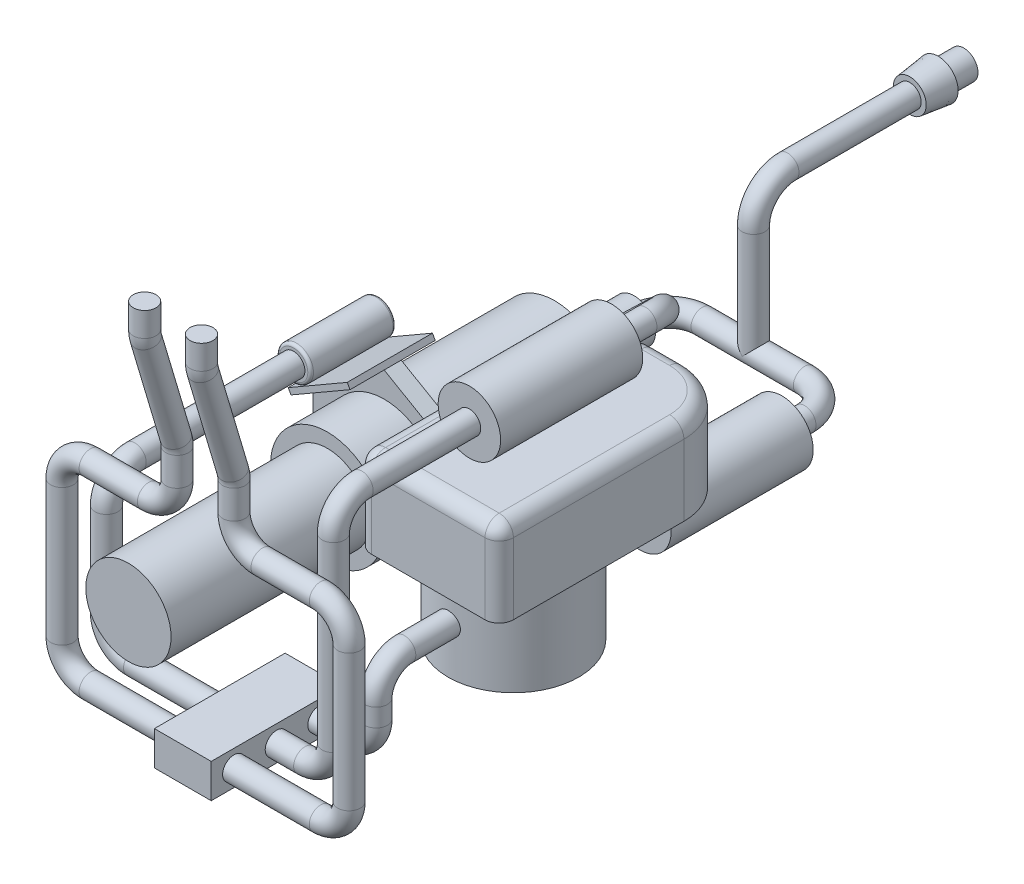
ISO-10303-21;
HEADER;
FILE_DESCRIPTION(('STEP AP214'),'2;1');
FILE_NAME('part.step','',(''),(''),'','','');
FILE_SCHEMA(('AUTOMOTIVE_DESIGN { 1 0 10303 214 1 1 1 1 }'));
ENDSEC;
DATA;
#1=APPLICATION_CONTEXT('core data for automotive mechanical design processes');
#2=APPLICATION_PROTOCOL_DEFINITION('international standard','automotive_design',2000,#1);
#3=PRODUCT_CONTEXT('',#1,'mechanical');
#4=PRODUCT('Part','Part','',(#3));
#5=PRODUCT_RELATED_PRODUCT_CATEGORY('part','',(#4));
#6=PRODUCT_DEFINITION_FORMATION('','',#4);
#7=PRODUCT_DEFINITION_CONTEXT('part definition',#1,'design');
#8=PRODUCT_DEFINITION('design','',#6,#7);
#9=PRODUCT_DEFINITION_SHAPE('','',#8);
#10=(LENGTH_UNIT() NAMED_UNIT(*) SI_UNIT(.MILLI.,.METRE.));
#11=(NAMED_UNIT(*) PLANE_ANGLE_UNIT() SI_UNIT($,.RADIAN.));
#12=(NAMED_UNIT(*) SI_UNIT($,.STERADIAN.) SOLID_ANGLE_UNIT());
#13=UNCERTAINTY_MEASURE_WITH_UNIT(LENGTH_MEASURE(1.E-05),#10,'distance_accuracy_value','');
#14=(GEOMETRIC_REPRESENTATION_CONTEXT(3) GLOBAL_UNCERTAINTY_ASSIGNED_CONTEXT((#13)) GLOBAL_UNIT_ASSIGNED_CONTEXT((#10,
#11,#12)) REPRESENTATION_CONTEXT('',''));
#15=CARTESIAN_POINT('',(0.,0.,0.));
#16=DIRECTION('',(0.,0.,1.));
#17=DIRECTION('',(1.,0.,0.));
#18=AXIS2_PLACEMENT_3D('',#15,#16,#17);
#19=CARTESIAN_POINT('',(0.,0.,-108.));
#20=DIRECTION('',(0.,0.,1.));
#21=DIRECTION('',(1.,0.,0.));
#22=AXIS2_PLACEMENT_3D('',#19,#20,#21);
#23=CYLINDRICAL_SURFACE('',#22,7.5);
#24=CARTESIAN_POINT('',(0.,0.,-108.));
#25=DIRECTION('',(0.,0.,-1.));
#26=DIRECTION('',(-1.,0.,0.));
#27=AXIS2_PLACEMENT_3D('',#24,#25,#26);
#28=CIRCLE('',#27,7.5);
#29=CARTESIAN_POINT('',(-7.5,0.,-108.));
#30=VERTEX_POINT('',#29);
#31=EDGE_CURVE('E11',#30,#30,#28,.T.);
#32=ORIENTED_EDGE('',*,*,#31,.F.);
#33=EDGE_LOOP('',(#32));
#34=FACE_BOUND('',#33,.T.);
#35=CARTESIAN_POINT('',(0.,0.,-88.));
#36=DIRECTION('',(0.,0.,-1.));
#37=DIRECTION('',(-1.,0.,0.));
#38=AXIS2_PLACEMENT_3D('',#35,#36,#37);
#39=CIRCLE('',#38,7.5);
#40=CARTESIAN_POINT('',(-7.5,0.,-88.));
#41=VERTEX_POINT('',#40);
#42=EDGE_CURVE('E43',#41,#41,#39,.T.);
#43=ORIENTED_EDGE('',*,*,#42,.T.);
#44=EDGE_LOOP('',(#43));
#45=FACE_BOUND('',#44,.T.);
#46=ADVANCED_FACE('F40',(#34,#45),#23,.T.);
#47=CARTESIAN_POINT('',(0.,0.,-108.));
#48=DIRECTION('',(0.,0.,-1.));
#49=DIRECTION('',(-1.,0.,0.));
#50=AXIS2_PLACEMENT_3D('',#47,#48,#49);
#51=PLANE('',#50);
#52=ORIENTED_EDGE('',*,*,#31,.T.);
#53=EDGE_LOOP('',(#52));
#54=FACE_BOUND('',#53,.T.);
#55=ADVANCED_FACE('F55',(#54),#51,.T.);
#56=CARTESIAN_POINT('',(0.,0.,-88.));
#57=DIRECTION('',(0.,0.,-1.));
#58=DIRECTION('',(-1.,0.,0.));
#59=AXIS2_PLACEMENT_3D('',#56,#57,#58);
#60=PLANE('',#59);
#61=ORIENTED_EDGE('',*,*,#42,.F.);
#62=EDGE_LOOP('',(#61));
#63=FACE_BOUND('',#62,.T.);
#64=ADVANCED_FACE('F53',(#63),#60,.F.);
#65=CLOSED_SHELL('',(#46,#55,#64));
#66=MANIFOLD_SOLID_BREP('B2',#65);
#67=CARTESIAN_POINT('',(60.,0.,-50.));
#68=DIRECTION('',(0.,0.,-1.));
#69=DIRECTION('',(-1.,0.,0.));
#70=AXIS2_PLACEMENT_3D('',#67,#68,#69);
#71=CYLINDRICAL_SURFACE('',#70,11.);
#72=CARTESIAN_POINT('',(60.,0.,-50.));
#73=DIRECTION('',(0.,0.,-1.));
#74=DIRECTION('',(-1.,0.,0.));
#75=AXIS2_PLACEMENT_3D('',#72,#73,#74);
#76=CIRCLE('',#75,11.);
#77=CARTESIAN_POINT('',(49.,0.,-50.));
#78=VERTEX_POINT('',#77);
#79=EDGE_CURVE('E39',#78,#78,#76,.T.);
#80=ORIENTED_EDGE('',*,*,#79,.T.);
#81=EDGE_LOOP('',(#80));
#82=FACE_BOUND('',#81,.T.);
#83=CARTESIAN_POINT('',(60.,0.,-100.));
#84=DIRECTION('',(0.,0.,-1.));
#85=DIRECTION('',(-1.,0.,0.));
#86=AXIS2_PLACEMENT_3D('',#83,#84,#85);
#87=CIRCLE('',#86,11.);
#88=CARTESIAN_POINT('',(49.,0.,-100.));
#89=VERTEX_POINT('',#88);
#90=EDGE_CURVE('E96',#89,#89,#87,.T.);
#91=ORIENTED_EDGE('',*,*,#90,.F.);
#92=EDGE_LOOP('',(#91));
#93=FACE_BOUND('',#92,.T.);
#94=ADVANCED_FACE('F90',(#82,#93),#71,.T.);
#95=CARTESIAN_POINT('',(60.,0.,-50.));
#96=DIRECTION('',(0.,0.,-1.));
#97=DIRECTION('',(-1.,0.,0.));
#98=AXIS2_PLACEMENT_3D('',#95,#96,#97);
#99=PLANE('',#98);
#100=ORIENTED_EDGE('',*,*,#79,.F.);
#101=EDGE_LOOP('',(#100));
#102=FACE_BOUND('',#101,.T.);
#103=ADVANCED_FACE('F105',(#102),#99,.F.);
#104=CARTESIAN_POINT('',(60.,0.,-100.));
#105=DIRECTION('',(0.,0.,-1.));
#106=DIRECTION('',(-1.,0.,0.));
#107=AXIS2_PLACEMENT_3D('',#104,#105,#106);
#108=PLANE('',#107);
#109=ORIENTED_EDGE('',*,*,#90,.T.);
#110=EDGE_LOOP('',(#109));
#111=FACE_BOUND('',#110,.T.);
#112=ADVANCED_FACE('F102',(#111),#108,.T.);
#113=CLOSED_SHELL('',(#94,#103,#112));
#114=MANIFOLD_SOLID_BREP('B6',#113);
#115=CARTESIAN_POINT('',(30.,50.,-185.));
#116=DIRECTION('',(0.,0.,-1.));
#117=DIRECTION('',(0.,1.,0.));
#118=AXIS2_PLACEMENT_3D('',#115,#116,#117);
#119=PLANE('',#118);
#120=CARTESIAN_POINT('',(30.,50.,-185.));
#121=DIRECTION('',(0.,0.,-1.));
#122=DIRECTION('',(0.,1.,0.));
#123=AXIS2_PLACEMENT_3D('',#120,#121,#122);
#124=CIRCLE('',#123,7.);
#125=CARTESIAN_POINT('',(30.,57.,-185.));
#126=VERTEX_POINT('',#125);
#127=EDGE_CURVE('E1783',#126,#126,#124,.T.);
#128=ORIENTED_EDGE('',*,*,#127,.T.);
#129=EDGE_LOOP('',(#128));
#130=FACE_BOUND('',#129,.T.);
#131=CARTESIAN_POINT('',(30.,50.,-185.));
#132=DIRECTION('',(0.,0.,-1.));
#133=DIRECTION('',(0.,1.,0.));
#134=AXIS2_PLACEMENT_3D('',#131,#132,#133);
#135=CIRCLE('',#134,5.);
#136=CARTESIAN_POINT('',(30.,55.,-185.));
#137=VERTEX_POINT('',#136);
#138=EDGE_CURVE('E1784',#137,#137,#135,.T.);
#139=ORIENTED_EDGE('',*,*,#138,.F.);
#140=EDGE_LOOP('',(#139));
#141=FACE_BOUND('',#140,.T.);
#142=ADVANCED_FACE('F133',(#130,#141),#119,.T.);
#143=CARTESIAN_POINT('',(30.,50.,-132.));
#144=DIRECTION('',(0.,0.,-1.));
#145=DIRECTION('',(-1.,0.,0.));
#146=AXIS2_PLACEMENT_3D('',#143,#144,#145);
#147=CYLINDRICAL_SURFACE('',#146,4.00000000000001);
#148=CARTESIAN_POINT('',(30.,50.,-132.));
#149=DIRECTION('',(0.,0.,-1.));
#150=DIRECTION('',(0.,1.,0.));
#151=AXIS2_PLACEMENT_3D('',#148,#149,#150);
#152=CIRCLE('',#151,4.00000000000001);
#153=CARTESIAN_POINT('',(30.,54.,-132.));
#154=VERTEX_POINT('',#153);
#155=EDGE_CURVE('E548',#154,#154,#152,.T.);
#156=ORIENTED_EDGE('',*,*,#155,.T.);
#157=EDGE_LOOP('',(#156));
#158=FACE_BOUND('',#157,.T.);
#159=CARTESIAN_POINT('',(30.,50.,-175.));
#160=DIRECTION('',(0.,0.,-1.));
#161=DIRECTION('',(0.,1.,0.));
#162=AXIS2_PLACEMENT_3D('',#159,#160,#161);
#163=CIRCLE('',#162,4.00000000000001);
#164=CARTESIAN_POINT('',(30.,54.,-175.));
#165=VERTEX_POINT('',#164);
#166=EDGE_CURVE('E137',#165,#165,#163,.F.);
#167=ORIENTED_EDGE('',*,*,#166,.T.);
#168=EDGE_LOOP('',(#167));
#169=FACE_BOUND('',#168,.T.);
#170=ADVANCED_FACE('F782',(#158,#169),#147,.T.);
#171=CARTESIAN_POINT('',(0.,28.8675134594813,-26.));
#172=DIRECTION('',(-0.5,0.866025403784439,0.));
#173=DIRECTION('',(-0.866025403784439,-0.5,0.));
#174=AXIS2_PLACEMENT_3D('',#171,#172,#173);
#175=PLANE('',#174);
#176=DIRECTION('',(-0.866025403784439,-0.5,0.));
#177=VECTOR('',#176,1.);
#178=CARTESIAN_POINT('',(0.,28.8675134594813,-20.));
#179=LINE('',#178,#177);
#180=CARTESIAN_POINT('',(-20.7846096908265,16.8675134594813,-20.));
#181=VERTEX_POINT('',#180);
#182=CARTESIAN_POINT('',(-25.,14.4337567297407,-20.));
#183=VERTEX_POINT('',#182);
#184=EDGE_CURVE('E370',#181,#183,#179,.T.);
#185=ORIENTED_EDGE('',*,*,#184,.F.);
#186=DIRECTION('',(0.,0.,1.));
#187=VECTOR('',#186,1.);
#188=CARTESIAN_POINT('',(-20.7846096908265,16.8675134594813,-38.));
#189=LINE('',#188,#187);
#190=CARTESIAN_POINT('',(-20.7846096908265,16.8675134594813,-26.));
#191=VERTEX_POINT('',#190);
#192=EDGE_CURVE('E149',#191,#181,#189,.T.);
#193=ORIENTED_EDGE('',*,*,#192,.F.);
#194=DIRECTION('',(-0.866025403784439,-0.5,0.));
#195=VECTOR('',#194,1.);
#196=CARTESIAN_POINT('',(0.,28.8675134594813,-26.));
#197=LINE('',#196,#195);
#198=CARTESIAN_POINT('',(-25.,14.4337567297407,-26.));
#199=VERTEX_POINT('',#198);
#200=EDGE_CURVE('E351',#191,#199,#197,.T.);
#201=ORIENTED_EDGE('',*,*,#200,.T.);
#202=DIRECTION('',(0.,0.,1.));
#203=VECTOR('',#202,1.);
#204=CARTESIAN_POINT('',(-25.,14.4337567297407,-26.));
#205=LINE('',#204,#203);
#206=EDGE_CURVE('E394',#199,#183,#205,.T.);
#207=ORIENTED_EDGE('',*,*,#206,.T.);
#208=EDGE_LOOP('',(#185,#193,#201,#207));
#209=FACE_BOUND('',#208,.T.);
#210=ADVANCED_FACE('F792',(#209),#175,.T.);
#211=CARTESIAN_POINT('',(0.,0.,-80.));
#212=DIRECTION('',(0.,0.,1.));
#213=DIRECTION('',(1.,0.,0.));
#214=AXIS2_PLACEMENT_3D('',#211,#212,#213);
#215=CYLINDRICAL_SURFACE('',#214,20.);
#216=CARTESIAN_POINT('',(16.869325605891,10.7436424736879,-64.));
#217=CARTESIAN_POINT('',(16.8693230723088,10.7436514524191,-64.2222575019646));
#218=CARTESIAN_POINT('',(16.8591552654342,10.7596631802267,-64.4446184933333));
#219=CARTESIAN_POINT('',(16.8185555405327,10.8230103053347,-64.8830500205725));
#220=CARTESIAN_POINT('',(16.7881074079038,10.8703707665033,-65.0991153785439));
#221=CARTESIAN_POINT('',(16.7072517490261,10.9942333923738,-65.5185492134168));
#222=CARTESIAN_POINT('',(16.6568640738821,11.0707065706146,-65.7219300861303));
#223=CARTESIAN_POINT('',(16.536594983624,11.249559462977,-66.1106993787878));
#224=CARTESIAN_POINT('',(16.466714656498,11.3519377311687,-66.2960888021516));
#225=CARTESIAN_POINT('',(16.3071340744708,11.5800233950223,-66.6462440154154));
#226=CARTESIAN_POINT('',(16.2171936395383,11.7060102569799,-66.8107183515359));
#227=CARTESIAN_POINT('',(16.0190743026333,11.9756921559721,-67.1118301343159));
#228=CARTESIAN_POINT('',(15.9108941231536,12.1193884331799,-67.2484656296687));
#229=CARTESIAN_POINT('',(15.6768530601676,12.420665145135,-67.4911520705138));
#230=CARTESIAN_POINT('',(15.5508462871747,12.5783556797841,-67.5969260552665));
#231=CARTESIAN_POINT('',(15.2842396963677,12.9009981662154,-67.7730997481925));
#232=CARTESIAN_POINT('',(15.1436412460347,13.0659494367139,-67.8435027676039));
#233=CARTESIAN_POINT('',(14.8530135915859,13.39535641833,-67.9460287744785));
#234=CARTESIAN_POINT('',(14.7031330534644,13.5597900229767,-67.978643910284));
#235=CARTESIAN_POINT('',(14.3962769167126,13.8851428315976,-68.0062038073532));
#236=CARTESIAN_POINT('',(14.2393020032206,14.0460623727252,-68.0011521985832));
#237=CARTESIAN_POINT('',(13.9251763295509,14.3574967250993,-67.9538952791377));
#238=CARTESIAN_POINT('',(13.7680599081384,14.5081270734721,-67.9122200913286));
#239=CARTESIAN_POINT('',(13.4563406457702,14.7977087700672,-67.7937398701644));
#240=CARTESIAN_POINT('',(13.3017379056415,14.9366596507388,-67.7169334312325));
#241=CARTESIAN_POINT('',(12.9991396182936,15.2007563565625,-67.5298798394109));
#242=CARTESIAN_POINT('',(12.8511918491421,15.3258096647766,-67.4194249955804));
#243=CARTESIAN_POINT('',(12.5680025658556,15.5588880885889,-67.1683636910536));
#244=CARTESIAN_POINT('',(12.4327625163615,15.6669112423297,-67.0277537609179));
#245=CARTESIAN_POINT('',(12.1776209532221,15.8660720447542,-66.7174655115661));
#246=CARTESIAN_POINT('',(12.0580278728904,15.9568825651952,-66.5473232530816));
#247=CARTESIAN_POINT('',(11.8416939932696,16.1180811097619,-66.1843342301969));
#248=CARTESIAN_POINT('',(11.7449536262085,16.1884687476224,-65.9914870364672));
#249=CARTESIAN_POINT('',(11.578214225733,16.3081440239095,-65.5879166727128));
#250=CARTESIAN_POINT('',(11.5082728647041,16.3573861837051,-65.3771561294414));
#251=CARTESIAN_POINT('',(11.3986138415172,16.4339928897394,-64.9441147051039));
#252=CARTESIAN_POINT('',(11.3588922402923,16.4613602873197,-64.7218353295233));
#253=CARTESIAN_POINT('',(11.3119715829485,16.4936383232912,-64.2761405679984));
#254=CARTESIAN_POINT('',(11.3042276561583,16.4989252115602,-64.0528097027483));
#255=CARTESIAN_POINT('',(11.3201320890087,16.4880168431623,-63.6078071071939));
#256=CARTESIAN_POINT('',(11.3437786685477,16.4718228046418,-63.3861352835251));
#257=CARTESIAN_POINT('',(11.4209679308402,16.418393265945,-62.952925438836));
#258=CARTESIAN_POINT('',(11.4742217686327,16.381361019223,-62.7413106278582));
#259=CARTESIAN_POINT('',(11.6080536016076,16.2867972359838,-62.3317468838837));
#260=CARTESIAN_POINT('',(11.6886338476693,16.2292640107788,-62.1337990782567));
#261=CARTESIAN_POINT('',(11.874975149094,16.0934266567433,-61.7543475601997));
#262=CARTESIAN_POINT('',(11.9810507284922,16.014861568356,-61.5730918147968));
#263=CARTESIAN_POINT('',(12.2135941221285,15.838225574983,-61.2347667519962));
#264=CARTESIAN_POINT('',(12.3400640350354,15.7401526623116,-61.0776999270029));
#265=CARTESIAN_POINT('',(12.6107558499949,15.5241495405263,-60.7897497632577));
#266=CARTESIAN_POINT('',(12.7552204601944,15.4059376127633,-60.6593053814));
#267=CARTESIAN_POINT('',(13.0550428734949,15.1526995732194,-60.4314164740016));
#268=CARTESIAN_POINT('',(13.2104002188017,15.0176741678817,-60.3339705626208));
#269=CARTESIAN_POINT('',(13.5256486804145,14.734362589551,-60.1754845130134));
#270=CARTESIAN_POINT('',(13.68550853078,14.5861572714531,-60.1142379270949));
#271=CARTESIAN_POINT('',(14.0052681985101,14.2794084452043,-60.0292350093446));
#272=CARTESIAN_POINT('',(14.1651680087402,14.1208661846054,-60.0054741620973));
#273=CARTESIAN_POINT('',(14.4772504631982,13.8006645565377,-59.9962920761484));
#274=CARTESIAN_POINT('',(14.6295189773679,13.6391074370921,-60.0102108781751));
#275=CARTESIAN_POINT('',(14.9250648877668,13.3150494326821,-60.0745358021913));
#276=CARTESIAN_POINT('',(15.0683423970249,13.15254855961,-60.1249414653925));
#277=CARTESIAN_POINT('',(15.3421554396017,12.8320934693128,-60.2605159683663));
#278=CARTESIAN_POINT('',(15.4727192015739,12.6741297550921,-60.3456055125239));
#279=CARTESIAN_POINT('',(15.7188912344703,12.3675043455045,-60.5480489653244));
#280=CARTESIAN_POINT('',(15.8344983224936,12.218843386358,-60.665405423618));
#281=CARTESIAN_POINT('',(16.0506325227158,11.9335569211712,-60.9312775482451));
#282=CARTESIAN_POINT('',(16.1508862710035,11.797164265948,-61.0802653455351));
#283=CARTESIAN_POINT('',(16.3327281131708,11.5441038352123,-61.404200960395));
#284=CARTESIAN_POINT('',(16.4143117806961,11.4274407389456,-61.5791549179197));
#285=CARTESIAN_POINT('',(16.55867398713,11.2172542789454,-61.9523172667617));
#286=CARTESIAN_POINT('',(16.6212405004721,11.1239937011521,-62.150755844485));
#287=CARTESIAN_POINT('',(16.725708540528,10.9662980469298,-62.5637310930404));
#288=CARTESIAN_POINT('',(16.7676288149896,10.9018368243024,-62.7782529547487));
#289=CARTESIAN_POINT('',(16.8224403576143,10.8169915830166,-63.1610498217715));
#290=CARTESIAN_POINT('',(16.8400113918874,10.7895547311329,-63.3271416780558));
#291=CARTESIAN_POINT('',(16.8634547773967,10.7528770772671,-63.6621358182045));
#292=CARTESIAN_POINT('',(16.8693275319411,10.7436356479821,-63.8310380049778));
#293=CARTESIAN_POINT('',(16.869325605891,10.7436424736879,-64.));
#294=B_SPLINE_CURVE_WITH_KNOTS('',3,(#216,#217,#218,#219,#220,#221,#222,#223,#224,#225,#226,
#227,#228,#229,#230,#231,#232,#233,#234,#235,#236,#237,#238,#239,#240,#241,#242,#243,#244,#245,
#246,#247,#248,#249,#250,#251,#252,#253,#254,#255,#256,#257,#258,#259,#260,#261,#262,#263,#264,
#265,#266,#267,#268,#269,#270,#271,#272,#273,#274,#275,#276,#277,#278,#279,#280,#281,#282,#283,
#284,#285,#286,#287,#288,#289,#290,#291,#292,#293),.UNSPECIFIED.,.T.,.F.,(4,2,2,2,2,2,2,2,2,2,2,
2,2,2,2,2,2,2,2,2,2,2,2,2,2,2,2,2,2,2,2,2,2,2,2,2,2,2,4),(0.,0.66615385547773,1.33284095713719,
1.99886599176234,2.66485385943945,3.33929010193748,4.01377360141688,4.69413601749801,
5.37443472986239,6.04576995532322,6.71704048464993,7.37875158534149,8.04048916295,
8.70639696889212,9.37238143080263,10.0499738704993,10.7275791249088,11.406634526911,
12.085601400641,12.7529503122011,13.4202613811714,14.0811736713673,14.7421404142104,
15.4117223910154,16.0813733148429,16.7613040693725,17.4412062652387,18.1171925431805,
18.7930973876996,19.457240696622,20.1213756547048,20.7840006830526,21.4466780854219,
22.1200460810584,22.7935735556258,23.4743559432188,24.1545190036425,24.660952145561,
25.1673678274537),.UNSPECIFIED.);
#295=CARTESIAN_POINT('',(16.869325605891,10.7436424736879,-64.));
#296=VERTEX_POINT('',#295);
#297=EDGE_CURVE('E677',#296,#296,#294,.T.);
#298=ORIENTED_EDGE('',*,*,#297,.F.);
#299=EDGE_LOOP('',(#298));
#300=FACE_BOUND('',#299,.T.);
#301=CARTESIAN_POINT('',(0.,0.,-80.));
#302=DIRECTION('',(0.,0.,-1.));
#303=DIRECTION('',(-1.,0.,0.));
#304=AXIS2_PLACEMENT_3D('',#301,#302,#303);
#305=CIRCLE('',#304,20.);
#306=CARTESIAN_POINT('',(-20.,0.,-80.));
#307=VERTEX_POINT('',#306);
#308=EDGE_CURVE('E666',#307,#307,#305,.T.);
#309=ORIENTED_EDGE('',*,*,#308,.F.);
#310=EDGE_LOOP('',(#309));
#311=FACE_BOUND('',#310,.T.);
#312=CARTESIAN_POINT('',(0.,0.,-26.));
#313=DIRECTION('',(0.,0.,1.));
#314=DIRECTION('',(1.,0.,0.));
#315=AXIS2_PLACEMENT_3D('',#312,#313,#314);
#316=CIRCLE('',#315,20.);
#317=CARTESIAN_POINT('',(20.,0.,-26.));
#318=VERTEX_POINT('',#317);
#319=EDGE_CURVE('E88',#318,#318,#316,.T.);
#320=ORIENTED_EDGE('',*,*,#319,.F.);
#321=EDGE_LOOP('',(#320));
#322=FACE_BOUND('',#321,.T.);
#323=ADVANCED_FACE('F916',(#300,#311,#322),#215,.T.);
#324=CARTESIAN_POINT('',(12.,0.,-120.));
#325=DIRECTION('',(1.,0.,0.));
#326=DIRECTION('',(0.,0.,-1.));
#327=AXIS2_PLACEMENT_3D('',#324,#325,#326);
#328=CYLINDRICAL_SURFACE('',#327,4.);
#329=CARTESIAN_POINT('',(48.,0.,-120.));
#330=DIRECTION('',(1.,0.,0.));
#331=DIRECTION('',(0.,0.,-1.));
#332=AXIS2_PLACEMENT_3D('',#329,#330,#331);
#333=CIRCLE('',#332,4.);
#334=CARTESIAN_POINT('',(48.,0.,-124.));
#335=VERTEX_POINT('',#334);
#336=EDGE_CURVE('E659',#335,#335,#333,.T.);
#337=ORIENTED_EDGE('',*,*,#336,.F.);
#338=EDGE_LOOP('',(#337));
#339=FACE_BOUND('',#338,.T.);
#340=CARTESIAN_POINT('',(12.,0.,-120.));
#341=DIRECTION('',(1.,0.,0.));
#342=DIRECTION('',(0.,0.,-1.));
#343=AXIS2_PLACEMENT_3D('',#340,#341,#342);
#344=CIRCLE('',#343,4.);
#345=CARTESIAN_POINT('',(12.,0.,-124.));
#346=VERTEX_POINT('',#345);
#347=EDGE_CURVE('E653',#346,#346,#344,.T.);
#348=ORIENTED_EDGE('',*,*,#347,.T.);
#349=EDGE_LOOP('',(#348));
#350=FACE_BOUND('',#349,.T.);
#351=CARTESIAN_POINT('',(30.,0.,-120.));
#352=DIRECTION('',(0.707106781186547,0.707106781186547,0.));
#353=DIRECTION('',(0.707106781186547,-0.707106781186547,0.));
#354=AXIS2_PLACEMENT_3D('',#351,#352,#353);
#355=ELLIPSE('',#354,5.65685424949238,4.);
#356=CARTESIAN_POINT('',(30.,0.,-116.));
#357=VERTEX_POINT('',#356);
#358=CARTESIAN_POINT('',(30.,0.,-124.));
#359=VERTEX_POINT('',#358);
#360=EDGE_CURVE('E1950',#357,#359,#355,.F.);
#361=ORIENTED_EDGE('',*,*,#360,.T.);
#362=CARTESIAN_POINT('',(30.,0.,-120.));
#363=DIRECTION('',(0.707106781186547,-0.707106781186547,0.));
#364=DIRECTION('',(0.707106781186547,0.707106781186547,0.));
#365=AXIS2_PLACEMENT_3D('',#362,#363,#364);
#366=ELLIPSE('',#365,5.65685424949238,4.);
#367=EDGE_CURVE('E142',#359,#357,#366,.T.);
#368=ORIENTED_EDGE('',*,*,#367,.T.);
#369=EDGE_LOOP('',(#361,#368));
#370=FACE_BOUND('',#369,.T.);
#371=ADVANCED_FACE('F913',(#339,#350,#370),#328,.T.);
#372=CARTESIAN_POINT('',(51.3721394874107,49.6597348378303,-64.));
#373=DIRECTION('',(-0.718988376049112,-0.695022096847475,0.));
#374=DIRECTION('',(0.695022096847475,-0.718988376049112,0.));
#375=AXIS2_PLACEMENT_3D('',#372,#373,#374);
#376=CYLINDRICAL_SURFACE('',#375,4.);
#377=CARTESIAN_POINT('',(51.3721394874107,49.6597348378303,-64.));
#378=DIRECTION('',(-0.718988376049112,-0.695022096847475,0.));
#379=DIRECTION('',(-0.483055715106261,0.499712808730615,0.718988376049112));
#380=AXIS2_PLACEMENT_3D('',#377,#378,#379);
#381=CIRCLE('',#380,4.);
#382=CARTESIAN_POINT('',(51.3721394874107,49.6597348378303,-68.));
#383=VERTEX_POINT('',#382);
#384=EDGE_CURVE('E1984',#383,#383,#381,.T.);
#385=ORIENTED_EDGE('',*,*,#384,.T.);
#386=EDGE_LOOP('',(#385));
#387=FACE_BOUND('',#386,.T.);
#388=ORIENTED_EDGE('',*,*,#297,.T.);
#389=EDGE_LOOP('',(#388));
#390=FACE_BOUND('',#389,.T.);
#391=ADVANCED_FACE('F915',(#387,#390),#376,.T.);
#392=CARTESIAN_POINT('',(60.,58.,-40.));
#393=DIRECTION('',(0.,0.,-1.));
#394=DIRECTION('',(-1.,0.,0.));
#395=AXIS2_PLACEMENT_3D('',#392,#393,#394);
#396=PLANE('',#395);
#397=CARTESIAN_POINT('',(60.,58.,-40.));
#398=DIRECTION('',(0.,0.,-1.));
#399=DIRECTION('',(-1.,0.,0.));
#400=AXIS2_PLACEMENT_3D('',#397,#398,#399);
#401=CIRCLE('',#400,11.);
#402=CARTESIAN_POINT('',(49.,58.,-40.));
#403=VERTEX_POINT('',#402);
#404=EDGE_CURVE('E1948',#403,#403,#401,.T.);
#405=ORIENTED_EDGE('',*,*,#404,.T.);
#406=EDGE_LOOP('',(#405));
#407=FACE_BOUND('',#406,.T.);
#408=CARTESIAN_POINT('',(60.,58.,-40.));
#409=DIRECTION('',(0.,0.,-1.));
#410=DIRECTION('',(-1.,0.,0.));
#411=AXIS2_PLACEMENT_3D('',#408,#409,#410);
#412=CIRCLE('',#411,4.);
#413=CARTESIAN_POINT('',(56.,58.,-40.));
#414=VERTEX_POINT('',#413);
#415=EDGE_CURVE('E1947',#414,#414,#412,.T.);
#416=ORIENTED_EDGE('',*,*,#415,.F.);
#417=EDGE_LOOP('',(#416));
#418=FACE_BOUND('',#417,.T.);
#419=ADVANCED_FACE('F1909',(#407,#418),#396,.T.);
#420=CARTESIAN_POINT('',(60.,58.,10.));
#421=DIRECTION('',(0.,0.,-1.));
#422=DIRECTION('',(-1.,0.,0.));
#423=AXIS2_PLACEMENT_3D('',#420,#421,#422);
#424=CYLINDRICAL_SURFACE('',#423,11.);
#425=CARTESIAN_POINT('',(60.,58.,10.));
#426=DIRECTION('',(0.,0.,-1.));
#427=DIRECTION('',(-1.,0.,0.));
#428=AXIS2_PLACEMENT_3D('',#425,#426,#427);
#429=CIRCLE('',#428,11.);
#430=CARTESIAN_POINT('',(49.,58.,10.));
#431=VERTEX_POINT('',#430);
#432=EDGE_CURVE('E1978',#431,#431,#429,.T.);
#433=ORIENTED_EDGE('',*,*,#432,.T.);
#434=EDGE_LOOP('',(#433));
#435=FACE_BOUND('',#434,.T.);
#436=ORIENTED_EDGE('',*,*,#404,.F.);
#437=EDGE_LOOP('',(#436));
#438=FACE_BOUND('',#437,.T.);
#439=ADVANCED_FACE('F135',(#435,#438),#424,.T.);
#440=CARTESIAN_POINT('',(60.,58.,10.));
#441=DIRECTION('',(0.,0.,-1.));
#442=DIRECTION('',(-1.,0.,0.));
#443=AXIS2_PLACEMENT_3D('',#440,#441,#442);
#444=PLANE('',#443);
#445=CARTESIAN_POINT('',(60.,58.,10.));
#446=DIRECTION('',(0.,0.,-1.));
#447=DIRECTION('',(0.,-1.,0.));
#448=AXIS2_PLACEMENT_3D('',#445,#446,#447);
#449=CIRCLE('',#448,4.00000000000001);
#450=CARTESIAN_POINT('',(60.,54.,10.));
#451=VERTEX_POINT('',#450);
#452=EDGE_CURVE('E542',#451,#451,#449,.T.);
#453=ORIENTED_EDGE('',*,*,#452,.T.);
#454=EDGE_LOOP('',(#453));
#455=FACE_BOUND('',#454,.T.);
#456=ORIENTED_EDGE('',*,*,#432,.F.);
#457=EDGE_LOOP('',(#456));
#458=FACE_BOUND('',#457,.T.);
#459=ADVANCED_FACE('F1075',(#455,#458),#444,.F.);
#460=CARTESIAN_POINT('',(51.3721394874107,49.6597348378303,-52.));
#461=DIRECTION('',(-0.695022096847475,0.718988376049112,0.));
#462=DIRECTION('',(-0.718988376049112,-0.695022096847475,0.));
#463=AXIS2_PLACEMENT_3D('',#460,#461,#462);
#464=TOROIDAL_SURFACE('',#463,12.,4.);
#465=CARTESIAN_POINT('',(60.,58.,-52.));
#466=DIRECTION('',(0.,0.,-1.));
#467=DIRECTION('',(-1.,0.,0.));
#468=AXIS2_PLACEMENT_3D('',#465,#466,#467);
#469=CIRCLE('',#468,4.);
#470=CARTESIAN_POINT('',(62.8759535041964,60.7800883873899,-52.));
#471=VERTEX_POINT('',#470);
#472=EDGE_CURVE('E684',#471,#471,#469,.T.);
#473=CARTESIAN_POINT('',(51.3721394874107,49.6597348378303,-52.));
#474=DIRECTION('',(-0.695022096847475,0.718988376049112,0.));
#475=DIRECTION('',(-0.718988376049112,-0.695022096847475,0.));
#476=AXIS2_PLACEMENT_3D('',#473,#474,#475);
#477=CIRCLE('',#476,16.);
#478=EDGE_CURVE('',#471,#383,#477,.T.);
#479=ORIENTED_EDGE('',*,*,#472,.T.);
#480=ORIENTED_EDGE('',*,*,#384,.F.);
#481=ORIENTED_EDGE('',*,*,#478,.T.);
#482=ORIENTED_EDGE('',*,*,#478,.F.);
#483=EDGE_LOOP('',(#479,#481,#480,#482));
#484=FACE_BOUND('',#483,.T.);
#485=ADVANCED_FACE('F1080',(#484),#464,.T.);
#486=CARTESIAN_POINT('',(60.,58.,-52.));
#487=DIRECTION('',(0.,0.,1.));
#488=DIRECTION('',(1.,0.,0.));
#489=AXIS2_PLACEMENT_3D('',#486,#487,#488);
#490=CYLINDRICAL_SURFACE('',#489,4.);
#491=ORIENTED_EDGE('',*,*,#472,.F.);
#492=EDGE_LOOP('',(#491));
#493=FACE_BOUND('',#492,.T.);
#494=ORIENTED_EDGE('',*,*,#415,.T.);
#495=EDGE_LOOP('',(#494));
#496=FACE_BOUND('',#495,.T.);
#497=ADVANCED_FACE('F931',(#493,#496),#490,.T.);
#498=CARTESIAN_POINT('',(60.,0.,-108.));
#499=DIRECTION('',(0.,0.,1.));
#500=DIRECTION('',(1.,0.,0.));
#501=AXIS2_PLACEMENT_3D('',#498,#499,#500);
#502=CYLINDRICAL_SURFACE('',#501,4.);
#503=CARTESIAN_POINT('',(60.,0.,-108.));
#504=DIRECTION('',(0.,0.,1.));
#505=DIRECTION('',(1.,0.,0.));
#506=AXIS2_PLACEMENT_3D('',#503,#504,#505);
#507=CIRCLE('',#506,4.);
#508=CARTESIAN_POINT('',(64.,0.,-108.));
#509=VERTEX_POINT('',#508);
#510=EDGE_CURVE('E662',#509,#509,#507,.T.);
#511=ORIENTED_EDGE('',*,*,#510,.T.);
#512=EDGE_LOOP('',(#511));
#513=FACE_BOUND('',#512,.T.);
#514=CARTESIAN_POINT('',(64.,0.,-28.1345856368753));
#515=CARTESIAN_POINT('',(63.999991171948,-0.222851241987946,-28.1345897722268));
#516=CARTESIAN_POINT('',(63.9813133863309,-0.445820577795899,-28.1379102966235));
#517=CARTESIAN_POINT('',(63.9071341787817,-0.885492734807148,-28.1508200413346));
#518=CARTESIAN_POINT('',(63.851599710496,-1.10218975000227,-28.1604148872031));
#519=CARTESIAN_POINT('',(63.7054467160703,-1.52289108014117,-28.1847544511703));
#520=CARTESIAN_POINT('',(63.6148586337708,-1.7269062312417,-28.1994946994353));
#521=CARTESIAN_POINT('',(63.4012473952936,-2.11682323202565,-28.2324589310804));
#522=CARTESIAN_POINT('',(63.2782275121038,-2.30272690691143,-28.2506825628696));
#523=CARTESIAN_POINT('',(63.0018380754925,-2.65315653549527,-28.2887785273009));
#524=CARTESIAN_POINT('',(62.8481884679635,-2.81746009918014,-28.3086650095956));
#525=CARTESIAN_POINT('',(62.515506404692,-3.11809188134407,-28.3477205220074));
#526=CARTESIAN_POINT('',(62.3364723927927,-3.25441838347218,-28.3668895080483));
#527=CARTESIAN_POINT('',(61.9566558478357,-3.49606692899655,-28.4025005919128));
#528=CARTESIAN_POINT('',(61.7557391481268,-3.60118106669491,-28.4189240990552));
#529=CARTESIAN_POINT('',(61.3387663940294,-3.77608370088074,-28.447035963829));
#530=CARTESIAN_POINT('',(61.1227114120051,-3.84587469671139,-28.458724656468));
#531=CARTESIAN_POINT('',(60.6838952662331,-3.94746717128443,-28.4759499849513));
#532=CARTESIAN_POINT('',(60.4612231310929,-3.97964276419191,-28.4815471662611));
#533=CARTESIAN_POINT('',(60.0135753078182,-4.00625520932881,-28.4861670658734));
#534=CARTESIAN_POINT('',(59.788599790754,-4.00069484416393,-28.4851902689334));
#535=CARTESIAN_POINT('',(59.3452919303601,-3.95228334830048,-28.4768199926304));
#536=CARTESIAN_POINT('',(59.1269141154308,-3.90983490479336,-28.4694958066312));
#537=CARTESIAN_POINT('',(58.700428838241,-3.78948723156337,-28.4493310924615));
#538=CARTESIAN_POINT('',(58.4923217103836,-3.71158684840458,-28.4364903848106));
#539=CARTESIAN_POINT('',(58.0910975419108,-3.52215196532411,-28.4066181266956));
#540=CARTESIAN_POINT('',(57.8980596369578,-3.4104532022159,-28.3895661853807));
#541=CARTESIAN_POINT('',(57.5333158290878,-3.15671284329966,-28.3531630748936));
#542=CARTESIAN_POINT('',(57.3616118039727,-3.01466857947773,-28.3338117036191));
#543=CARTESIAN_POINT('',(57.0420282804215,-2.70204062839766,-28.2946573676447));
#544=CARTESIAN_POINT('',(56.8944933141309,-2.53110485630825,-28.2748518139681));
#545=CARTESIAN_POINT('',(56.6301404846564,-2.16672789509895,-28.2372674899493));
#546=CARTESIAN_POINT('',(56.5133229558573,-1.9732864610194,-28.2194887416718));
#547=CARTESIAN_POINT('',(56.3136431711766,-1.56897060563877,-28.1879688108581));
#548=CARTESIAN_POINT('',(56.2308252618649,-1.35807384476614,-28.1742329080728));
#549=CARTESIAN_POINT('',(56.1018897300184,-0.925068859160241,-28.1524389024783));
#550=CARTESIAN_POINT('',(56.055768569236,-0.702961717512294,-28.1443802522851));
#551=CARTESIAN_POINT('',(56.002026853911,-0.256931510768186,-28.1349599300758));
#552=CARTESIAN_POINT('',(55.9939138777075,-0.0330695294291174,-28.1335126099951));
#553=CARTESIAN_POINT('',(56.0151039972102,0.412812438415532,-28.1372503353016));
#554=CARTESIAN_POINT('',(56.0444055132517,0.634832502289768,-28.1424351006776));
#555=CARTESIAN_POINT('',(56.1391720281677,1.06914585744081,-28.1587734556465));
#556=CARTESIAN_POINT('',(56.204383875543,1.28149609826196,-28.1698852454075));
#557=CARTESIAN_POINT('',(56.3688533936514,1.69225495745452,-28.1967902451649));
#558=CARTESIAN_POINT('',(56.4681132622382,1.89066267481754,-28.2125837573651));
#559=CARTESIAN_POINT('',(56.6990136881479,2.27008855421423,-28.2472703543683));
#560=CARTESIAN_POINT('',(56.8309683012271,2.45091285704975,-28.2661928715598));
#561=CARTESIAN_POINT('',(57.1230840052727,2.78802944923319,-28.3049204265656));
#562=CARTESIAN_POINT('',(57.2832472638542,2.94431985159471,-28.3247255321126));
#563=CARTESIAN_POINT('',(57.6294214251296,3.22974416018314,-28.3632590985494));
#564=CARTESIAN_POINT('',(57.8157057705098,3.35854873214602,-28.3819727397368));
#565=CARTESIAN_POINT('',(58.2075555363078,3.58303245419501,-28.415973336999));
#566=CARTESIAN_POINT('',(58.4131202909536,3.67871274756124,-28.4312604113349));
#567=CARTESIAN_POINT('',(58.8367403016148,3.83372589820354,-28.4566212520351));
#568=CARTESIAN_POINT('',(59.0547322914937,3.89322752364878,-28.466719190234));
#569=CARTESIAN_POINT('',(59.4978057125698,3.97473623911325,-28.4806665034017));
#570=CARTESIAN_POINT('',(59.7228865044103,3.99674670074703,-28.4845164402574));
#571=CARTESIAN_POINT('',(60.1705765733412,4.00254442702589,-28.485524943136));
#572=CARTESIAN_POINT('',(60.3931793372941,3.98683152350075,-28.4827710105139));
#573=CARTESIAN_POINT('',(60.8325231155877,3.91871421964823,-28.4710608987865));
#574=CARTESIAN_POINT('',(61.0492641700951,3.86631007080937,-28.4621047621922));
#575=CARTESIAN_POINT('',(61.4705164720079,3.72649610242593,-28.4389939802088));
#576=CARTESIAN_POINT('',(61.6750434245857,3.6391323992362,-28.4248461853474));
#577=CARTESIAN_POINT('',(62.0666123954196,3.43193624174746,-28.3928921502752));
#578=CARTESIAN_POINT('',(62.2536534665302,3.31210203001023,-28.3750857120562));
#579=CARTESIAN_POINT('',(62.6074503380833,3.04161163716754,-28.3375064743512));
#580=CARTESIAN_POINT('',(62.7739252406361,2.89059101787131,-28.3177119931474));
#581=CARTESIAN_POINT('',(63.0793452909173,2.56277712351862,-28.2785331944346));
#582=CARTESIAN_POINT('',(63.2182839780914,2.38597781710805,-28.2591489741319));
#583=CARTESIAN_POINT('',(63.4656896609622,2.0099861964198,-28.2228218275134));
#584=CARTESIAN_POINT('',(63.573911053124,1.81063029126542,-28.2058990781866));
#585=CARTESIAN_POINT('',(63.7551599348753,1.39634937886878,-28.1766506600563));
#586=CARTESIAN_POINT('',(63.8282219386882,1.18143987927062,-28.1643204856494));
#587=CARTESIAN_POINT('',(63.9215491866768,0.804798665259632,-28.1483335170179));
#588=CARTESIAN_POINT('',(63.9509199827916,0.64532366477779,-28.1432073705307));
#589=CARTESIAN_POINT('',(63.990148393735,0.32391987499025,-28.1363319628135));
#590=CARTESIAN_POINT('',(64.0000064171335,0.1619911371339,-28.1345826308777));
#591=CARTESIAN_POINT('',(64.,0.,-28.1345856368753));
#592=B_SPLINE_CURVE_WITH_KNOTS('',3,(#514,#515,#516,#517,#518,#519,#520,#521,#522,#523,#524,
#525,#526,#527,#528,#529,#530,#531,#532,#533,#534,#535,#536,#537,#538,#539,#540,#541,#542,#543,
#544,#545,#546,#547,#548,#549,#550,#551,#552,#553,#554,#555,#556,#557,#558,#559,#560,#561,#562,
#563,#564,#565,#566,#567,#568,#569,#570,#571,#572,#573,#574,#575,#576,#577,#578,#579,#580,#581,
#582,#583,#584,#585,#586,#587,#588,#589,#590,#591),.UNSPECIFIED.,.T.,.F.,(4,2,2,2,2,2,2,2,2,2,2,
2,2,2,2,2,2,2,2,2,2,2,2,2,2,2,2,2,2,2,2,2,2,2,2,2,2,2,4),(0.,0.667961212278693,1.33652214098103,
2.00450372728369,2.67241792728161,3.34674493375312,4.02111329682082,4.6998777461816,
5.37859416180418,6.05050119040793,6.72235867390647,7.38697269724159,8.05160834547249,
8.71952753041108,9.38750546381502,10.0643037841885,10.7411094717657,11.4187951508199,
12.096415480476,12.7652320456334,13.4340203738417,14.0981533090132,14.7623291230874,
15.4331505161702,16.104023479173,16.7825321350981,17.4610173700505,18.1363127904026,
18.8115474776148,19.4778848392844,20.1442176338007,20.809674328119,21.4751670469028,
22.1489279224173,22.8228466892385,23.5020111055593,24.180507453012,24.6660603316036,
25.1516030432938),.UNSPECIFIED.);
#593=CARTESIAN_POINT('',(64.,0.,-28.1345856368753));
#594=VERTEX_POINT('',#593);
#595=EDGE_CURVE('E623',#594,#594,#592,.T.);
#596=ORIENTED_EDGE('',*,*,#595,.T.);
#597=EDGE_LOOP('',(#596));
#598=FACE_BOUND('',#597,.T.);
#599=ADVANCED_FACE('F686',(#513,#598),#502,.T.);
#600=CARTESIAN_POINT('',(0.,0.,-80.));
#601=DIRECTION('',(0.,0.,-1.));
#602=DIRECTION('',(-1.,0.,0.));
#603=AXIS2_PLACEMENT_3D('',#600,#601,#602);
#604=PLANE('',#603);
#605=ORIENTED_EDGE('',*,*,#308,.T.);
#606=EDGE_LOOP('',(#605));
#607=FACE_BOUND('',#606,.T.);
#608=CARTESIAN_POINT('',(0.,0.,-80.));
#609=DIRECTION('',(0.,0.,-1.));
#610=DIRECTION('',(-1.,0.,0.));
#611=AXIS2_PLACEMENT_3D('',#608,#609,#610);
#612=CIRCLE('',#611,4.);
#613=CARTESIAN_POINT('',(-4.,0.,-80.));
#614=VERTEX_POINT('',#613);
#615=EDGE_CURVE('E654',#614,#614,#612,.T.);
#616=ORIENTED_EDGE('',*,*,#615,.F.);
#617=EDGE_LOOP('',(#616));
#618=FACE_BOUND('',#617,.T.);
#619=ADVANCED_FACE('F919',(#607,#618),#604,.T.);
#620=CARTESIAN_POINT('',(48.,0.,-108.));
#621=DIRECTION('',(0.,-1.,0.));
#622=DIRECTION('',(0.,0.,-1.));
#623=AXIS2_PLACEMENT_3D('',#620,#621,#622);
#624=TOROIDAL_SURFACE('',#623,12.,4.);
#625=CARTESIAN_POINT('',(48.,0.,-108.));
#626=DIRECTION('',(0.,-1.,0.));
#627=DIRECTION('',(0.,0.,-1.));
#628=AXIS2_PLACEMENT_3D('',#625,#626,#627);
#629=CIRCLE('',#628,16.);
#630=EDGE_CURVE('',#335,#509,#629,.T.);
#631=ORIENTED_EDGE('',*,*,#336,.T.);
#632=ORIENTED_EDGE('',*,*,#510,.F.);
#633=ORIENTED_EDGE('',*,*,#630,.T.);
#634=ORIENTED_EDGE('',*,*,#630,.F.);
#635=EDGE_LOOP('',(#631,#633,#632,#634));
#636=FACE_BOUND('',#635,.T.);
#637=ADVANCED_FACE('F911',(#636),#624,.T.);
#638=CARTESIAN_POINT('',(12.,0.,-108.));
#639=DIRECTION('',(0.,-1.,0.));
#640=DIRECTION('',(0.,0.,-1.));
#641=AXIS2_PLACEMENT_3D('',#638,#639,#640);
#642=TOROIDAL_SURFACE('',#641,12.,4.);
#643=CARTESIAN_POINT('',(0.,0.,-108.));
#644=DIRECTION('',(0.,0.,-1.));
#645=DIRECTION('',(-1.,0.,0.));
#646=AXIS2_PLACEMENT_3D('',#643,#644,#645);
#647=CIRCLE('',#646,4.);
#648=CARTESIAN_POINT('',(-4.,0.,-108.));
#649=VERTEX_POINT('',#648);
#650=EDGE_CURVE('E650',#649,#649,#647,.T.);
#651=CARTESIAN_POINT('',(12.,0.,-108.));
#652=DIRECTION('',(0.,-1.,0.));
#653=DIRECTION('',(0.,0.,-1.));
#654=AXIS2_PLACEMENT_3D('',#651,#652,#653);
#655=CIRCLE('',#654,16.);
#656=EDGE_CURVE('',#649,#346,#655,.T.);
#657=ORIENTED_EDGE('',*,*,#650,.T.);
#658=ORIENTED_EDGE('',*,*,#347,.F.);
#659=ORIENTED_EDGE('',*,*,#656,.T.);
#660=ORIENTED_EDGE('',*,*,#656,.F.);
#661=EDGE_LOOP('',(#657,#659,#658,#660));
#662=FACE_BOUND('',#661,.T.);
#663=ADVANCED_FACE('F907',(#662),#642,.T.);
#664=CARTESIAN_POINT('',(0.,0.,-108.));
#665=DIRECTION('',(0.,0.,1.));
#666=DIRECTION('',(1.,0.,0.));
#667=AXIS2_PLACEMENT_3D('',#664,#665,#666);
#668=CYLINDRICAL_SURFACE('',#667,4.);
#669=ORIENTED_EDGE('',*,*,#650,.F.);
#670=EDGE_LOOP('',(#669));
#671=FACE_BOUND('',#670,.T.);
#672=ORIENTED_EDGE('',*,*,#615,.T.);
#673=EDGE_LOOP('',(#672));
#674=FACE_BOUND('',#673,.T.);
#675=ADVANCED_FACE('F696',(#671,#674),#668,.T.);
#676=CARTESIAN_POINT('',(60.,15.,-5.48508233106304));
#677=DIRECTION('',(0.,-1.,0.));
#678=DIRECTION('',(0.,0.,-1.));
#679=AXIS2_PLACEMENT_3D('',#676,#677,#678);
#680=CYLINDRICAL_SURFACE('',#679,23.);
#681=CARTESIAN_POINT('',(60.,4.35439968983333,17.514917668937));
#682=CARTESIAN_POINT('',(60.2228799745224,4.35439088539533,17.5149137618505));
#683=CARTESIAN_POINT('',(60.4458779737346,4.33570844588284,17.5116443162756));
#684=CARTESIAN_POINT('',(60.8856096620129,4.26150907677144,17.4989167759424));
#685=CARTESIAN_POINT('',(61.1023375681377,4.20595920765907,17.4894531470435));
#686=CARTESIAN_POINT('',(61.5231042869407,4.05976118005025,17.4653977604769));
#687=CARTESIAN_POINT('',(61.7271536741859,3.96914273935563,17.4508103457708));
#688=CARTESIAN_POINT('',(62.1171282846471,3.75545995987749,17.4181076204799));
#689=CARTESIAN_POINT('',(62.3030553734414,3.63239896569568,17.3999926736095));
#690=CARTESIAN_POINT('',(62.6534595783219,3.35596757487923,17.3620300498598));
#691=CARTESIAN_POINT('',(62.8177214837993,3.20232634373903,17.3421678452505));
#692=CARTESIAN_POINT('',(63.1182725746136,2.86967865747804,17.3030593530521));
#693=CARTESIAN_POINT('',(63.2545599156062,2.6906705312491,17.2838131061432));
#694=CARTESIAN_POINT('',(63.4961666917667,2.31087767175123,17.2479748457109));
#695=CARTESIAN_POINT('',(63.6012712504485,2.10995431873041,17.2314015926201));
#696=CARTESIAN_POINT('',(63.7761543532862,1.6929671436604,17.202988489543));
#697=CARTESIAN_POINT('',(63.845935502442,1.47690443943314,17.1911482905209));
#698=CARTESIAN_POINT('',(63.9475086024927,1.03806052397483,17.1736870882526));
#699=CARTESIAN_POINT('',(63.9796734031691,0.815368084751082,17.1680050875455));
#700=CARTESIAN_POINT('',(64.0062572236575,0.367680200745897,17.1633193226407));
#701=CARTESIAN_POINT('',(64.0006791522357,0.142684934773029,17.1643150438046));
#702=CARTESIAN_POINT('',(63.9522388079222,-0.300547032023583,17.1728165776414));
#703=CARTESIAN_POINT('',(63.9097970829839,-0.518831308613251,17.1802489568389));
#704=CARTESIAN_POINT('',(63.7894949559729,-0.945133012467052,17.2006712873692));
#705=CARTESIAN_POINT('',(63.7116332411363,-1.15315005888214,17.2136614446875));
#706=CARTESIAN_POINT('',(63.5222800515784,-1.55426188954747,17.243814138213));
#707=CARTESIAN_POINT('',(63.4106155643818,-1.7472733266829,17.2609980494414));
#708=CARTESIAN_POINT('',(63.1569492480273,-2.11197856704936,17.2975874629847));
#709=CARTESIAN_POINT('',(63.0149447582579,-2.28367049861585,17.3169931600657));
#710=CARTESIAN_POINT('',(62.7023460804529,-2.60329587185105,17.3561613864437));
#711=CARTESIAN_POINT('',(62.53139143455,-2.75087685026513,17.3759251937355));
#712=CARTESIAN_POINT('',(62.1669599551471,-3.0153136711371,17.4133408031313));
#713=CARTESIAN_POINT('',(61.9734829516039,-3.13216928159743,17.4309925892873));
#714=CARTESIAN_POINT('',(61.5691553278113,-3.33187694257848,17.4622237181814));
#715=CARTESIAN_POINT('',(61.3582880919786,-3.41469601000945,17.4757991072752));
#716=CARTESIAN_POINT('',(60.9253475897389,-3.54364280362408,17.4973165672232));
#717=CARTESIAN_POINT('',(60.7032753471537,-3.58977387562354,17.5052591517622));
#718=CARTESIAN_POINT('',(60.2572646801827,-3.64355310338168,17.5145465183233));
#719=CARTESIAN_POINT('',(60.0333862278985,-3.65168480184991,17.5159741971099));
#720=CARTESIAN_POINT('',(59.5874669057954,-3.63052624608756,17.512298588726));
#721=CARTESIAN_POINT('',(59.3654259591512,-3.60123756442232,17.5071955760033));
#722=CARTESIAN_POINT('',(58.9309916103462,-3.50647180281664,17.4910833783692));
#723=CARTESIAN_POINT('',(58.7185440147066,-3.44123588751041,17.4801135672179));
#724=CARTESIAN_POINT('',(58.3076010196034,-3.27668585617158,17.4534927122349));
#725=CARTESIAN_POINT('',(58.1091064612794,-3.17736968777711,17.4378413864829));
#726=CARTESIAN_POINT('',(57.7296159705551,-2.94638341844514,17.4033874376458));
#727=CARTESIAN_POINT('',(57.5488052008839,-2.81441347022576,17.3845561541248));
#728=CARTESIAN_POINT('',(57.2117229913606,-2.52227597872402,17.34591304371));
#729=CARTESIAN_POINT('',(57.0554535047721,-2.36210619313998,17.3261011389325));
#730=CARTESIAN_POINT('',(56.7700822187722,-2.01593992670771,17.2874593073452));
#731=CARTESIAN_POINT('',(56.6413082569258,-1.82967141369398,17.268643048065));
#732=CARTESIAN_POINT('',(56.4168781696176,-1.43786222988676,17.2343846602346));
#733=CARTESIAN_POINT('',(56.3212209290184,-1.23232220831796,17.2189424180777));
#734=CARTESIAN_POINT('',(56.1662214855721,-0.808692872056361,17.1932846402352));
#735=CARTESIAN_POINT('',(56.1067204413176,-0.590663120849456,17.1830462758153));
#736=CARTESIAN_POINT('',(56.0252256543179,-0.147509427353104,17.1688998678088));
#737=CARTESIAN_POINT('',(56.0032283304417,0.0776138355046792,17.1649912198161));
#738=CARTESIAN_POINT('',(55.997472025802,0.525287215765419,17.1639744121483));
#739=CARTESIAN_POINT('',(56.0131966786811,0.747830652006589,17.16677441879));
#740=CARTESIAN_POINT('',(56.0813167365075,1.18705267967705,17.1786573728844));
#741=CARTESIAN_POINT('',(56.1337119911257,1.40373129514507,17.1877402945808));
#742=CARTESIAN_POINT('',(56.2734812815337,1.82484705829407,17.2111294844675));
#743=CARTESIAN_POINT('',(56.3608070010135,2.02930066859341,17.2254285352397));
#744=CARTESIAN_POINT('',(56.5679042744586,2.42073858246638,17.2576451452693));
#745=CARTESIAN_POINT('',(56.6876776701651,2.60772189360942,17.2755629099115));
#746=CARTESIAN_POINT('',(56.9580973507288,2.96151296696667,17.3132871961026));
#747=CARTESIAN_POINT('',(57.109122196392,3.12802913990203,17.3331151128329));
#748=CARTESIAN_POINT('',(57.4369620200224,3.43353049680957,17.3722585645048));
#749=CARTESIAN_POINT('',(57.6137829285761,3.57250933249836,17.3915739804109));
#750=CARTESIAN_POINT('',(57.9897957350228,3.8199628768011,17.4276867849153));
#751=CARTESIAN_POINT('',(58.1891472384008,3.928198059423,17.444463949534));
#752=CARTESIAN_POINT('',(58.603419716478,4.10947390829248,17.4734131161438));
#753=CARTESIAN_POINT('',(58.8183252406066,4.18254896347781,17.4855896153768));
#754=CARTESIAN_POINT('',(59.1950004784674,4.275909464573,17.5013663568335));
#755=CARTESIAN_POINT('',(59.3545157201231,4.30529511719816,17.5064204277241));
#756=CARTESIAN_POINT('',(59.6759998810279,4.34454323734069,17.513197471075));
#757=CARTESIAN_POINT('',(59.8379687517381,4.35440609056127,17.5149205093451));
#758=CARTESIAN_POINT('',(60.,4.35439968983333,17.514917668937));
#759=B_SPLINE_CURVE_WITH_KNOTS('',3,(#681,#682,#683,#684,#685,#686,#687,#688,#689,#690,#691,
#692,#693,#694,#695,#696,#697,#698,#699,#700,#701,#702,#703,#704,#705,#706,#707,#708,#709,#710,
#711,#712,#713,#714,#715,#716,#717,#718,#719,#720,#721,#722,#723,#724,#725,#726,#727,#728,#729,
#730,#731,#732,#733,#734,#735,#736,#737,#738,#739,#740,#741,#742,#743,#744,#745,#746,#747,#748,
#749,#750,#751,#752,#753,#754,#755,#756,#757,#758),.UNSPECIFIED.,.T.,.F.,(4,2,2,2,2,2,2,2,2,2,2,
2,2,2,2,2,2,2,2,2,2,2,2,2,2,2,2,2,2,2,2,2,2,2,2,2,2,2,4),(0.,0.668047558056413,1.33669279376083,
2.004772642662,2.67278364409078,3.34699762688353,4.02125604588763,4.70005817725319,
5.37881024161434,6.05077597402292,6.72268991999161,7.38703774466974,8.05141019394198,
8.71924230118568,9.38713299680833,10.0640503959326,10.7409729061,11.4185498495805,
12.0960649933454,12.7649348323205,13.4337765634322,14.098184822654,14.7626331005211,
15.4334252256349,16.1042707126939,16.7827161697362,17.4611387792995,18.1365589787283,
18.8119146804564,19.4780784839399,20.1442395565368,20.809482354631,21.4747629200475,
22.1486311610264,22.8226545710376,23.5017936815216,24.1802671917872,24.6659398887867,
25.1516029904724),.UNSPECIFIED.);
#760=CARTESIAN_POINT('',(60.,4.35439968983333,17.514917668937));
#761=VERTEX_POINT('',#760);
#762=EDGE_CURVE('E476',#761,#761,#759,.T.);
#763=ORIENTED_EDGE('',*,*,#762,.T.);
#764=EDGE_LOOP('',(#763));
#765=FACE_BOUND('',#764,.T.);
#766=ORIENTED_EDGE('',*,*,#595,.F.);
#767=EDGE_LOOP('',(#766));
#768=FACE_BOUND('',#767,.T.);
#769=CARTESIAN_POINT('',(60.,15.,-5.48508233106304));
#770=DIRECTION('',(0.,1.,0.));
#771=DIRECTION('',(0.,0.,1.));
#772=AXIS2_PLACEMENT_3D('',#769,#770,#771);
#773=CIRCLE('',#772,23.);
#774=CARTESIAN_POINT('',(60.,15.,17.514917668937));
#775=VERTEX_POINT('',#774);
#776=EDGE_CURVE('E582',#775,#775,#773,.T.);
#777=ORIENTED_EDGE('',*,*,#776,.F.);
#778=EDGE_LOOP('',(#777));
#779=FACE_BOUND('',#778,.T.);
#780=CARTESIAN_POINT('',(60.,-16.,-5.48508233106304));
#781=DIRECTION('',(0.,1.,0.));
#782=DIRECTION('',(0.,0.,1.));
#783=AXIS2_PLACEMENT_3D('',#780,#781,#782);
#784=CIRCLE('',#783,23.);
#785=CARTESIAN_POINT('',(60.,-16.,17.514917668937));
#786=VERTEX_POINT('',#785);
#787=EDGE_CURVE('E579',#786,#786,#784,.T.);
#788=ORIENTED_EDGE('',*,*,#787,.T.);
#789=EDGE_LOOP('',(#788));
#790=FACE_BOUND('',#789,.T.);
#791=ADVANCED_FACE('F690',(#765,#768,#779,#790),#680,.T.);
#792=CARTESIAN_POINT('',(60.,-16.,-5.48508233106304));
#793=DIRECTION('',(0.,1.,0.));
#794=DIRECTION('',(0.,0.,1.));
#795=AXIS2_PLACEMENT_3D('',#792,#793,#794);
#796=PLANE('',#795);
#797=ORIENTED_EDGE('',*,*,#787,.F.);
#798=EDGE_LOOP('',(#797));
#799=FACE_BOUND('',#798,.T.);
#800=ADVANCED_FACE('F695',(#799),#796,.F.);
#801=CARTESIAN_POINT('',(55.,15.,-40.485082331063));
#802=DIRECTION('',(0.,1.,0.));
#803=DIRECTION('',(0.,0.,1.));
#804=AXIS2_PLACEMENT_3D('',#801,#802,#803);
#805=PLANE('',#804);
#806=DIRECTION('',(1.,0.,0.));
#807=VECTOR('',#806,1.);
#808=CARTESIAN_POINT('',(35.,15.,24.514917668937));
#809=LINE('',#808,#807);
#810=CARTESIAN_POINT('',(40.,15.,24.514917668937));
#811=VERTEX_POINT('',#810);
#812=CARTESIAN_POINT('',(80.,15.,24.514917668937));
#813=VERTEX_POINT('',#812);
#814=EDGE_CURVE('E567',#811,#813,#809,.T.);
#815=ORIENTED_EDGE('',*,*,#814,.F.);
#816=CARTESIAN_POINT('',(40.,15.,19.514917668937));
#817=DIRECTION('',(0.,1.,0.));
#818=DIRECTION('',(0.,0.,1.));
#819=AXIS2_PLACEMENT_3D('',#816,#817,#818);
#820=CIRCLE('',#819,5.);
#821=CARTESIAN_POINT('',(35.,15.,19.514917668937));
#822=VERTEX_POINT('',#821);
#823=EDGE_CURVE('E617',#811,#822,#820,.F.);
#824=ORIENTED_EDGE('',*,*,#823,.T.);
#825=DIRECTION('',(0.,0.,1.));
#826=VECTOR('',#825,1.);
#827=CARTESIAN_POINT('',(35.,15.,-40.485082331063));
#828=LINE('',#827,#826);
#829=CARTESIAN_POINT('',(35.,15.,-40.485082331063));
#830=VERTEX_POINT('',#829);
#831=EDGE_CURVE('E564',#830,#822,#828,.T.);
#832=ORIENTED_EDGE('',*,*,#831,.F.);
#833=CARTESIAN_POINT('',(55.,15.,-40.485082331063));
#834=DIRECTION('',(0.,1.,0.));
#835=DIRECTION('',(0.,0.,1.));
#836=AXIS2_PLACEMENT_3D('',#833,#834,#835);
#837=CIRCLE('',#836,20.);
#838=CARTESIAN_POINT('',(55.,15.,-60.485082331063));
#839=VERTEX_POINT('',#838);
#840=EDGE_CURVE('E561',#839,#830,#837,.T.);
#841=ORIENTED_EDGE('',*,*,#840,.F.);
#842=DIRECTION('',(-1.,0.,0.));
#843=VECTOR('',#842,1.);
#844=CARTESIAN_POINT('',(55.,15.,-60.485082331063));
#845=LINE('',#844,#843);
#846=CARTESIAN_POINT('',(65.,15.,-60.485082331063));
#847=VERTEX_POINT('',#846);
#848=EDGE_CURVE('E558',#847,#839,#845,.T.);
#849=ORIENTED_EDGE('',*,*,#848,.F.);
#850=CARTESIAN_POINT('',(65.,15.,-40.485082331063));
#851=DIRECTION('',(0.,1.,0.));
#852=DIRECTION('',(0.,0.,-1.));
#853=AXIS2_PLACEMENT_3D('',#850,#851,#852);
#854=CIRCLE('',#853,20.);
#855=CARTESIAN_POINT('',(85.,15.,-40.485082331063));
#856=VERTEX_POINT('',#855);
#857=EDGE_CURVE('E554',#856,#847,#854,.T.);
#858=ORIENTED_EDGE('',*,*,#857,.F.);
#859=DIRECTION('',(0.,0.,-1.));
#860=VECTOR('',#859,1.);
#861=CARTESIAN_POINT('',(85.,15.,-40.485082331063));
#862=LINE('',#861,#860);
#863=CARTESIAN_POINT('',(85.,15.,19.514917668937));
#864=VERTEX_POINT('',#863);
#865=EDGE_CURVE('E552',#864,#856,#862,.T.);
#866=ORIENTED_EDGE('',*,*,#865,.F.);
#867=CARTESIAN_POINT('',(80.,15.,19.514917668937));
#868=DIRECTION('',(0.,1.,0.));
#869=DIRECTION('',(0.,0.,1.));
#870=AXIS2_PLACEMENT_3D('',#867,#868,#869);
#871=CIRCLE('',#870,5.);
#872=EDGE_CURVE('E615',#864,#813,#871,.F.);
#873=ORIENTED_EDGE('',*,*,#872,.T.);
#874=EDGE_LOOP('',(#815,#824,#832,#841,#849,#858,#866,#873));
#875=FACE_BOUND('',#874,.T.);
#876=ORIENTED_EDGE('',*,*,#776,.T.);
#877=EDGE_LOOP('',(#876));
#878=FACE_BOUND('',#877,.T.);
#879=ADVANCED_FACE('F800',(#875,#878),#805,.F.);
#880=CARTESIAN_POINT('',(85.,45.,-40.485082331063));
#881=DIRECTION('',(-1.,0.,0.));
#882=DIRECTION('',(0.,0.,1.));
#883=AXIS2_PLACEMENT_3D('',#880,#881,#882);
#884=PLANE('',#883);
#885=DIRECTION('',(0.,0.,-1.));
#886=VECTOR('',#885,1.);
#887=CARTESIAN_POINT('',(85.,40.,24.514917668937));
#888=LINE('',#887,#886);
#889=CARTESIAN_POINT('',(85.,40.,-40.485082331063));
#890=VERTEX_POINT('',#889);
#891=CARTESIAN_POINT('',(85.,40.,19.514917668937));
#892=VERTEX_POINT('',#891);
#893=EDGE_CURVE('E619',#890,#892,#888,.F.);
#894=ORIENTED_EDGE('',*,*,#893,.T.);
#895=DIRECTION('',(0.,-1.,0.));
#896=VECTOR('',#895,1.);
#897=CARTESIAN_POINT('',(85.,45.,19.514917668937));
#898=LINE('',#897,#896);
#899=EDGE_CURVE('E621',#892,#864,#898,.T.);
#900=ORIENTED_EDGE('',*,*,#899,.T.);
#901=ORIENTED_EDGE('',*,*,#865,.T.);
#902=DIRECTION('',(0.,-1.,0.));
#903=VECTOR('',#902,1.);
#904=CARTESIAN_POINT('',(85.,45.,-40.485082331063));
#905=LINE('',#904,#903);
#906=EDGE_CURVE('E576',#890,#856,#905,.T.);
#907=ORIENTED_EDGE('',*,*,#906,.F.);
#908=EDGE_LOOP('',(#894,#900,#901,#907));
#909=FACE_BOUND('',#908,.T.);
#910=ADVANCED_FACE('F803',(#909),#884,.F.);
#911=CARTESIAN_POINT('',(65.,45.,-40.485082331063));
#912=DIRECTION('',(0.,-1.,0.));
#913=DIRECTION('',(0.,0.,-1.));
#914=AXIS2_PLACEMENT_3D('',#911,#912,#913);
#915=CYLINDRICAL_SURFACE('',#914,20.);
#916=DIRECTION('',(0.,-1.,0.));
#917=VECTOR('',#916,1.);
#918=CARTESIAN_POINT('',(65.,45.,-60.485082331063));
#919=LINE('',#918,#917);
#920=CARTESIAN_POINT('',(65.,40.,-60.485082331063));
#921=VERTEX_POINT('',#920);
#922=EDGE_CURVE('E574',#921,#847,#919,.T.);
#923=ORIENTED_EDGE('',*,*,#922,.F.);
#924=CARTESIAN_POINT('',(65.,40.,-40.485082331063));
#925=DIRECTION('',(0.,1.,0.));
#926=DIRECTION('',(0.,0.,1.));
#927=AXIS2_PLACEMENT_3D('',#924,#925,#926);
#928=CIRCLE('',#927,20.);
#929=EDGE_CURVE('E607',#921,#890,#928,.F.);
#930=ORIENTED_EDGE('',*,*,#929,.T.);
#931=ORIENTED_EDGE('',*,*,#906,.T.);
#932=ORIENTED_EDGE('',*,*,#857,.T.);
#933=EDGE_LOOP('',(#923,#930,#931,#932));
#934=FACE_BOUND('',#933,.T.);
#935=ADVANCED_FACE('F819',(#934),#915,.T.);
#936=CARTESIAN_POINT('',(55.,45.,-60.485082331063));
#937=DIRECTION('',(0.,0.,1.));
#938=DIRECTION('',(1.,0.,0.));
#939=AXIS2_PLACEMENT_3D('',#936,#937,#938);
#940=PLANE('',#939);
#941=DIRECTION('',(0.,-1.,0.));
#942=VECTOR('',#941,1.);
#943=CARTESIAN_POINT('',(55.,45.,-60.485082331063));
#944=LINE('',#943,#942);
#945=CARTESIAN_POINT('',(55.,40.,-60.485082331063));
#946=VERTEX_POINT('',#945);
#947=EDGE_CURVE('E572',#946,#839,#944,.T.);
#948=ORIENTED_EDGE('',*,*,#947,.F.);
#949=DIRECTION('',(-1.,0.,0.));
#950=VECTOR('',#949,1.);
#951=CARTESIAN_POINT('',(65.,40.,-60.485082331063));
#952=LINE('',#951,#950);
#953=EDGE_CURVE('E605',#946,#921,#952,.F.);
#954=ORIENTED_EDGE('',*,*,#953,.T.);
#955=ORIENTED_EDGE('',*,*,#922,.T.);
#956=ORIENTED_EDGE('',*,*,#848,.T.);
#957=EDGE_LOOP('',(#948,#954,#955,#956));
#958=FACE_BOUND('',#957,.T.);
#959=ADVANCED_FACE('F815',(#958),#940,.F.);
#960=CARTESIAN_POINT('',(55.,45.,-40.485082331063));
#961=DIRECTION('',(0.,-1.,0.));
#962=DIRECTION('',(0.,0.,-1.));
#963=AXIS2_PLACEMENT_3D('',#960,#961,#962);
#964=CYLINDRICAL_SURFACE('',#963,20.);
#965=DIRECTION('',(0.,-1.,0.));
#966=VECTOR('',#965,1.);
#967=CARTESIAN_POINT('',(35.,45.,-40.485082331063));
#968=LINE('',#967,#966);
#969=CARTESIAN_POINT('',(35.,40.,-40.485082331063));
#970=VERTEX_POINT('',#969);
#971=EDGE_CURVE('E570',#970,#830,#968,.T.);
#972=ORIENTED_EDGE('',*,*,#971,.F.);
#973=CARTESIAN_POINT('',(55.,40.,-40.485082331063));
#974=DIRECTION('',(0.,1.,0.));
#975=DIRECTION('',(0.,0.,1.));
#976=AXIS2_PLACEMENT_3D('',#973,#974,#975);
#977=CIRCLE('',#976,20.);
#978=EDGE_CURVE('E603',#970,#946,#977,.F.);
#979=ORIENTED_EDGE('',*,*,#978,.T.);
#980=ORIENTED_EDGE('',*,*,#947,.T.);
#981=ORIENTED_EDGE('',*,*,#840,.T.);
#982=EDGE_LOOP('',(#972,#979,#980,#981));
#983=FACE_BOUND('',#982,.T.);
#984=ADVANCED_FACE('F811',(#983),#964,.T.);
#985=CARTESIAN_POINT('',(35.,45.,-40.485082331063));
#986=DIRECTION('',(1.,0.,0.));
#987=DIRECTION('',(0.,0.,-1.));
#988=AXIS2_PLACEMENT_3D('',#985,#986,#987);
#989=PLANE('',#988);
#990=DIRECTION('',(0.,-1.,0.));
#991=VECTOR('',#990,1.);
#992=CARTESIAN_POINT('',(35.,45.,19.514917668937));
#993=LINE('',#992,#991);
#994=CARTESIAN_POINT('',(35.,40.,19.514917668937));
#995=VERTEX_POINT('',#994);
#996=EDGE_CURVE('E598',#822,#995,#993,.F.);
#997=ORIENTED_EDGE('',*,*,#996,.T.);
#998=DIRECTION('',(0.,0.,1.));
#999=VECTOR('',#998,1.);
#1000=CARTESIAN_POINT('',(35.,40.,-40.485082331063));
#1001=LINE('',#1000,#999);
#1002=EDGE_CURVE('E600',#995,#970,#1001,.F.);
#1003=ORIENTED_EDGE('',*,*,#1002,.T.);
#1004=ORIENTED_EDGE('',*,*,#971,.T.);
#1005=ORIENTED_EDGE('',*,*,#831,.T.);
#1006=EDGE_LOOP('',(#997,#1003,#1004,#1005));
#1007=FACE_BOUND('',#1006,.T.);
#1008=ADVANCED_FACE('F807',(#1007),#989,.F.);
#1009=CARTESIAN_POINT('',(35.,45.,24.514917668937));
#1010=DIRECTION('',(0.,0.,-1.));
#1011=DIRECTION('',(-1.,0.,0.));
#1012=AXIS2_PLACEMENT_3D('',#1009,#1010,#1011);
#1013=PLANE('',#1012);
#1014=DIRECTION('',(1.,0.,0.));
#1015=VECTOR('',#1014,1.);
#1016=CARTESIAN_POINT('',(35.,40.,24.514917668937));
#1017=LINE('',#1016,#1015);
#1018=CARTESIAN_POINT('',(80.,40.,24.514917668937));
#1019=VERTEX_POINT('',#1018);
#1020=CARTESIAN_POINT('',(40.,40.,24.514917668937));
#1021=VERTEX_POINT('',#1020);
#1022=EDGE_CURVE('E609',#1019,#1021,#1017,.F.);
#1023=ORIENTED_EDGE('',*,*,#1022,.T.);
#1024=DIRECTION('',(0.,-1.,0.));
#1025=VECTOR('',#1024,1.);
#1026=CARTESIAN_POINT('',(40.,45.,24.514917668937));
#1027=LINE('',#1026,#1025);
#1028=EDGE_CURVE('E613',#1021,#811,#1027,.T.);
#1029=ORIENTED_EDGE('',*,*,#1028,.T.);
#1030=ORIENTED_EDGE('',*,*,#814,.T.);
#1031=DIRECTION('',(0.,-1.,0.));
#1032=VECTOR('',#1031,1.);
#1033=CARTESIAN_POINT('',(80.,45.,24.514917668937));
#1034=LINE('',#1033,#1032);
#1035=EDGE_CURVE('E611',#813,#1019,#1034,.F.);
#1036=ORIENTED_EDGE('',*,*,#1035,.T.);
#1037=EDGE_LOOP('',(#1023,#1029,#1030,#1036));
#1038=FACE_BOUND('',#1037,.T.);
#1039=ADVANCED_FACE('F798',(#1038),#1013,.F.);
#1040=CARTESIAN_POINT('',(55.,45.,-40.485082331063));
#1041=DIRECTION('',(0.,1.,0.));
#1042=DIRECTION('',(0.,0.,1.));
#1043=AXIS2_PLACEMENT_3D('',#1040,#1041,#1042);
#1044=PLANE('',#1043);
#1045=CARTESIAN_POINT('',(55.,45.,-40.485082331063));
#1046=DIRECTION('',(0.,1.,0.));
#1047=DIRECTION('',(0.,0.,1.));
#1048=AXIS2_PLACEMENT_3D('',#1045,#1046,#1047);
#1049=CIRCLE('',#1048,15.);
#1050=CARTESIAN_POINT('',(55.,45.,-55.485082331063));
#1051=VERTEX_POINT('',#1050);
#1052=CARTESIAN_POINT('',(40.,45.,-40.485082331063));
#1053=VERTEX_POINT('',#1052);
#1054=EDGE_CURVE('E593',#1051,#1053,#1049,.T.);
#1055=ORIENTED_EDGE('',*,*,#1054,.T.);
#1056=DIRECTION('',(0.,0.,1.));
#1057=VECTOR('',#1056,1.);
#1058=CARTESIAN_POINT('',(40.,45.,24.514917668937));
#1059=LINE('',#1058,#1057);
#1060=CARTESIAN_POINT('',(40.,45.,19.514917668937));
#1061=VERTEX_POINT('',#1060);
#1062=EDGE_CURVE('E595',#1053,#1061,#1059,.T.);
#1063=ORIENTED_EDGE('',*,*,#1062,.T.);
#1064=DIRECTION('',(1.,0.,0.));
#1065=VECTOR('',#1064,1.);
#1066=CARTESIAN_POINT('',(85.,45.,19.514917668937));
#1067=LINE('',#1066,#1065);
#1068=CARTESIAN_POINT('',(80.,45.,19.514917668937));
#1069=VERTEX_POINT('',#1068);
#1070=EDGE_CURVE('E587',#1061,#1069,#1067,.T.);
#1071=ORIENTED_EDGE('',*,*,#1070,.T.);
#1072=DIRECTION('',(0.,0.,-1.));
#1073=VECTOR('',#1072,1.);
#1074=CARTESIAN_POINT('',(80.,45.,-40.485082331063));
#1075=LINE('',#1074,#1073);
#1076=CARTESIAN_POINT('',(80.,45.,-40.485082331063));
#1077=VERTEX_POINT('',#1076);
#1078=EDGE_CURVE('E585',#1069,#1077,#1075,.T.);
#1079=ORIENTED_EDGE('',*,*,#1078,.T.);
#1080=CARTESIAN_POINT('',(65.,45.,-40.485082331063));
#1081=DIRECTION('',(0.,1.,0.));
#1082=DIRECTION('',(0.,0.,1.));
#1083=AXIS2_PLACEMENT_3D('',#1080,#1081,#1082);
#1084=CIRCLE('',#1083,15.);
#1085=CARTESIAN_POINT('',(65.,45.,-55.485082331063));
#1086=VERTEX_POINT('',#1085);
#1087=EDGE_CURVE('E589',#1077,#1086,#1084,.T.);
#1088=ORIENTED_EDGE('',*,*,#1087,.T.);
#1089=DIRECTION('',(-1.,0.,0.));
#1090=VECTOR('',#1089,1.);
#1091=CARTESIAN_POINT('',(55.,45.,-55.485082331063));
#1092=LINE('',#1091,#1090);
#1093=EDGE_CURVE('E591',#1086,#1051,#1092,.T.);
#1094=ORIENTED_EDGE('',*,*,#1093,.T.);
#1095=EDGE_LOOP('',(#1055,#1063,#1071,#1079,#1088,#1094));
#1096=FACE_BOUND('',#1095,.T.);
#1097=ADVANCED_FACE('F794',(#1096),#1044,.T.);
#1098=CARTESIAN_POINT('',(80.,40.,-40.485082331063));
#1099=DIRECTION('',(0.,0.,1.));
#1100=DIRECTION('',(1.,0.,0.));
#1101=AXIS2_PLACEMENT_3D('',#1098,#1099,#1100);
#1102=CYLINDRICAL_SURFACE('',#1101,5.);
#1103=CARTESIAN_POINT('',(80.,40.,19.514917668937));
#1104=DIRECTION('',(0.,0.,1.));
#1105=DIRECTION('',(1.,0.,0.));
#1106=AXIS2_PLACEMENT_3D('',#1103,#1104,#1105);
#1107=CIRCLE('',#1106,5.);
#1108=EDGE_CURVE('E645',#892,#1069,#1107,.T.);
#1109=ORIENTED_EDGE('',*,*,#1108,.F.);
#1110=ORIENTED_EDGE('',*,*,#893,.F.);
#1111=CARTESIAN_POINT('',(80.,40.,-40.485082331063));
#1112=DIRECTION('',(0.,0.,-1.));
#1113=DIRECTION('',(-1.,0.,0.));
#1114=AXIS2_PLACEMENT_3D('',#1111,#1112,#1113);
#1115=CIRCLE('',#1114,5.);
#1116=EDGE_CURVE('E555',#1077,#890,#1115,.T.);
#1117=ORIENTED_EDGE('',*,*,#1116,.F.);
#1118=ORIENTED_EDGE('',*,*,#1078,.F.);
#1119=EDGE_LOOP('',(#1109,#1110,#1117,#1118));
#1120=FACE_BOUND('',#1119,.T.);
#1121=ADVANCED_FACE('F797',(#1120),#1102,.T.);
#1122=CARTESIAN_POINT('',(80.,45.,19.514917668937));
#1123=DIRECTION('',(0.,-1.,0.));
#1124=DIRECTION('',(0.,0.,-1.));
#1125=AXIS2_PLACEMENT_3D('',#1122,#1123,#1124);
#1126=CYLINDRICAL_SURFACE('',#1125,5.);
#1127=ORIENTED_EDGE('',*,*,#872,.F.);
#1128=ORIENTED_EDGE('',*,*,#899,.F.);
#1129=CARTESIAN_POINT('',(80.,40.,19.514917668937));
#1130=DIRECTION('',(0.,1.,0.));
#1131=DIRECTION('',(0.,0.,1.));
#1132=AXIS2_PLACEMENT_3D('',#1129,#1130,#1131);
#1133=CIRCLE('',#1132,5.);
#1134=EDGE_CURVE('E642',#1019,#892,#1133,.T.);
#1135=ORIENTED_EDGE('',*,*,#1134,.F.);
#1136=ORIENTED_EDGE('',*,*,#1035,.F.);
#1137=EDGE_LOOP('',(#1127,#1128,#1135,#1136));
#1138=FACE_BOUND('',#1137,.T.);
#1139=ADVANCED_FACE('F837',(#1138),#1126,.T.);
#1140=CARTESIAN_POINT('',(65.,40.,-40.485082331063));
#1141=DIRECTION('',(0.,1.,0.));
#1142=DIRECTION('',(0.,0.,1.));
#1143=AXIS2_PLACEMENT_3D('',#1140,#1141,#1142);
#1144=TOROIDAL_SURFACE('',#1143,15.,5.);
#1145=ORIENTED_EDGE('',*,*,#1116,.T.);
#1146=ORIENTED_EDGE('',*,*,#929,.F.);
#1147=CARTESIAN_POINT('',(65.,40.,-55.485082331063));
#1148=DIRECTION('',(-1.,0.,0.));
#1149=DIRECTION('',(0.,0.,1.));
#1150=AXIS2_PLACEMENT_3D('',#1147,#1148,#1149);
#1151=CIRCLE('',#1150,5.);
#1152=EDGE_CURVE('E639',#1086,#921,#1151,.T.);
#1153=ORIENTED_EDGE('',*,*,#1152,.F.);
#1154=ORIENTED_EDGE('',*,*,#1087,.F.);
#1155=EDGE_LOOP('',(#1145,#1146,#1153,#1154));
#1156=FACE_BOUND('',#1155,.T.);
#1157=ADVANCED_FACE('F868',(#1156),#1144,.T.);
#1158=CARTESIAN_POINT('',(80.,40.,19.514917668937));
#1159=DIRECTION('',(0.,0.,1.));
#1160=DIRECTION('',(1.,0.,0.));
#1161=AXIS2_PLACEMENT_3D('',#1158,#1159,#1160);
#1162=SPHERICAL_SURFACE('',#1161,5.);
#1163=ORIENTED_EDGE('',*,*,#1134,.T.);
#1164=ORIENTED_EDGE('',*,*,#1108,.T.);
#1165=CARTESIAN_POINT('',(80.,40.,19.514917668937));
#1166=DIRECTION('',(1.,0.,0.));
#1167=DIRECTION('',(0.,0.,-1.));
#1168=AXIS2_PLACEMENT_3D('',#1165,#1166,#1167);
#1169=CIRCLE('',#1168,5.);
#1170=EDGE_CURVE('E636',#1019,#1069,#1169,.F.);
#1171=ORIENTED_EDGE('',*,*,#1170,.F.);
#1172=EDGE_LOOP('',(#1163,#1164,#1171));
#1173=FACE_BOUND('',#1172,.T.);
#1174=ADVANCED_FACE('F842',(#1173),#1162,.T.);
#1175=CARTESIAN_POINT('',(55.,40.,-55.485082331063));
#1176=DIRECTION('',(1.,0.,0.));
#1177=DIRECTION('',(0.,0.,-1.));
#1178=AXIS2_PLACEMENT_3D('',#1175,#1176,#1177);
#1179=CYLINDRICAL_SURFACE('',#1178,5.);
#1180=ORIENTED_EDGE('',*,*,#1152,.T.);
#1181=ORIENTED_EDGE('',*,*,#953,.F.);
#1182=CARTESIAN_POINT('',(55.,40.,-55.485082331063));
#1183=DIRECTION('',(-1.,0.,0.));
#1184=DIRECTION('',(0.,0.,1.));
#1185=AXIS2_PLACEMENT_3D('',#1182,#1183,#1184);
#1186=CIRCLE('',#1185,5.);
#1187=EDGE_CURVE('E633',#1051,#946,#1186,.T.);
#1188=ORIENTED_EDGE('',*,*,#1187,.F.);
#1189=ORIENTED_EDGE('',*,*,#1093,.F.);
#1190=EDGE_LOOP('',(#1180,#1181,#1188,#1189));
#1191=FACE_BOUND('',#1190,.T.);
#1192=ADVANCED_FACE('F872',(#1191),#1179,.T.);
#1193=CARTESIAN_POINT('',(55.,40.,19.514917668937));
#1194=DIRECTION('',(-1.,0.,0.));
#1195=DIRECTION('',(0.,0.,1.));
#1196=AXIS2_PLACEMENT_3D('',#1193,#1194,#1195);
#1197=CYLINDRICAL_SURFACE('',#1196,5.);
#1198=ORIENTED_EDGE('',*,*,#1170,.T.);
#1199=ORIENTED_EDGE('',*,*,#1070,.F.);
#1200=CARTESIAN_POINT('',(40.,40.,19.514917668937));
#1201=DIRECTION('',(-1.,0.,0.));
#1202=DIRECTION('',(0.,0.,1.));
#1203=AXIS2_PLACEMENT_3D('',#1200,#1201,#1202);
#1204=CIRCLE('',#1203,5.);
#1205=EDGE_CURVE('E630',#1021,#1061,#1204,.T.);
#1206=ORIENTED_EDGE('',*,*,#1205,.F.);
#1207=ORIENTED_EDGE('',*,*,#1022,.F.);
#1208=EDGE_LOOP('',(#1198,#1199,#1206,#1207));
#1209=FACE_BOUND('',#1208,.T.);
#1210=ADVANCED_FACE('F847',(#1209),#1197,.T.);
#1211=CARTESIAN_POINT('',(40.,45.,19.514917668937));
#1212=DIRECTION('',(0.,-1.,0.));
#1213=DIRECTION('',(0.,0.,-1.));
#1214=AXIS2_PLACEMENT_3D('',#1211,#1212,#1213);
#1215=CYLINDRICAL_SURFACE('',#1214,5.);
#1216=ORIENTED_EDGE('',*,*,#823,.F.);
#1217=ORIENTED_EDGE('',*,*,#1028,.F.);
#1218=CARTESIAN_POINT('',(40.,40.,19.514917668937));
#1219=DIRECTION('',(0.,1.,0.));
#1220=DIRECTION('',(0.,0.,1.));
#1221=AXIS2_PLACEMENT_3D('',#1218,#1219,#1220);
#1222=CIRCLE('',#1221,5.);
#1223=EDGE_CURVE('E627',#995,#1021,#1222,.T.);
#1224=ORIENTED_EDGE('',*,*,#1223,.F.);
#1225=ORIENTED_EDGE('',*,*,#996,.F.);
#1226=EDGE_LOOP('',(#1216,#1217,#1224,#1225));
#1227=FACE_BOUND('',#1226,.T.);
#1228=ADVANCED_FACE('F853',(#1227),#1215,.T.);
#1229=CARTESIAN_POINT('',(55.,40.,-40.485082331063));
#1230=DIRECTION('',(0.,1.,0.));
#1231=DIRECTION('',(0.,0.,1.));
#1232=AXIS2_PLACEMENT_3D('',#1229,#1230,#1231);
#1233=TOROIDAL_SURFACE('',#1232,15.,5.);
#1234=ORIENTED_EDGE('',*,*,#1187,.T.);
#1235=ORIENTED_EDGE('',*,*,#978,.F.);
#1236=CARTESIAN_POINT('',(40.,40.,-40.485082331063));
#1237=DIRECTION('',(0.,0.,1.));
#1238=DIRECTION('',(1.,0.,0.));
#1239=AXIS2_PLACEMENT_3D('',#1236,#1237,#1238);
#1240=CIRCLE('',#1239,5.);
#1241=EDGE_CURVE('E625',#1053,#970,#1240,.T.);
#1242=ORIENTED_EDGE('',*,*,#1241,.F.);
#1243=ORIENTED_EDGE('',*,*,#1054,.F.);
#1244=EDGE_LOOP('',(#1234,#1235,#1242,#1243));
#1245=FACE_BOUND('',#1244,.T.);
#1246=ADVANCED_FACE('F883',(#1245),#1233,.T.);
#1247=CARTESIAN_POINT('',(40.,40.,19.514917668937));
#1248=DIRECTION('',(0.,0.,1.));
#1249=DIRECTION('',(1.,0.,0.));
#1250=AXIS2_PLACEMENT_3D('',#1247,#1248,#1249);
#1251=SPHERICAL_SURFACE('',#1250,5.);
#1252=ORIENTED_EDGE('',*,*,#1223,.T.);
#1253=ORIENTED_EDGE('',*,*,#1205,.T.);
#1254=CARTESIAN_POINT('',(40.,40.,19.514917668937));
#1255=DIRECTION('',(0.,0.,1.));
#1256=DIRECTION('',(1.,0.,0.));
#1257=AXIS2_PLACEMENT_3D('',#1254,#1255,#1256);
#1258=CIRCLE('',#1257,5.);
#1259=EDGE_CURVE('E551',#995,#1061,#1258,.F.);
#1260=ORIENTED_EDGE('',*,*,#1259,.F.);
#1261=EDGE_LOOP('',(#1252,#1253,#1260));
#1262=FACE_BOUND('',#1261,.T.);
#1263=ADVANCED_FACE('F881',(#1262),#1251,.T.);
#1264=CARTESIAN_POINT('',(40.,40.,-40.485082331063));
#1265=DIRECTION('',(0.,0.,-1.));
#1266=DIRECTION('',(-1.,0.,0.));
#1267=AXIS2_PLACEMENT_3D('',#1264,#1265,#1266);
#1268=CYLINDRICAL_SURFACE('',#1267,5.);
#1269=ORIENTED_EDGE('',*,*,#1241,.T.);
#1270=ORIENTED_EDGE('',*,*,#1002,.F.);
#1271=ORIENTED_EDGE('',*,*,#1259,.T.);
#1272=ORIENTED_EDGE('',*,*,#1062,.F.);
#1273=EDGE_LOOP('',(#1269,#1270,#1271,#1272));
#1274=FACE_BOUND('',#1273,.T.);
#1275=ADVANCED_FACE('F699',(#1274),#1268,.T.);
#1276=CARTESIAN_POINT('',(30.,38.,-132.));
#1277=DIRECTION('',(-1.,0.,0.));
#1278=DIRECTION('',(0.,0.,1.));
#1279=AXIS2_PLACEMENT_3D('',#1276,#1277,#1278);
#1280=TOROIDAL_SURFACE('',#1279,12.,4.00000000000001);
#1281=CARTESIAN_POINT('',(30.,38.,-120.));
#1282=DIRECTION('',(0.,1.,0.));
#1283=DIRECTION('',(0.,0.,1.));
#1284=AXIS2_PLACEMENT_3D('',#1281,#1282,#1283);
#1285=CIRCLE('',#1284,4.00000000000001);
#1286=CARTESIAN_POINT('',(30.,38.,-116.));
#1287=VERTEX_POINT('',#1286);
#1288=EDGE_CURVE('E545',#1287,#1287,#1285,.T.);
#1289=CARTESIAN_POINT('',(30.,38.,-132.));
#1290=DIRECTION('',(-1.,0.,0.));
#1291=DIRECTION('',(0.,0.,1.));
#1292=AXIS2_PLACEMENT_3D('',#1289,#1290,#1291);
#1293=CIRCLE('',#1292,16.);
#1294=EDGE_CURVE('',#1287,#154,#1293,.T.);
#1295=ORIENTED_EDGE('',*,*,#1288,.T.);
#1296=ORIENTED_EDGE('',*,*,#155,.F.);
#1297=ORIENTED_EDGE('',*,*,#1294,.T.);
#1298=ORIENTED_EDGE('',*,*,#1294,.F.);
#1299=EDGE_LOOP('',(#1295,#1297,#1296,#1298));
#1300=FACE_BOUND('',#1299,.T.);
#1301=ADVANCED_FACE('F786',(#1300),#1280,.T.);
#1302=CARTESIAN_POINT('',(30.,38.,-120.));
#1303=DIRECTION('',(0.,-1.,0.));
#1304=DIRECTION('',(0.,0.,-1.));
#1305=AXIS2_PLACEMENT_3D('',#1302,#1303,#1304);
#1306=CYLINDRICAL_SURFACE('',#1305,4.00000000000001);
#1307=ORIENTED_EDGE('',*,*,#367,.F.);
#1308=ORIENTED_EDGE('',*,*,#360,.F.);
#1309=EDGE_LOOP('',(#1307,#1308));
#1310=FACE_BOUND('',#1309,.T.);
#1311=ORIENTED_EDGE('',*,*,#1288,.F.);
#1312=EDGE_LOOP('',(#1311));
#1313=FACE_BOUND('',#1312,.T.);
#1314=ADVANCED_FACE('F778',(#1310,#1313),#1306,.T.);
#1315=CARTESIAN_POINT('',(60.,58.,47.8555237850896));
#1316=DIRECTION('',(0.,0.,-1.));
#1317=DIRECTION('',(-1.,0.,0.));
#1318=AXIS2_PLACEMENT_3D('',#1315,#1316,#1317);
#1319=CYLINDRICAL_SURFACE('',#1318,4.00000000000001);
#1320=CARTESIAN_POINT('',(60.,58.,47.8555237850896));
#1321=DIRECTION('',(0.,0.,-1.));
#1322=DIRECTION('',(0.,-1.,0.));
#1323=AXIS2_PLACEMENT_3D('',#1320,#1321,#1322);
#1324=CIRCLE('',#1323,4.00000000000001);
#1325=CARTESIAN_POINT('',(60.,62.,47.8555237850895));
#1326=VERTEX_POINT('',#1325);
#1327=EDGE_CURVE('E539',#1326,#1326,#1324,.T.);
#1328=ORIENTED_EDGE('',*,*,#1327,.T.);
#1329=EDGE_LOOP('',(#1328));
#1330=FACE_BOUND('',#1329,.T.);
#1331=ORIENTED_EDGE('',*,*,#452,.F.);
#1332=EDGE_LOOP('',(#1331));
#1333=FACE_BOUND('',#1332,.T.);
#1334=ADVANCED_FACE('F774',(#1330,#1333),#1319,.T.);
#1335=CARTESIAN_POINT('',(60.,48.,47.8555237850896));
#1336=DIRECTION('',(-1.,0.,0.));
#1337=DIRECTION('',(0.,0.,1.));
#1338=AXIS2_PLACEMENT_3D('',#1335,#1336,#1337);
#1339=TOROIDAL_SURFACE('',#1338,10.,4.00000000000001);
#1340=CARTESIAN_POINT('',(60.,48.,57.8555237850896));
#1341=DIRECTION('',(0.,1.,0.));
#1342=DIRECTION('',(0.,0.,-1.));
#1343=AXIS2_PLACEMENT_3D('',#1340,#1341,#1342);
#1344=CIRCLE('',#1343,4.00000000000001);
#1345=CARTESIAN_POINT('',(60.,48.,61.8555237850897));
#1346=VERTEX_POINT('',#1345);
#1347=EDGE_CURVE('E536',#1346,#1346,#1344,.T.);
#1348=CARTESIAN_POINT('',(60.,48.,47.8555237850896));
#1349=DIRECTION('',(-1.,0.,0.));
#1350=DIRECTION('',(0.,0.,1.));
#1351=AXIS2_PLACEMENT_3D('',#1348,#1349,#1350);
#1352=CIRCLE('',#1351,14.);
#1353=EDGE_CURVE('',#1346,#1326,#1352,.T.);
#1354=ORIENTED_EDGE('',*,*,#1347,.T.);
#1355=ORIENTED_EDGE('',*,*,#1327,.F.);
#1356=ORIENTED_EDGE('',*,*,#1353,.T.);
#1357=ORIENTED_EDGE('',*,*,#1353,.F.);
#1358=EDGE_LOOP('',(#1354,#1356,#1355,#1357));
#1359=FACE_BOUND('',#1358,.T.);
#1360=ADVANCED_FACE('F770',(#1359),#1339,.T.);
#1361=CARTESIAN_POINT('',(60.,-16.,57.8555237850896));
#1362=DIRECTION('',(0.,1.,0.));
#1363=DIRECTION('',(0.,0.,1.));
#1364=AXIS2_PLACEMENT_3D('',#1361,#1362,#1363);
#1365=CYLINDRICAL_SURFACE('',#1364,4.00000000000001);
#1366=CARTESIAN_POINT('',(60.,-16.,57.8555237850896));
#1367=DIRECTION('',(0.,1.,0.));
#1368=DIRECTION('',(0.,0.,-1.));
#1369=AXIS2_PLACEMENT_3D('',#1366,#1367,#1368);
#1370=CIRCLE('',#1369,4.00000000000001);
#1371=CARTESIAN_POINT('',(64.,-16.,57.8555237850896));
#1372=VERTEX_POINT('',#1371);
#1373=EDGE_CURVE('E533',#1372,#1372,#1370,.T.);
#1374=ORIENTED_EDGE('',*,*,#1373,.T.);
#1375=EDGE_LOOP('',(#1374));
#1376=FACE_BOUND('',#1375,.T.);
#1377=ORIENTED_EDGE('',*,*,#1347,.F.);
#1378=EDGE_LOOP('',(#1377));
#1379=FACE_BOUND('',#1378,.T.);
#1380=ADVANCED_FACE('F766',(#1376,#1379),#1365,.T.);
#1381=CARTESIAN_POINT('',(50.,-16.,57.8555237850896));
#1382=DIRECTION('',(0.,0.,1.));
#1383=DIRECTION('',(1.,0.,0.));
#1384=AXIS2_PLACEMENT_3D('',#1381,#1382,#1383);
#1385=TOROIDAL_SURFACE('',#1384,10.,4.00000000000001);
#1386=CARTESIAN_POINT('',(50.,-26.,57.8555237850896));
#1387=DIRECTION('',(1.,0.,0.));
#1388=DIRECTION('',(0.,0.,-1.));
#1389=AXIS2_PLACEMENT_3D('',#1386,#1387,#1388);
#1390=CIRCLE('',#1389,4.00000000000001);
#1391=CARTESIAN_POINT('',(50.,-30.,57.8555237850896));
#1392=VERTEX_POINT('',#1391);
#1393=EDGE_CURVE('E484',#1392,#1392,#1390,.T.);
#1394=CARTESIAN_POINT('',(50.,-16.,57.8555237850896));
#1395=DIRECTION('',(0.,0.,1.));
#1396=DIRECTION('',(1.,0.,0.));
#1397=AXIS2_PLACEMENT_3D('',#1394,#1395,#1396);
#1398=CIRCLE('',#1397,14.);
#1399=EDGE_CURVE('',#1392,#1372,#1398,.T.);
#1400=ORIENTED_EDGE('',*,*,#1393,.T.);
#1401=ORIENTED_EDGE('',*,*,#1373,.F.);
#1402=ORIENTED_EDGE('',*,*,#1399,.T.);
#1403=ORIENTED_EDGE('',*,*,#1399,.F.);
#1404=EDGE_LOOP('',(#1400,#1402,#1401,#1403));
#1405=FACE_BOUND('',#1404,.T.);
#1406=ADVANCED_FACE('F762',(#1405),#1385,.T.);
#1407=CARTESIAN_POINT('',(50.,-26.,57.8555237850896));
#1408=DIRECTION('',(-1.,0.,0.));
#1409=DIRECTION('',(0.,0.,1.));
#1410=AXIS2_PLACEMENT_3D('',#1407,#1408,#1409);
#1411=CYLINDRICAL_SURFACE('',#1410,4.00000000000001);
#1412=ORIENTED_EDGE('',*,*,#1393,.F.);
#1413=EDGE_LOOP('',(#1412));
#1414=FACE_BOUND('',#1413,.T.);
#1415=CARTESIAN_POINT('',(40.,-26.,57.8555237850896));
#1416=DIRECTION('',(1.,0.,0.));
#1417=DIRECTION('',(0.,0.,-1.));
#1418=AXIS2_PLACEMENT_3D('',#1415,#1416,#1417);
#1419=CIRCLE('',#1418,4.00000000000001);
#1420=CARTESIAN_POINT('',(40.,-26.,53.8555237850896));
#1421=VERTEX_POINT('',#1420);
#1422=EDGE_CURVE('E489',#1421,#1421,#1419,.T.);
#1423=ORIENTED_EDGE('',*,*,#1422,.T.);
#1424=EDGE_LOOP('',(#1423));
#1425=FACE_BOUND('',#1424,.T.);
#1426=ADVANCED_FACE('F758',(#1414,#1425),#1411,.T.);
#1427=CARTESIAN_POINT('',(20.,-32.,34.8555237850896));
#1428=DIRECTION('',(-1.,0.,0.));
#1429=DIRECTION('',(0.,0.,1.));
#1430=AXIS2_PLACEMENT_3D('',#1427,#1428,#1429);
#1431=PLANE('',#1430);
#1432=CARTESIAN_POINT('',(20.,-26.,42.8555237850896));
#1433=DIRECTION('',(-1.,0.,0.));
#1434=DIRECTION('',(0.,0.,1.));
#1435=AXIS2_PLACEMENT_3D('',#1432,#1433,#1434);
#1436=CIRCLE('',#1435,4.00000000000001);
#1437=CARTESIAN_POINT('',(20.,-26.,46.8555237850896));
#1438=VERTEX_POINT('',#1437);
#1439=EDGE_CURVE('E481',#1438,#1438,#1436,.T.);
#1440=ORIENTED_EDGE('',*,*,#1439,.F.);
#1441=EDGE_LOOP('',(#1440));
#1442=FACE_BOUND('',#1441,.T.);
#1443=CARTESIAN_POINT('',(20.,-26.,57.8555237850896));
#1444=DIRECTION('',(-1.,0.,0.));
#1445=DIRECTION('',(0.,0.,1.));
#1446=AXIS2_PLACEMENT_3D('',#1443,#1444,#1445);
#1447=CIRCLE('',#1446,4.00000000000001);
#1448=CARTESIAN_POINT('',(20.,-26.,61.8555237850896));
#1449=VERTEX_POINT('',#1448);
#1450=EDGE_CURVE('E486',#1449,#1449,#1447,.T.);
#1451=ORIENTED_EDGE('',*,*,#1450,.F.);
#1452=EDGE_LOOP('',(#1451));
#1453=FACE_BOUND('',#1452,.T.);
#1454=CARTESIAN_POINT('',(20.,-26.,72.8555237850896));
#1455=DIRECTION('',(-1.,0.,0.));
#1456=DIRECTION('',(0.,0.,1.));
#1457=AXIS2_PLACEMENT_3D('',#1454,#1455,#1456);
#1458=CIRCLE('',#1457,4.00000000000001);
#1459=CARTESIAN_POINT('',(20.,-26.,76.8555237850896));
#1460=VERTEX_POINT('',#1459);
#1461=EDGE_CURVE('E490',#1460,#1460,#1458,.T.);
#1462=ORIENTED_EDGE('',*,*,#1461,.F.);
#1463=EDGE_LOOP('',(#1462));
#1464=FACE_BOUND('',#1463,.T.);
#1465=DIRECTION('',(0.,0.,1.));
#1466=VECTOR('',#1465,1.);
#1467=CARTESIAN_POINT('',(20.,-20.,34.8555237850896));
#1468=LINE('',#1467,#1466);
#1469=CARTESIAN_POINT('',(20.,-20.,34.8555237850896));
#1470=VERTEX_POINT('',#1469);
#1471=CARTESIAN_POINT('',(20.,-20.,80.8555237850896));
#1472=VERTEX_POINT('',#1471);
#1473=EDGE_CURVE('E480',#1470,#1472,#1468,.T.);
#1474=ORIENTED_EDGE('',*,*,#1473,.F.);
#1475=DIRECTION('',(0.,1.,0.));
#1476=VECTOR('',#1475,1.);
#1477=CARTESIAN_POINT('',(20.,-32.,34.8555237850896));
#1478=LINE('',#1477,#1476);
#1479=CARTESIAN_POINT('',(20.,-32.,34.8555237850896));
#1480=VERTEX_POINT('',#1479);
#1481=EDGE_CURVE('E518',#1480,#1470,#1478,.T.);
#1482=ORIENTED_EDGE('',*,*,#1481,.F.);
#1483=DIRECTION('',(0.,0.,1.));
#1484=VECTOR('',#1483,1.);
#1485=CARTESIAN_POINT('',(20.,-32.,34.8555237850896));
#1486=LINE('',#1485,#1484);
#1487=CARTESIAN_POINT('',(20.,-32.,80.8555237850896));
#1488=VERTEX_POINT('',#1487);
#1489=EDGE_CURVE('E494',#1480,#1488,#1486,.T.);
#1490=ORIENTED_EDGE('',*,*,#1489,.T.);
#1491=DIRECTION('',(0.,1.,0.));
#1492=VECTOR('',#1491,1.);
#1493=CARTESIAN_POINT('',(20.,-32.,80.8555237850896));
#1494=LINE('',#1493,#1492);
#1495=EDGE_CURVE('E507',#1488,#1472,#1494,.T.);
#1496=ORIENTED_EDGE('',*,*,#1495,.T.);
#1497=EDGE_LOOP('',(#1474,#1482,#1490,#1496));
#1498=FACE_BOUND('',#1497,.T.);
#1499=ADVANCED_FACE('F748',(#1442,#1453,#1464,#1498),#1431,.T.);
#1500=CARTESIAN_POINT('',(20.,-32.,34.8555237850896));
#1501=DIRECTION('',(0.,0.,-1.));
#1502=DIRECTION('',(-1.,0.,0.));
#1503=AXIS2_PLACEMENT_3D('',#1500,#1501,#1502);
#1504=PLANE('',#1503);
#1505=DIRECTION('',(-1.,0.,0.));
#1506=VECTOR('',#1505,1.);
#1507=CARTESIAN_POINT('',(20.,-20.,34.8555237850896));
#1508=LINE('',#1507,#1506);
#1509=CARTESIAN_POINT('',(40.,-20.,34.8555237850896));
#1510=VERTEX_POINT('',#1509);
#1511=EDGE_CURVE('E498',#1510,#1470,#1508,.T.);
#1512=ORIENTED_EDGE('',*,*,#1511,.F.);
#1513=DIRECTION('',(0.,1.,0.));
#1514=VECTOR('',#1513,1.);
#1515=CARTESIAN_POINT('',(40.,-32.,34.8555237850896));
#1516=LINE('',#1515,#1514);
#1517=CARTESIAN_POINT('',(40.,-32.,34.8555237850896));
#1518=VERTEX_POINT('',#1517);
#1519=EDGE_CURVE('E520',#1518,#1510,#1516,.T.);
#1520=ORIENTED_EDGE('',*,*,#1519,.F.);
#1521=DIRECTION('',(-1.,0.,0.));
#1522=VECTOR('',#1521,1.);
#1523=CARTESIAN_POINT('',(20.,-32.,34.8555237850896));
#1524=LINE('',#1523,#1522);
#1525=EDGE_CURVE('E504',#1518,#1480,#1524,.T.);
#1526=ORIENTED_EDGE('',*,*,#1525,.T.);
#1527=ORIENTED_EDGE('',*,*,#1481,.T.);
#1528=EDGE_LOOP('',(#1512,#1520,#1526,#1527));
#1529=FACE_BOUND('',#1528,.T.);
#1530=ADVANCED_FACE('F744',(#1529),#1504,.T.);
#1531=CARTESIAN_POINT('',(40.,-32.,34.8555237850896));
#1532=DIRECTION('',(1.,0.,0.));
#1533=DIRECTION('',(0.,0.,-1.));
#1534=AXIS2_PLACEMENT_3D('',#1531,#1532,#1533);
#1535=PLANE('',#1534);
#1536=CARTESIAN_POINT('',(40.,-26.,42.8555237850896));
#1537=DIRECTION('',(1.,0.,0.));
#1538=DIRECTION('',(0.,0.,-1.));
#1539=AXIS2_PLACEMENT_3D('',#1536,#1537,#1538);
#1540=CIRCLE('',#1539,4.00000000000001);
#1541=CARTESIAN_POINT('',(40.,-26.,38.8555237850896));
#1542=VERTEX_POINT('',#1541);
#1543=EDGE_CURVE('E485',#1542,#1542,#1540,.T.);
#1544=ORIENTED_EDGE('',*,*,#1543,.F.);
#1545=EDGE_LOOP('',(#1544));
#1546=FACE_BOUND('',#1545,.T.);
#1547=ORIENTED_EDGE('',*,*,#1422,.F.);
#1548=EDGE_LOOP('',(#1547));
#1549=FACE_BOUND('',#1548,.T.);
#1550=CARTESIAN_POINT('',(40.,-26.,72.8555237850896));
#1551=DIRECTION('',(1.,0.,0.));
#1552=DIRECTION('',(0.,0.,-1.));
#1553=AXIS2_PLACEMENT_3D('',#1550,#1551,#1552);
#1554=CIRCLE('',#1553,4.00000000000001);
#1555=CARTESIAN_POINT('',(40.,-26.,68.8555237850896));
#1556=VERTEX_POINT('',#1555);
#1557=EDGE_CURVE('E493',#1556,#1556,#1554,.T.);
#1558=ORIENTED_EDGE('',*,*,#1557,.F.);
#1559=EDGE_LOOP('',(#1558));
#1560=FACE_BOUND('',#1559,.T.);
#1561=DIRECTION('',(0.,0.,-1.));
#1562=VECTOR('',#1561,1.);
#1563=CARTESIAN_POINT('',(40.,-20.,34.8555237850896));
#1564=LINE('',#1563,#1562);
#1565=CARTESIAN_POINT('',(40.,-20.,80.8555237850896));
#1566=VERTEX_POINT('',#1565);
#1567=EDGE_CURVE('E513',#1566,#1510,#1564,.T.);
#1568=ORIENTED_EDGE('',*,*,#1567,.F.);
#1569=DIRECTION('',(0.,1.,0.));
#1570=VECTOR('',#1569,1.);
#1571=CARTESIAN_POINT('',(40.,-32.,80.8555237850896));
#1572=LINE('',#1571,#1570);
#1573=CARTESIAN_POINT('',(40.,-32.,80.8555237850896));
#1574=VERTEX_POINT('',#1573);
#1575=EDGE_CURVE('E522',#1574,#1566,#1572,.T.);
#1576=ORIENTED_EDGE('',*,*,#1575,.F.);
#1577=DIRECTION('',(0.,0.,-1.));
#1578=VECTOR('',#1577,1.);
#1579=CARTESIAN_POINT('',(40.,-32.,34.8555237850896));
#1580=LINE('',#1579,#1578);
#1581=EDGE_CURVE('E501',#1574,#1518,#1580,.T.);
#1582=ORIENTED_EDGE('',*,*,#1581,.T.);
#1583=ORIENTED_EDGE('',*,*,#1519,.T.);
#1584=EDGE_LOOP('',(#1568,#1576,#1582,#1583));
#1585=FACE_BOUND('',#1584,.T.);
#1586=ADVANCED_FACE('F747',(#1546,#1549,#1560,#1585),#1535,.T.);
#1587=CARTESIAN_POINT('',(20.,-32.,80.8555237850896));
#1588=DIRECTION('',(0.,0.,1.));
#1589=DIRECTION('',(1.,0.,0.));
#1590=AXIS2_PLACEMENT_3D('',#1587,#1588,#1589);
#1591=PLANE('',#1590);
#1592=DIRECTION('',(1.,0.,0.));
#1593=VECTOR('',#1592,1.);
#1594=CARTESIAN_POINT('',(20.,-20.,80.8555237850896));
#1595=LINE('',#1594,#1593);
#1596=EDGE_CURVE('E510',#1472,#1566,#1595,.T.);
#1597=ORIENTED_EDGE('',*,*,#1596,.F.);
#1598=ORIENTED_EDGE('',*,*,#1495,.F.);
#1599=DIRECTION('',(1.,0.,0.));
#1600=VECTOR('',#1599,1.);
#1601=CARTESIAN_POINT('',(20.,-32.,80.8555237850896));
#1602=LINE('',#1601,#1600);
#1603=EDGE_CURVE('E497',#1488,#1574,#1602,.T.);
#1604=ORIENTED_EDGE('',*,*,#1603,.T.);
#1605=ORIENTED_EDGE('',*,*,#1575,.T.);
#1606=EDGE_LOOP('',(#1597,#1598,#1604,#1605));
#1607=FACE_BOUND('',#1606,.T.);
#1608=ADVANCED_FACE('F739',(#1607),#1591,.T.);
#1609=CARTESIAN_POINT('',(20.,-32.,80.8555237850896));
#1610=DIRECTION('',(0.,1.,0.));
#1611=DIRECTION('',(0.,0.,1.));
#1612=AXIS2_PLACEMENT_3D('',#1609,#1610,#1611);
#1613=PLANE('',#1612);
#1614=ORIENTED_EDGE('',*,*,#1489,.F.);
#1615=ORIENTED_EDGE('',*,*,#1525,.F.);
#1616=ORIENTED_EDGE('',*,*,#1581,.F.);
#1617=ORIENTED_EDGE('',*,*,#1603,.F.);
#1618=EDGE_LOOP('',(#1614,#1615,#1616,#1617));
#1619=FACE_BOUND('',#1618,.T.);
#1620=ADVANCED_FACE('F736',(#1619),#1613,.F.);
#1621=CARTESIAN_POINT('',(20.,-20.,80.8555237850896));
#1622=DIRECTION('',(0.,1.,0.));
#1623=DIRECTION('',(0.,0.,1.));
#1624=AXIS2_PLACEMENT_3D('',#1621,#1622,#1623);
#1625=PLANE('',#1624);
#1626=ORIENTED_EDGE('',*,*,#1473,.T.);
#1627=ORIENTED_EDGE('',*,*,#1596,.T.);
#1628=ORIENTED_EDGE('',*,*,#1567,.T.);
#1629=ORIENTED_EDGE('',*,*,#1511,.T.);
#1630=EDGE_LOOP('',(#1626,#1627,#1628,#1629));
#1631=FACE_BOUND('',#1630,.T.);
#1632=ADVANCED_FACE('F734',(#1631),#1625,.T.);
#1633=CARTESIAN_POINT('',(19.5,-26.,72.8555237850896));
#1634=DIRECTION('',(1.,0.,0.));
#1635=DIRECTION('',(0.,0.,-1.));
#1636=AXIS2_PLACEMENT_3D('',#1633,#1634,#1635);
#1637=CYLINDRICAL_SURFACE('',#1636,4.00000000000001);
#1638=ORIENTED_EDGE('',*,*,#1557,.T.);
#1639=EDGE_LOOP('',(#1638));
#1640=FACE_BOUND('',#1639,.T.);
#1641=CARTESIAN_POINT('',(70.5,-26.,72.8555237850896));
#1642=DIRECTION('',(-1.,0.,0.));
#1643=DIRECTION('',(0.,0.,1.));
#1644=AXIS2_PLACEMENT_3D('',#1641,#1642,#1643);
#1645=CIRCLE('',#1644,4.00000000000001);
#1646=CARTESIAN_POINT('',(70.5,-30.,72.8555237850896));
#1647=VERTEX_POINT('',#1646);
#1648=EDGE_CURVE('E387',#1647,#1647,#1645,.T.);
#1649=ORIENTED_EDGE('',*,*,#1648,.T.);
#1650=EDGE_LOOP('',(#1649));
#1651=FACE_BOUND('',#1650,.T.);
#1652=ADVANCED_FACE('F731',(#1640,#1651),#1637,.T.);
#1653=ORIENTED_EDGE('',*,*,#1461,.T.);
#1654=EDGE_LOOP('',(#1653));
#1655=FACE_BOUND('',#1654,.T.);
#1656=CARTESIAN_POINT('',(-10.5,-26.,72.8555237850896));
#1657=DIRECTION('',(-1.,0.,0.));
#1658=DIRECTION('',(0.,0.,1.));
#1659=AXIS2_PLACEMENT_3D('',#1656,#1657,#1658);
#1660=CIRCLE('',#1659,4.00000000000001);
#1661=CARTESIAN_POINT('',(-10.5,-30.,72.8555237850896));
#1662=VERTEX_POINT('',#1661);
#1663=EDGE_CURVE('E431',#1662,#1662,#1660,.T.);
#1664=ORIENTED_EDGE('',*,*,#1663,.F.);
#1665=EDGE_LOOP('',(#1664));
#1666=FACE_BOUND('',#1665,.T.);
#1667=ADVANCED_FACE('F729',(#1655,#1666),#1637,.T.);
#1668=CARTESIAN_POINT('',(19.5,-26.,57.8555237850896));
#1669=DIRECTION('',(1.,0.,0.));
#1670=DIRECTION('',(0.,0.,-1.));
#1671=AXIS2_PLACEMENT_3D('',#1668,#1669,#1670);
#1672=CYLINDRICAL_SURFACE('',#1671,4.00000000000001);
#1673=ORIENTED_EDGE('',*,*,#1450,.T.);
#1674=EDGE_LOOP('',(#1673));
#1675=FACE_BOUND('',#1674,.T.);
#1676=CARTESIAN_POINT('',(-9.87143877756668,-26.,57.8555237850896));
#1677=DIRECTION('',(1.,0.,0.));
#1678=DIRECTION('',(0.,1.,0.));
#1679=AXIS2_PLACEMENT_3D('',#1676,#1677,#1678);
#1680=CIRCLE('',#1679,4.);
#1681=CARTESIAN_POINT('',(-9.87143877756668,-30.,57.8555237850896));
#1682=VERTEX_POINT('',#1681);
#1683=EDGE_CURVE('E1818',#1682,#1682,#1680,.T.);
#1684=ORIENTED_EDGE('',*,*,#1683,.T.);
#1685=EDGE_LOOP('',(#1684));
#1686=FACE_BOUND('',#1685,.T.);
#1687=ADVANCED_FACE('F725',(#1675,#1686),#1672,.T.);
#1688=CARTESIAN_POINT('',(19.5,-26.,42.8555237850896));
#1689=DIRECTION('',(1.,0.,0.));
#1690=DIRECTION('',(0.,0.,-1.));
#1691=AXIS2_PLACEMENT_3D('',#1688,#1689,#1690);
#1692=CYLINDRICAL_SURFACE('',#1691,4.00000000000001);
#1693=ORIENTED_EDGE('',*,*,#1543,.T.);
#1694=EDGE_LOOP('',(#1693));
#1695=FACE_BOUND('',#1694,.T.);
#1696=CARTESIAN_POINT('',(50.,-26.,42.8555237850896));
#1697=DIRECTION('',(1.,0.,0.));
#1698=DIRECTION('',(0.,0.,-1.));
#1699=AXIS2_PLACEMENT_3D('',#1696,#1697,#1698);
#1700=CIRCLE('',#1699,4.00000000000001);
#1701=CARTESIAN_POINT('',(50.,-30.,42.8555237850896));
#1702=VERTEX_POINT('',#1701);
#1703=EDGE_CURVE('E464',#1702,#1702,#1700,.T.);
#1704=ORIENTED_EDGE('',*,*,#1703,.F.);
#1705=EDGE_LOOP('',(#1704));
#1706=FACE_BOUND('',#1705,.T.);
#1707=ADVANCED_FACE('F722',(#1695,#1706),#1692,.T.);
#1708=ORIENTED_EDGE('',*,*,#1439,.T.);
#1709=EDGE_LOOP('',(#1708));
#1710=FACE_BOUND('',#1709,.T.);
#1711=CARTESIAN_POINT('',(19.5,-26.,42.8555237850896));
#1712=DIRECTION('',(1.,0.,0.));
#1713=DIRECTION('',(0.,0.,-1.));
#1714=AXIS2_PLACEMENT_3D('',#1711,#1712,#1713);
#1715=CIRCLE('',#1714,4.00000000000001);
#1716=CARTESIAN_POINT('',(19.5,-26.,38.8555237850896));
#1717=VERTEX_POINT('',#1716);
#1718=EDGE_CURVE('E477',#1717,#1717,#1715,.T.);
#1719=ORIENTED_EDGE('',*,*,#1718,.T.);
#1720=EDGE_LOOP('',(#1719));
#1721=FACE_BOUND('',#1720,.T.);
#1722=ADVANCED_FACE('F720',(#1710,#1721),#1692,.T.);
#1723=CARTESIAN_POINT('',(19.5,-26.,42.8555237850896));
#1724=DIRECTION('',(1.,0.,0.));
#1725=DIRECTION('',(0.,0.,-1.));
#1726=AXIS2_PLACEMENT_3D('',#1723,#1724,#1725);
#1727=PLANE('',#1726);
#1728=ORIENTED_EDGE('',*,*,#1718,.F.);
#1729=EDGE_LOOP('',(#1728));
#1730=FACE_BOUND('',#1729,.T.);
#1731=ADVANCED_FACE('F715',(#1730),#1727,.F.);
#1732=CARTESIAN_POINT('',(60.,0.354399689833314,32.8555237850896));
#1733=DIRECTION('',(0.,0.,-1.));
#1734=DIRECTION('',(0.,1.,0.));
#1735=AXIS2_PLACEMENT_3D('',#1732,#1733,#1734);
#1736=CYLINDRICAL_SURFACE('',#1735,4.00000000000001);
#1737=CARTESIAN_POINT('',(60.,0.354399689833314,32.8555237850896));
#1738=DIRECTION('',(0.,0.,-1.));
#1739=DIRECTION('',(0.,-1.,0.));
#1740=AXIS2_PLACEMENT_3D('',#1737,#1738,#1739);
#1741=CIRCLE('',#1740,4.00000000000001);
#1742=CARTESIAN_POINT('',(60.,4.35439968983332,32.8555237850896));
#1743=VERTEX_POINT('',#1742);
#1744=EDGE_CURVE('E473',#1743,#1743,#1741,.T.);
#1745=ORIENTED_EDGE('',*,*,#1744,.T.);
#1746=EDGE_LOOP('',(#1745));
#1747=FACE_BOUND('',#1746,.T.);
#1748=ORIENTED_EDGE('',*,*,#762,.F.);
#1749=EDGE_LOOP('',(#1748));
#1750=FACE_BOUND('',#1749,.T.);
#1751=ADVANCED_FACE('F709',(#1747,#1750),#1736,.T.);
#1752=CARTESIAN_POINT('',(60.,-9.64560031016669,32.8555237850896));
#1753=DIRECTION('',(-1.,0.,0.));
#1754=DIRECTION('',(0.,0.,1.));
#1755=AXIS2_PLACEMENT_3D('',#1752,#1753,#1754);
#1756=TOROIDAL_SURFACE('',#1755,10.,4.00000000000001);
#1757=CARTESIAN_POINT('',(60.,-9.64560031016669,42.8555237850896));
#1758=DIRECTION('',(0.,1.,0.));
#1759=DIRECTION('',(0.,0.,-1.));
#1760=AXIS2_PLACEMENT_3D('',#1757,#1758,#1759);
#1761=CIRCLE('',#1760,4.00000000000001);
#1762=CARTESIAN_POINT('',(60.,-9.64560031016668,46.8555237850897));
#1763=VERTEX_POINT('',#1762);
#1764=EDGE_CURVE('E470',#1763,#1763,#1761,.T.);
#1765=CARTESIAN_POINT('',(60.,-9.64560031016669,32.8555237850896));
#1766=DIRECTION('',(-1.,0.,0.));
#1767=DIRECTION('',(0.,0.,1.));
#1768=AXIS2_PLACEMENT_3D('',#1765,#1766,#1767);
#1769=CIRCLE('',#1768,14.);
#1770=EDGE_CURVE('',#1763,#1743,#1769,.T.);
#1771=ORIENTED_EDGE('',*,*,#1764,.T.);
#1772=ORIENTED_EDGE('',*,*,#1744,.F.);
#1773=ORIENTED_EDGE('',*,*,#1770,.T.);
#1774=ORIENTED_EDGE('',*,*,#1770,.F.);
#1775=EDGE_LOOP('',(#1771,#1773,#1772,#1774));
#1776=FACE_BOUND('',#1775,.T.);
#1777=ADVANCED_FACE('F714',(#1776),#1756,.T.);
#1778=CARTESIAN_POINT('',(60.,-16.,42.8555237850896));
#1779=DIRECTION('',(0.,1.,0.));
#1780=DIRECTION('',(0.,0.,1.));
#1781=AXIS2_PLACEMENT_3D('',#1778,#1779,#1780);
#1782=CYLINDRICAL_SURFACE('',#1781,4.00000000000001);
#1783=CARTESIAN_POINT('',(60.,-16.,42.8555237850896));
#1784=DIRECTION('',(0.,1.,0.));
#1785=DIRECTION('',(0.,0.,-1.));
#1786=AXIS2_PLACEMENT_3D('',#1783,#1784,#1785);
#1787=CIRCLE('',#1786,4.00000000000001);
#1788=CARTESIAN_POINT('',(64.,-16.,42.8555237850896));
#1789=VERTEX_POINT('',#1788);
#1790=EDGE_CURVE('E467',#1789,#1789,#1787,.T.);
#1791=ORIENTED_EDGE('',*,*,#1790,.T.);
#1792=EDGE_LOOP('',(#1791));
#1793=FACE_BOUND('',#1792,.T.);
#1794=ORIENTED_EDGE('',*,*,#1764,.F.);
#1795=EDGE_LOOP('',(#1794));
#1796=FACE_BOUND('',#1795,.T.);
#1797=ADVANCED_FACE('F1200',(#1793,#1796),#1782,.T.);
#1798=CARTESIAN_POINT('',(50.,-16.,42.8555237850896));
#1799=DIRECTION('',(0.,0.,1.));
#1800=DIRECTION('',(1.,0.,0.));
#1801=AXIS2_PLACEMENT_3D('',#1798,#1799,#1800);
#1802=TOROIDAL_SURFACE('',#1801,10.,4.00000000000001);
#1803=CARTESIAN_POINT('',(50.,-16.,42.8555237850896));
#1804=DIRECTION('',(0.,0.,1.));
#1805=DIRECTION('',(1.,0.,0.));
#1806=AXIS2_PLACEMENT_3D('',#1803,#1804,#1805);
#1807=CIRCLE('',#1806,14.);
#1808=EDGE_CURVE('',#1702,#1789,#1807,.T.);
#1809=ORIENTED_EDGE('',*,*,#1703,.T.);
#1810=ORIENTED_EDGE('',*,*,#1790,.F.);
#1811=ORIENTED_EDGE('',*,*,#1808,.T.);
#1812=ORIENTED_EDGE('',*,*,#1808,.F.);
#1813=EDGE_LOOP('',(#1809,#1811,#1810,#1812));
#1814=FACE_BOUND('',#1813,.T.);
#1815=ADVANCED_FACE('F1209',(#1814),#1802,.T.);
#1816=CARTESIAN_POINT('',(19.9999999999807,103.41826291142,84.2757812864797));
#1817=DIRECTION('',(0.,1.,0.));
#1818=DIRECTION('',(-1.,0.,0.));
#1819=AXIS2_PLACEMENT_3D('',#1816,#1817,#1818);
#1820=CYLINDRICAL_SURFACE('',#1819,4.00000000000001);
#1821=CARTESIAN_POINT('',(19.9999999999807,103.41826291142,84.2757812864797));
#1822=DIRECTION('',(0.,1.,0.));
#1823=DIRECTION('',(0.,0.,1.));
#1824=AXIS2_PLACEMENT_3D('',#1821,#1822,#1823);
#1825=CIRCLE('',#1824,4.00000000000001);
#1826=CARTESIAN_POINT('',(19.9999999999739,103.41826291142,88.2757812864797));
#1827=VERTEX_POINT('',#1826);
#1828=EDGE_CURVE('E458',#1827,#1827,#1825,.T.);
#1829=ORIENTED_EDGE('',*,*,#1828,.T.);
#1830=EDGE_LOOP('',(#1829));
#1831=FACE_BOUND('',#1830,.T.);
#1832=CARTESIAN_POINT('',(19.9999999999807,111.963233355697,84.2757812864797));
#1833=DIRECTION('',(0.,1.,0.));
#1834=DIRECTION('',(0.,0.,1.));
#1835=AXIS2_PLACEMENT_3D('',#1832,#1833,#1834);
#1836=CIRCLE('',#1835,4.00000000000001);
#1837=CARTESIAN_POINT('',(19.9999999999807,111.963233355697,88.2757812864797));
#1838=VERTEX_POINT('',#1837);
#1839=EDGE_CURVE('E461',#1838,#1838,#1836,.T.);
#1840=ORIENTED_EDGE('',*,*,#1839,.F.);
#1841=EDGE_LOOP('',(#1840));
#1842=FACE_BOUND('',#1841,.T.);
#1843=ADVANCED_FACE('F1218',(#1831,#1842),#1820,.T.);
#1844=CARTESIAN_POINT('',(19.9999999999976,103.41826291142,74.2757812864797));
#1845=DIRECTION('',(-1.,0.,-1.68753899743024E-12));
#1846=DIRECTION('',(-1.68753899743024E-12,0.,1.));
#1847=AXIS2_PLACEMENT_3D('',#1844,#1845,#1846);
#1848=TOROIDAL_SURFACE('',#1847,10.,4.00000000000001);
#1849=CARTESIAN_POINT('',(19.9999999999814,100.568535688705,83.8611375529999));
#1850=DIRECTION('',(-4.81407903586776E-13,0.958535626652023,0.284972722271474));
#1851=DIRECTION('',(0.,-0.284972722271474,0.958535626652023));
#1852=AXIS2_PLACEMENT_3D('',#1849,#1850,#1851);
#1853=CIRCLE('',#1852,4.00000000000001);
#1854=CARTESIAN_POINT('',(19.9999999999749,99.428644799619,87.695280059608));
#1855=VERTEX_POINT('',#1854);
#1856=EDGE_CURVE('E455',#1855,#1855,#1853,.T.);
#1857=CARTESIAN_POINT('',(19.9999999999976,103.41826291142,74.2757812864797));
#1858=DIRECTION('',(-1.,0.,-1.68753899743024E-12));
#1859=DIRECTION('',(-1.68753899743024E-12,0.,1.));
#1860=AXIS2_PLACEMENT_3D('',#1857,#1858,#1859);
#1861=CIRCLE('',#1860,14.);
#1862=EDGE_CURVE('',#1855,#1827,#1861,.T.);
#1863=ORIENTED_EDGE('',*,*,#1856,.T.);
#1864=ORIENTED_EDGE('',*,*,#1828,.F.);
#1865=ORIENTED_EDGE('',*,*,#1862,.T.);
#1866=ORIENTED_EDGE('',*,*,#1862,.F.);
#1867=EDGE_LOOP('',(#1863,#1865,#1864,#1866));
#1868=FACE_BOUND('',#1867,.T.);
#1869=ADVANCED_FACE('F1237',(#1868),#1848,.T.);
#1870=CARTESIAN_POINT('',(19.9999999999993,64.9446976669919,73.2701675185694));
#1871=DIRECTION('',(-4.80954129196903E-13,0.958535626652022,0.284972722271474));
#1872=DIRECTION('',(0.,-0.284972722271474,0.958535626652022));
#1873=AXIS2_PLACEMENT_3D('',#1870,#1871,#1872);
#1874=CYLINDRICAL_SURFACE('',#1873,4.00000000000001);
#1875=CARTESIAN_POINT('',(19.9999999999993,64.9446976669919,73.2701675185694));
#1876=DIRECTION('',(-4.81407903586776E-13,0.958535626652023,0.284972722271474));
#1877=DIRECTION('',(0.,-0.284972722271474,0.958535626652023));
#1878=AXIS2_PLACEMENT_3D('',#1875,#1876,#1877);
#1879=CIRCLE('',#1878,4.00000000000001);
#1880=CARTESIAN_POINT('',(20.0000000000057,66.0845885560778,69.4360250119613));
#1881=VERTEX_POINT('',#1880);
#1882=EDGE_CURVE('E452',#1881,#1881,#1879,.T.);
#1883=ORIENTED_EDGE('',*,*,#1882,.T.);
#1884=EDGE_LOOP('',(#1883));
#1885=FACE_BOUND('',#1884,.T.);
#1886=ORIENTED_EDGE('',*,*,#1856,.F.);
#1887=EDGE_LOOP('',(#1886));
#1888=FACE_BOUND('',#1887,.T.);
#1889=ADVANCED_FACE('F1247',(#1885,#1888),#1874,.T.);
#1890=CARTESIAN_POINT('',(19.9999999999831,62.0949704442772,82.8555237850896));
#1891=DIRECTION('',(1.,0.,1.68753899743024E-12));
#1892=DIRECTION('',(1.68753899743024E-12,0.,-1.));
#1893=AXIS2_PLACEMENT_3D('',#1890,#1891,#1892);
#1894=TOROIDAL_SURFACE('',#1893,9.99999999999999,4.00000000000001);
#1895=CARTESIAN_POINT('',(20.,62.0949704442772,72.8555237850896));
#1896=DIRECTION('',(0.,1.,0.));
#1897=DIRECTION('',(0.,0.,1.));
#1898=AXIS2_PLACEMENT_3D('',#1895,#1896,#1897);
#1899=CIRCLE('',#1898,4.00000000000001);
#1900=CARTESIAN_POINT('',(20.0000000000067,62.0949704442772,68.8555237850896));
#1901=VERTEX_POINT('',#1900);
#1902=EDGE_CURVE('E449',#1901,#1901,#1899,.T.);
#1903=CARTESIAN_POINT('',(19.9999999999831,62.0949704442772,82.8555237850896));
#1904=DIRECTION('',(1.,0.,1.68753899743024E-12));
#1905=DIRECTION('',(1.68753899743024E-12,0.,-1.));
#1906=AXIS2_PLACEMENT_3D('',#1903,#1904,#1905);
#1907=CIRCLE('',#1906,14.);
#1908=EDGE_CURVE('',#1901,#1881,#1907,.T.);
#1909=ORIENTED_EDGE('',*,*,#1902,.T.);
#1910=ORIENTED_EDGE('',*,*,#1882,.F.);
#1911=ORIENTED_EDGE('',*,*,#1908,.T.);
#1912=ORIENTED_EDGE('',*,*,#1908,.F.);
#1913=EDGE_LOOP('',(#1909,#1911,#1910,#1912));
#1914=FACE_BOUND('',#1913,.T.);
#1915=ADVANCED_FACE('F1257',(#1914),#1894,.T.);
#1916=CARTESIAN_POINT('',(20.,52.05,72.8555237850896));
#1917=DIRECTION('',(0.,1.,0.));
#1918=DIRECTION('',(-1.,0.,0.));
#1919=AXIS2_PLACEMENT_3D('',#1916,#1917,#1918);
#1920=CYLINDRICAL_SURFACE('',#1919,4.00000000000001);
#1921=CARTESIAN_POINT('',(20.,52.05,72.8555237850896));
#1922=DIRECTION('',(0.,1.,0.));
#1923=DIRECTION('',(0.,0.,1.));
#1924=AXIS2_PLACEMENT_3D('',#1921,#1922,#1923);
#1925=CIRCLE('',#1924,4.00000000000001);
#1926=CARTESIAN_POINT('',(24.,52.05,72.8555237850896));
#1927=VERTEX_POINT('',#1926);
#1928=EDGE_CURVE('E446',#1927,#1927,#1925,.T.);
#1929=ORIENTED_EDGE('',*,*,#1928,.T.);
#1930=EDGE_LOOP('',(#1929));
#1931=FACE_BOUND('',#1930,.T.);
#1932=ORIENTED_EDGE('',*,*,#1902,.F.);
#1933=EDGE_LOOP('',(#1932));
#1934=FACE_BOUND('',#1933,.T.);
#1935=ADVANCED_FACE('F1267',(#1931,#1934),#1920,.T.);
#1936=CARTESIAN_POINT('',(9.99999999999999,52.05,72.8555237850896));
#1937=DIRECTION('',(0.,0.,1.));
#1938=DIRECTION('',(1.,0.,0.));
#1939=AXIS2_PLACEMENT_3D('',#1936,#1937,#1938);
#1940=TOROIDAL_SURFACE('',#1939,10.,4.00000000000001);
#1941=CARTESIAN_POINT('',(9.99999999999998,42.05,72.8555237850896));
#1942=DIRECTION('',(1.,0.,0.));
#1943=DIRECTION('',(0.,0.,1.));
#1944=AXIS2_PLACEMENT_3D('',#1941,#1942,#1943);
#1945=CIRCLE('',#1944,4.00000000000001);
#1946=CARTESIAN_POINT('',(9.99999999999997,38.05,72.8555237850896));
#1947=VERTEX_POINT('',#1946);
#1948=EDGE_CURVE('E443',#1947,#1947,#1945,.T.);
#1949=CARTESIAN_POINT('',(9.99999999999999,52.05,72.8555237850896));
#1950=DIRECTION('',(0.,0.,1.));
#1951=DIRECTION('',(1.,0.,0.));
#1952=AXIS2_PLACEMENT_3D('',#1949,#1950,#1951);
#1953=CIRCLE('',#1952,14.);
#1954=EDGE_CURVE('',#1947,#1927,#1953,.T.);
#1955=ORIENTED_EDGE('',*,*,#1948,.T.);
#1956=ORIENTED_EDGE('',*,*,#1928,.F.);
#1957=ORIENTED_EDGE('',*,*,#1954,.T.);
#1958=ORIENTED_EDGE('',*,*,#1954,.F.);
#1959=EDGE_LOOP('',(#1955,#1957,#1956,#1958));
#1960=FACE_BOUND('',#1959,.T.);
#1961=ADVANCED_FACE('F1277',(#1960),#1940,.T.);
#1962=CARTESIAN_POINT('',(-10.5,42.05,72.8555237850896));
#1963=DIRECTION('',(1.,0.,0.));
#1964=DIRECTION('',(0.,1.,0.));
#1965=AXIS2_PLACEMENT_3D('',#1962,#1963,#1964);
#1966=CYLINDRICAL_SURFACE('',#1965,4.00000000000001);
#1967=CARTESIAN_POINT('',(-10.5,42.05,72.8555237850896));
#1968=DIRECTION('',(1.,0.,0.));
#1969=DIRECTION('',(0.,0.,1.));
#1970=AXIS2_PLACEMENT_3D('',#1967,#1968,#1969);
#1971=CIRCLE('',#1970,4.00000000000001);
#1972=CARTESIAN_POINT('',(-10.5,46.05,72.8555237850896));
#1973=VERTEX_POINT('',#1972);
#1974=EDGE_CURVE('E440',#1973,#1973,#1971,.T.);
#1975=ORIENTED_EDGE('',*,*,#1974,.T.);
#1976=EDGE_LOOP('',(#1975));
#1977=FACE_BOUND('',#1976,.T.);
#1978=ORIENTED_EDGE('',*,*,#1948,.F.);
#1979=EDGE_LOOP('',(#1978));
#1980=FACE_BOUND('',#1979,.T.);
#1981=ADVANCED_FACE('F1287',(#1977,#1980),#1966,.T.);
#1982=CARTESIAN_POINT('',(-10.5,32.05,72.8555237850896));
#1983=DIRECTION('',(0.,0.,-1.));
#1984=DIRECTION('',(-1.,0.,0.));
#1985=AXIS2_PLACEMENT_3D('',#1982,#1983,#1984);
#1986=TOROIDAL_SURFACE('',#1985,10.,4.00000000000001);
#1987=CARTESIAN_POINT('',(-20.5,32.05,72.8555237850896));
#1988=DIRECTION('',(0.,1.,0.));
#1989=DIRECTION('',(0.,0.,1.));
#1990=AXIS2_PLACEMENT_3D('',#1987,#1988,#1989);
#1991=CIRCLE('',#1990,4.00000000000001);
#1992=CARTESIAN_POINT('',(-24.5,32.05,72.8555237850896));
#1993=VERTEX_POINT('',#1992);
#1994=EDGE_CURVE('E437',#1993,#1993,#1991,.T.);
#1995=CARTESIAN_POINT('',(-10.5,32.05,72.8555237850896));
#1996=DIRECTION('',(0.,0.,-1.));
#1997=DIRECTION('',(-1.,0.,0.));
#1998=AXIS2_PLACEMENT_3D('',#1995,#1996,#1997);
#1999=CIRCLE('',#1998,14.);
#2000=EDGE_CURVE('',#1993,#1973,#1999,.T.);
#2001=ORIENTED_EDGE('',*,*,#1994,.T.);
#2002=ORIENTED_EDGE('',*,*,#1974,.F.);
#2003=ORIENTED_EDGE('',*,*,#2000,.T.);
#2004=ORIENTED_EDGE('',*,*,#2000,.F.);
#2005=EDGE_LOOP('',(#2001,#2003,#2002,#2004));
#2006=FACE_BOUND('',#2005,.T.);
#2007=ADVANCED_FACE('F1297',(#2006),#1986,.T.);
#2008=CARTESIAN_POINT('',(-20.5,-16.,72.8555237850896));
#2009=DIRECTION('',(0.,1.,0.));
#2010=DIRECTION('',(0.,0.,1.));
#2011=AXIS2_PLACEMENT_3D('',#2008,#2009,#2010);
#2012=CYLINDRICAL_SURFACE('',#2011,4.00000000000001);
#2013=CARTESIAN_POINT('',(-20.5,-16.,72.8555237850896));
#2014=DIRECTION('',(0.,1.,0.));
#2015=DIRECTION('',(0.,0.,1.));
#2016=AXIS2_PLACEMENT_3D('',#2013,#2014,#2015);
#2017=CIRCLE('',#2016,4.00000000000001);
#2018=CARTESIAN_POINT('',(-24.5,-16.,72.8555237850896));
#2019=VERTEX_POINT('',#2018);
#2020=EDGE_CURVE('E434',#2019,#2019,#2017,.T.);
#2021=ORIENTED_EDGE('',*,*,#2020,.T.);
#2022=EDGE_LOOP('',(#2021));
#2023=FACE_BOUND('',#2022,.T.);
#2024=ORIENTED_EDGE('',*,*,#1994,.F.);
#2025=EDGE_LOOP('',(#2024));
#2026=FACE_BOUND('',#2025,.T.);
#2027=ADVANCED_FACE('F1307',(#2023,#2026),#2012,.T.);
#2028=CARTESIAN_POINT('',(-10.5,-16.,72.8555237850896));
#2029=DIRECTION('',(0.,0.,-1.));
#2030=DIRECTION('',(-1.,0.,0.));
#2031=AXIS2_PLACEMENT_3D('',#2028,#2029,#2030);
#2032=TOROIDAL_SURFACE('',#2031,10.,4.00000000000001);
#2033=CARTESIAN_POINT('',(-10.5,-16.,72.8555237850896));
#2034=DIRECTION('',(0.,0.,-1.));
#2035=DIRECTION('',(-1.,0.,0.));
#2036=AXIS2_PLACEMENT_3D('',#2033,#2034,#2035);
#2037=CIRCLE('',#2036,14.);
#2038=EDGE_CURVE('',#1662,#2019,#2037,.T.);
#2039=ORIENTED_EDGE('',*,*,#1663,.T.);
#2040=ORIENTED_EDGE('',*,*,#2020,.F.);
#2041=ORIENTED_EDGE('',*,*,#2038,.T.);
#2042=ORIENTED_EDGE('',*,*,#2038,.F.);
#2043=EDGE_LOOP('',(#2039,#2041,#2040,#2042));
#2044=FACE_BOUND('',#2043,.T.);
#2045=ADVANCED_FACE('F1317',(#2044),#2032,.T.);
#2046=CARTESIAN_POINT('',(19.9999999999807,111.963233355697,84.2757812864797));
#2047=DIRECTION('',(0.,1.,0.));
#2048=DIRECTION('',(0.,0.,1.));
#2049=AXIS2_PLACEMENT_3D('',#2046,#2047,#2048);
#2050=PLANE('',#2049);
#2051=ORIENTED_EDGE('',*,*,#1839,.T.);
#2052=EDGE_LOOP('',(#2051));
#2053=FACE_BOUND('',#2052,.T.);
#2054=ADVANCED_FACE('F1327',(#2053),#2050,.T.);
#2055=CARTESIAN_POINT('',(40.0000000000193,103.41826291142,84.2757812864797));
#2056=DIRECTION('',(0.,1.,0.));
#2057=DIRECTION('',(-1.,0.,0.));
#2058=AXIS2_PLACEMENT_3D('',#2055,#2056,#2057);
#2059=CYLINDRICAL_SURFACE('',#2058,4.00000000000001);
#2060=CARTESIAN_POINT('',(40.0000000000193,103.41826291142,84.2757812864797));
#2061=DIRECTION('',(0.,-1.,0.));
#2062=DIRECTION('',(0.,0.,1.));
#2063=AXIS2_PLACEMENT_3D('',#2060,#2061,#2062);
#2064=CIRCLE('',#2063,4.00000000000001);
#2065=CARTESIAN_POINT('',(40.000000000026,103.41826291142,88.2757812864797));
#2066=VERTEX_POINT('',#2065);
#2067=EDGE_CURVE('E425',#2066,#2066,#2064,.T.);
#2068=ORIENTED_EDGE('',*,*,#2067,.F.);
#2069=EDGE_LOOP('',(#2068));
#2070=FACE_BOUND('',#2069,.T.);
#2071=CARTESIAN_POINT('',(40.0000000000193,111.963233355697,84.2757812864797));
#2072=DIRECTION('',(0.,-1.,0.));
#2073=DIRECTION('',(0.,0.,1.));
#2074=AXIS2_PLACEMENT_3D('',#2071,#2072,#2073);
#2075=CIRCLE('',#2074,4.00000000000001);
#2076=CARTESIAN_POINT('',(40.0000000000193,111.963233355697,88.2757812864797));
#2077=VERTEX_POINT('',#2076);
#2078=EDGE_CURVE('E428',#2077,#2077,#2075,.T.);
#2079=ORIENTED_EDGE('',*,*,#2078,.T.);
#2080=EDGE_LOOP('',(#2079));
#2081=FACE_BOUND('',#2080,.T.);
#2082=ADVANCED_FACE('F1337',(#2070,#2081),#2059,.T.);
#2083=CARTESIAN_POINT('',(40.0000000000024,103.41826291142,74.2757812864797));
#2084=DIRECTION('',(-1.,0.,1.68753899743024E-12));
#2085=DIRECTION('',(1.68753899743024E-12,0.,1.));
#2086=AXIS2_PLACEMENT_3D('',#2083,#2084,#2085);
#2087=TOROIDAL_SURFACE('',#2086,9.99999999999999,4.00000000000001);
#2088=CARTESIAN_POINT('',(40.0000000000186,100.568535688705,83.8611375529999));
#2089=DIRECTION('',(-4.80963814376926E-13,-0.958535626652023,-0.284972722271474));
#2090=DIRECTION('',(0.,-0.284972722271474,0.958535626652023));
#2091=AXIS2_PLACEMENT_3D('',#2088,#2089,#2090);
#2092=CIRCLE('',#2091,4.00000000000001);
#2093=CARTESIAN_POINT('',(40.0000000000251,99.428644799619,87.695280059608));
#2094=VERTEX_POINT('',#2093);
#2095=EDGE_CURVE('E422',#2094,#2094,#2092,.T.);
#2096=CARTESIAN_POINT('',(40.0000000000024,103.41826291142,74.2757812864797));
#2097=DIRECTION('',(-1.,0.,1.68753899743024E-12));
#2098=DIRECTION('',(1.68753899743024E-12,0.,1.));
#2099=AXIS2_PLACEMENT_3D('',#2096,#2097,#2098);
#2100=CIRCLE('',#2099,14.);
#2101=EDGE_CURVE('',#2094,#2066,#2100,.T.);
#2102=ORIENTED_EDGE('',*,*,#2095,.F.);
#2103=ORIENTED_EDGE('',*,*,#2067,.T.);
#2104=ORIENTED_EDGE('',*,*,#2101,.T.);
#2105=ORIENTED_EDGE('',*,*,#2101,.F.);
#2106=EDGE_LOOP('',(#2102,#2104,#2103,#2105));
#2107=FACE_BOUND('',#2106,.T.);
#2108=ADVANCED_FACE('F1354',(#2107),#2087,.T.);
#2109=CARTESIAN_POINT('',(40.0000000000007,64.9446976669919,73.2701675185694));
#2110=DIRECTION('',(4.80954129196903E-13,0.958535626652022,0.284972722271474));
#2111=DIRECTION('',(0.,-0.284972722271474,0.958535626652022));
#2112=AXIS2_PLACEMENT_3D('',#2109,#2110,#2111);
#2113=CYLINDRICAL_SURFACE('',#2112,4.00000000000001);
#2114=CARTESIAN_POINT('',(40.0000000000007,64.9446976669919,73.2701675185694));
#2115=DIRECTION('',(-4.80963814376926E-13,-0.958535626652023,-0.284972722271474));
#2116=DIRECTION('',(0.,-0.284972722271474,0.958535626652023));
#2117=AXIS2_PLACEMENT_3D('',#2114,#2115,#2116);
#2118=CIRCLE('',#2117,4.00000000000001);
#2119=CARTESIAN_POINT('',(39.9999999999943,66.0845885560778,69.4360250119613));
#2120=VERTEX_POINT('',#2119);
#2121=EDGE_CURVE('E419',#2120,#2120,#2118,.T.);
#2122=ORIENTED_EDGE('',*,*,#2121,.F.);
#2123=EDGE_LOOP('',(#2122));
#2124=FACE_BOUND('',#2123,.T.);
#2125=ORIENTED_EDGE('',*,*,#2095,.T.);
#2126=EDGE_LOOP('',(#2125));
#2127=FACE_BOUND('',#2126,.T.);
#2128=ADVANCED_FACE('F1365',(#2124,#2127),#2113,.T.);
#2129=CARTESIAN_POINT('',(40.0000000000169,62.0949704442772,82.8555237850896));
#2130=DIRECTION('',(1.,0.,-1.68753899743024E-12));
#2131=DIRECTION('',(-1.68753899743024E-12,0.,-1.));
#2132=AXIS2_PLACEMENT_3D('',#2129,#2130,#2131);
#2133=TOROIDAL_SURFACE('',#2132,9.99999999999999,4.00000000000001);
#2134=CARTESIAN_POINT('',(40.,62.0949704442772,72.8555237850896));
#2135=DIRECTION('',(0.,-1.,0.));
#2136=DIRECTION('',(0.,0.,1.));
#2137=AXIS2_PLACEMENT_3D('',#2134,#2135,#2136);
#2138=CIRCLE('',#2137,4.00000000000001);
#2139=CARTESIAN_POINT('',(39.9999999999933,62.0949704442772,68.8555237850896));
#2140=VERTEX_POINT('',#2139);
#2141=EDGE_CURVE('E416',#2140,#2140,#2138,.T.);
#2142=CARTESIAN_POINT('',(40.0000000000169,62.0949704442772,82.8555237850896));
#2143=DIRECTION('',(1.,0.,-1.68753899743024E-12));
#2144=DIRECTION('',(-1.68753899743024E-12,0.,-1.));
#2145=AXIS2_PLACEMENT_3D('',#2142,#2143,#2144);
#2146=CIRCLE('',#2145,14.);
#2147=EDGE_CURVE('',#2140,#2120,#2146,.T.);
#2148=ORIENTED_EDGE('',*,*,#2141,.F.);
#2149=ORIENTED_EDGE('',*,*,#2121,.T.);
#2150=ORIENTED_EDGE('',*,*,#2147,.T.);
#2151=ORIENTED_EDGE('',*,*,#2147,.F.);
#2152=EDGE_LOOP('',(#2148,#2150,#2149,#2151));
#2153=FACE_BOUND('',#2152,.T.);
#2154=ADVANCED_FACE('F1376',(#2153),#2133,.T.);
#2155=CARTESIAN_POINT('',(40.,52.05,72.8555237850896));
#2156=DIRECTION('',(0.,1.,0.));
#2157=DIRECTION('',(-1.,0.,0.));
#2158=AXIS2_PLACEMENT_3D('',#2155,#2156,#2157);
#2159=CYLINDRICAL_SURFACE('',#2158,4.00000000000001);
#2160=CARTESIAN_POINT('',(40.,52.05,72.8555237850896));
#2161=DIRECTION('',(0.,-1.,0.));
#2162=DIRECTION('',(0.,0.,1.));
#2163=AXIS2_PLACEMENT_3D('',#2160,#2161,#2162);
#2164=CIRCLE('',#2163,4.00000000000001);
#2165=CARTESIAN_POINT('',(36.,52.05,72.8555237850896));
#2166=VERTEX_POINT('',#2165);
#2167=EDGE_CURVE('E413',#2166,#2166,#2164,.T.);
#2168=ORIENTED_EDGE('',*,*,#2167,.F.);
#2169=EDGE_LOOP('',(#2168));
#2170=FACE_BOUND('',#2169,.T.);
#2171=ORIENTED_EDGE('',*,*,#2141,.T.);
#2172=EDGE_LOOP('',(#2171));
#2173=FACE_BOUND('',#2172,.T.);
#2174=ADVANCED_FACE('F1387',(#2170,#2173),#2159,.T.);
#2175=CARTESIAN_POINT('',(50.,52.05,72.8555237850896));
#2176=DIRECTION('',(0.,0.,-1.));
#2177=DIRECTION('',(-1.,0.,0.));
#2178=AXIS2_PLACEMENT_3D('',#2175,#2176,#2177);
#2179=TOROIDAL_SURFACE('',#2178,10.,4.00000000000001);
#2180=CARTESIAN_POINT('',(50.,42.05,72.8555237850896));
#2181=DIRECTION('',(1.,0.,0.));
#2182=DIRECTION('',(0.,0.,1.));
#2183=AXIS2_PLACEMENT_3D('',#2180,#2181,#2182);
#2184=CIRCLE('',#2183,4.00000000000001);
#2185=CARTESIAN_POINT('',(50.,38.05,72.8555237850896));
#2186=VERTEX_POINT('',#2185);
#2187=EDGE_CURVE('E410',#2186,#2186,#2184,.T.);
#2188=CARTESIAN_POINT('',(50.,52.05,72.8555237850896));
#2189=DIRECTION('',(0.,0.,-1.));
#2190=DIRECTION('',(-1.,0.,0.));
#2191=AXIS2_PLACEMENT_3D('',#2188,#2189,#2190);
#2192=CIRCLE('',#2191,14.);
#2193=EDGE_CURVE('',#2186,#2166,#2192,.T.);
#2194=ORIENTED_EDGE('',*,*,#2187,.F.);
#2195=ORIENTED_EDGE('',*,*,#2167,.T.);
#2196=ORIENTED_EDGE('',*,*,#2193,.T.);
#2197=ORIENTED_EDGE('',*,*,#2193,.F.);
#2198=EDGE_LOOP('',(#2194,#2196,#2195,#2197));
#2199=FACE_BOUND('',#2198,.T.);
#2200=ADVANCED_FACE('F1398',(#2199),#2179,.T.);
#2201=CARTESIAN_POINT('',(70.5,42.05,72.8555237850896));
#2202=DIRECTION('',(-1.,0.,0.));
#2203=DIRECTION('',(0.,-1.,0.));
#2204=AXIS2_PLACEMENT_3D('',#2201,#2202,#2203);
#2205=CYLINDRICAL_SURFACE('',#2204,4.00000000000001);
#2206=CARTESIAN_POINT('',(70.5,42.05,72.8555237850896));
#2207=DIRECTION('',(1.,0.,0.));
#2208=DIRECTION('',(0.,0.,1.));
#2209=AXIS2_PLACEMENT_3D('',#2206,#2207,#2208);
#2210=CIRCLE('',#2209,4.00000000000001);
#2211=CARTESIAN_POINT('',(70.5,46.05,72.8555237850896));
#2212=VERTEX_POINT('',#2211);
#2213=EDGE_CURVE('E407',#2212,#2212,#2210,.T.);
#2214=ORIENTED_EDGE('',*,*,#2213,.F.);
#2215=EDGE_LOOP('',(#2214));
#2216=FACE_BOUND('',#2215,.T.);
#2217=ORIENTED_EDGE('',*,*,#2187,.T.);
#2218=EDGE_LOOP('',(#2217));
#2219=FACE_BOUND('',#2218,.T.);
#2220=ADVANCED_FACE('F1409',(#2216,#2219),#2205,.T.);
#2221=CARTESIAN_POINT('',(70.5,32.05,72.8555237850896));
#2222=DIRECTION('',(0.,0.,1.));
#2223=DIRECTION('',(1.,0.,0.));
#2224=AXIS2_PLACEMENT_3D('',#2221,#2222,#2223);
#2225=TOROIDAL_SURFACE('',#2224,9.99999999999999,4.00000000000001);
#2226=CARTESIAN_POINT('',(80.5,32.05,72.8555237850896));
#2227=DIRECTION('',(0.,-1.,0.));
#2228=DIRECTION('',(0.,0.,1.));
#2229=AXIS2_PLACEMENT_3D('',#2226,#2227,#2228);
#2230=CIRCLE('',#2229,4.00000000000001);
#2231=CARTESIAN_POINT('',(84.5,32.05,72.8555237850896));
#2232=VERTEX_POINT('',#2231);
#2233=EDGE_CURVE('E404',#2232,#2232,#2230,.T.);
#2234=CARTESIAN_POINT('',(70.5,32.05,72.8555237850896));
#2235=DIRECTION('',(0.,0.,1.));
#2236=DIRECTION('',(1.,0.,0.));
#2237=AXIS2_PLACEMENT_3D('',#2234,#2235,#2236);
#2238=CIRCLE('',#2237,14.);
#2239=EDGE_CURVE('',#2232,#2212,#2238,.T.);
#2240=ORIENTED_EDGE('',*,*,#2233,.F.);
#2241=ORIENTED_EDGE('',*,*,#2213,.T.);
#2242=ORIENTED_EDGE('',*,*,#2239,.T.);
#2243=ORIENTED_EDGE('',*,*,#2239,.F.);
#2244=EDGE_LOOP('',(#2240,#2242,#2241,#2243));
#2245=FACE_BOUND('',#2244,.T.);
#2246=ADVANCED_FACE('F1420',(#2245),#2225,.T.);
#2247=CARTESIAN_POINT('',(80.5,-16.,72.8555237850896));
#2248=DIRECTION('',(0.,1.,0.));
#2249=DIRECTION('',(0.,0.,1.));
#2250=AXIS2_PLACEMENT_3D('',#2247,#2248,#2249);
#2251=CYLINDRICAL_SURFACE('',#2250,4.00000000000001);
#2252=CARTESIAN_POINT('',(80.5,-16.,72.8555237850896));
#2253=DIRECTION('',(0.,-1.,0.));
#2254=DIRECTION('',(0.,0.,1.));
#2255=AXIS2_PLACEMENT_3D('',#2252,#2253,#2254);
#2256=CIRCLE('',#2255,4.00000000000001);
#2257=CARTESIAN_POINT('',(84.5,-16.,72.8555237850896));
#2258=VERTEX_POINT('',#2257);
#2259=EDGE_CURVE('E401',#2258,#2258,#2256,.T.);
#2260=ORIENTED_EDGE('',*,*,#2259,.F.);
#2261=EDGE_LOOP('',(#2260));
#2262=FACE_BOUND('',#2261,.T.);
#2263=ORIENTED_EDGE('',*,*,#2233,.T.);
#2264=EDGE_LOOP('',(#2263));
#2265=FACE_BOUND('',#2264,.T.);
#2266=ADVANCED_FACE('F1430',(#2262,#2265),#2251,.T.);
#2267=CARTESIAN_POINT('',(70.5,-16.,72.8555237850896));
#2268=DIRECTION('',(0.,0.,1.));
#2269=DIRECTION('',(1.,0.,0.));
#2270=AXIS2_PLACEMENT_3D('',#2267,#2268,#2269);
#2271=TOROIDAL_SURFACE('',#2270,10.,4.00000000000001);
#2272=CARTESIAN_POINT('',(70.5,-16.,72.8555237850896));
#2273=DIRECTION('',(0.,0.,1.));
#2274=DIRECTION('',(1.,0.,0.));
#2275=AXIS2_PLACEMENT_3D('',#2272,#2273,#2274);
#2276=CIRCLE('',#2275,14.);
#2277=EDGE_CURVE('',#1647,#2258,#2276,.T.);
#2278=ORIENTED_EDGE('',*,*,#1648,.F.);
#2279=ORIENTED_EDGE('',*,*,#2259,.T.);
#2280=ORIENTED_EDGE('',*,*,#2277,.T.);
#2281=ORIENTED_EDGE('',*,*,#2277,.F.);
#2282=EDGE_LOOP('',(#2278,#2280,#2279,#2281));
#2283=FACE_BOUND('',#2282,.T.);
#2284=ADVANCED_FACE('F1440',(#2283),#2271,.T.);
#2285=CARTESIAN_POINT('',(40.0000000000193,111.963233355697,84.2757812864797));
#2286=DIRECTION('',(0.,1.,0.));
#2287=DIRECTION('',(0.,0.,1.));
#2288=AXIS2_PLACEMENT_3D('',#2285,#2286,#2287);
#2289=PLANE('',#2288);
#2290=ORIENTED_EDGE('',*,*,#2078,.F.);
#2291=EDGE_LOOP('',(#2290));
#2292=FACE_BOUND('',#2291,.T.);
#2293=ADVANCED_FACE('F1451',(#2292),#2289,.T.);
#2294=CARTESIAN_POINT('',(25.,14.4337567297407,-26.));
#2295=DIRECTION('',(0.5,0.866025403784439,0.));
#2296=DIRECTION('',(-0.866025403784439,0.5,0.));
#2297=AXIS2_PLACEMENT_3D('',#2294,#2295,#2296);
#2298=PLANE('',#2297);
#2299=DIRECTION('',(-0.866025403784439,0.5,0.));
#2300=VECTOR('',#2299,1.);
#2301=CARTESIAN_POINT('',(25.,14.4337567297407,-20.));
#2302=LINE('',#2301,#2300);
#2303=CARTESIAN_POINT('',(25.,14.4337567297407,-20.));
#2304=VERTEX_POINT('',#2303);
#2305=CARTESIAN_POINT('',(0.,28.8675134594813,-20.));
#2306=VERTEX_POINT('',#2305);
#2307=EDGE_CURVE('E342',#2304,#2306,#2302,.T.);
#2308=ORIENTED_EDGE('',*,*,#2307,.F.);
#2309=DIRECTION('',(0.,0.,1.));
#2310=VECTOR('',#2309,1.);
#2311=CARTESIAN_POINT('',(25.,14.4337567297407,-26.));
#2312=LINE('',#2311,#2310);
#2313=CARTESIAN_POINT('',(25.,14.4337567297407,-26.));
#2314=VERTEX_POINT('',#2313);
#2315=EDGE_CURVE('E385',#2314,#2304,#2312,.T.);
#2316=ORIENTED_EDGE('',*,*,#2315,.F.);
#2317=DIRECTION('',(-0.866025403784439,0.5,0.));
#2318=VECTOR('',#2317,1.);
#2319=CARTESIAN_POINT('',(25.,14.4337567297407,-26.));
#2320=LINE('',#2319,#2318);
#2321=CARTESIAN_POINT('',(0.,28.8675134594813,-26.));
#2322=VERTEX_POINT('',#2321);
#2323=EDGE_CURVE('E348',#2314,#2322,#2320,.T.);
#2324=ORIENTED_EDGE('',*,*,#2323,.T.);
#2325=DIRECTION('',(0.,0.,1.));
#2326=VECTOR('',#2325,1.);
#2327=CARTESIAN_POINT('',(0.,28.8675134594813,-26.));
#2328=LINE('',#2327,#2326);
#2329=EDGE_CURVE('E367',#2322,#2306,#2328,.T.);
#2330=ORIENTED_EDGE('',*,*,#2329,.T.);
#2331=EDGE_LOOP('',(#2308,#2316,#2324,#2330));
#2332=FACE_BOUND('',#2331,.T.);
#2333=ADVANCED_FACE('F1462',(#2332),#2298,.T.);
#2334=CARTESIAN_POINT('',(25.,-14.4337567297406,-26.));
#2335=DIRECTION('',(1.,0.,0.));
#2336=DIRECTION('',(0.,1.,0.));
#2337=AXIS2_PLACEMENT_3D('',#2334,#2335,#2336);
#2338=PLANE('',#2337);
#2339=DIRECTION('',(0.,1.,0.));
#2340=VECTOR('',#2339,1.);
#2341=CARTESIAN_POINT('',(25.,-14.4337567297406,-20.));
#2342=LINE('',#2341,#2340);
#2343=CARTESIAN_POINT('',(25.,-14.4337567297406,-20.));
#2344=VERTEX_POINT('',#2343);
#2345=EDGE_CURVE('E352',#2344,#2304,#2342,.T.);
#2346=ORIENTED_EDGE('',*,*,#2345,.F.);
#2347=DIRECTION('',(0.,0.,1.));
#2348=VECTOR('',#2347,1.);
#2349=CARTESIAN_POINT('',(25.,-14.4337567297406,-26.));
#2350=LINE('',#2349,#2348);
#2351=CARTESIAN_POINT('',(25.,-14.4337567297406,-26.));
#2352=VERTEX_POINT('',#2351);
#2353=EDGE_CURVE('E388',#2352,#2344,#2350,.T.);
#2354=ORIENTED_EDGE('',*,*,#2353,.F.);
#2355=DIRECTION('',(0.,1.,0.));
#2356=VECTOR('',#2355,1.);
#2357=CARTESIAN_POINT('',(25.,-14.4337567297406,-26.));
#2358=LINE('',#2357,#2356);
#2359=EDGE_CURVE('E364',#2352,#2314,#2358,.T.);
#2360=ORIENTED_EDGE('',*,*,#2359,.T.);
#2361=ORIENTED_EDGE('',*,*,#2315,.T.);
#2362=EDGE_LOOP('',(#2346,#2354,#2360,#2361));
#2363=FACE_BOUND('',#2362,.T.);
#2364=ADVANCED_FACE('F1479',(#2363),#2338,.T.);
#2365=CARTESIAN_POINT('',(0.,-28.8675134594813,-26.));
#2366=DIRECTION('',(0.5,-0.866025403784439,0.));
#2367=DIRECTION('',(0.866025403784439,0.5,0.));
#2368=AXIS2_PLACEMENT_3D('',#2365,#2366,#2367);
#2369=PLANE('',#2368);
#2370=DIRECTION('',(0.866025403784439,0.5,0.));
#2371=VECTOR('',#2370,1.);
#2372=CARTESIAN_POINT('',(0.,-28.8675134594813,-20.));
#2373=LINE('',#2372,#2371);
#2374=CARTESIAN_POINT('',(0.,-28.8675134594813,-20.));
#2375=VERTEX_POINT('',#2374);
#2376=EDGE_CURVE('E380',#2375,#2344,#2373,.T.);
#2377=ORIENTED_EDGE('',*,*,#2376,.F.);
#2378=DIRECTION('',(0.,0.,1.));
#2379=VECTOR('',#2378,1.);
#2380=CARTESIAN_POINT('',(0.,-28.8675134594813,-26.));
#2381=LINE('',#2380,#2379);
#2382=CARTESIAN_POINT('',(0.,-28.8675134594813,-26.));
#2383=VERTEX_POINT('',#2382);
#2384=EDGE_CURVE('E390',#2383,#2375,#2381,.T.);
#2385=ORIENTED_EDGE('',*,*,#2384,.F.);
#2386=DIRECTION('',(0.866025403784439,0.5,0.));
#2387=VECTOR('',#2386,1.);
#2388=CARTESIAN_POINT('',(0.,-28.8675134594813,-26.));
#2389=LINE('',#2388,#2387);
#2390=EDGE_CURVE('E361',#2383,#2352,#2389,.T.);
#2391=ORIENTED_EDGE('',*,*,#2390,.T.);
#2392=ORIENTED_EDGE('',*,*,#2353,.T.);
#2393=EDGE_LOOP('',(#2377,#2385,#2391,#2392));
#2394=FACE_BOUND('',#2393,.T.);
#2395=ADVANCED_FACE('F1484',(#2394),#2369,.T.);
#2396=CARTESIAN_POINT('',(-25.,-14.4337567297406,-26.));
#2397=DIRECTION('',(-0.5,-0.866025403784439,0.));
#2398=DIRECTION('',(0.866025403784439,-0.5,0.));
#2399=AXIS2_PLACEMENT_3D('',#2396,#2397,#2398);
#2400=PLANE('',#2399);
#2401=DIRECTION('',(0.866025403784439,-0.5,0.));
#2402=VECTOR('',#2401,1.);
#2403=CARTESIAN_POINT('',(-25.,-14.4337567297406,-20.));
#2404=LINE('',#2403,#2402);
#2405=CARTESIAN_POINT('',(-25.,-14.4337567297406,-20.));
#2406=VERTEX_POINT('',#2405);
#2407=EDGE_CURVE('E377',#2406,#2375,#2404,.T.);
#2408=ORIENTED_EDGE('',*,*,#2407,.F.);
#2409=DIRECTION('',(0.,0.,1.));
#2410=VECTOR('',#2409,1.);
#2411=CARTESIAN_POINT('',(-25.,-14.4337567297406,-26.));
#2412=LINE('',#2411,#2410);
#2413=CARTESIAN_POINT('',(-25.,-14.4337567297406,-26.));
#2414=VERTEX_POINT('',#2413);
#2415=EDGE_CURVE('E392',#2414,#2406,#2412,.T.);
#2416=ORIENTED_EDGE('',*,*,#2415,.F.);
#2417=DIRECTION('',(0.866025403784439,-0.5,0.));
#2418=VECTOR('',#2417,1.);
#2419=CARTESIAN_POINT('',(-25.,-14.4337567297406,-26.));
#2420=LINE('',#2419,#2418);
#2421=EDGE_CURVE('E358',#2414,#2383,#2420,.T.);
#2422=ORIENTED_EDGE('',*,*,#2421,.T.);
#2423=ORIENTED_EDGE('',*,*,#2384,.T.);
#2424=EDGE_LOOP('',(#2408,#2416,#2422,#2423));
#2425=FACE_BOUND('',#2424,.T.);
#2426=ADVANCED_FACE('F1495',(#2425),#2400,.T.);
#2427=CARTESIAN_POINT('',(-25.,14.4337567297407,-26.));
#2428=DIRECTION('',(-1.,0.,0.));
#2429=DIRECTION('',(0.,0.,1.));
#2430=AXIS2_PLACEMENT_3D('',#2427,#2428,#2429);
#2431=PLANE('',#2430);
#2432=DIRECTION('',(0.,-1.,0.));
#2433=VECTOR('',#2432,1.);
#2434=CARTESIAN_POINT('',(-25.,14.4337567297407,-20.));
#2435=LINE('',#2434,#2433);
#2436=EDGE_CURVE('E374',#183,#2406,#2435,.T.);
#2437=ORIENTED_EDGE('',*,*,#2436,.F.);
#2438=ORIENTED_EDGE('',*,*,#206,.F.);
#2439=DIRECTION('',(0.,-1.,0.));
#2440=VECTOR('',#2439,1.);
#2441=CARTESIAN_POINT('',(-25.,14.4337567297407,-26.));
#2442=LINE('',#2441,#2440);
#2443=EDGE_CURVE('E355',#199,#2414,#2442,.T.);
#2444=ORIENTED_EDGE('',*,*,#2443,.T.);
#2445=ORIENTED_EDGE('',*,*,#2415,.T.);
#2446=EDGE_LOOP('',(#2437,#2438,#2444,#2445));
#2447=FACE_BOUND('',#2446,.T.);
#2448=ADVANCED_FACE('F1505',(#2447),#2431,.T.);
#2449=CARTESIAN_POINT('',(0.,28.8675134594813,-26.));
#2450=DIRECTION('',(0.,0.,1.));
#2451=DIRECTION('',(1.,0.,0.));
#2452=AXIS2_PLACEMENT_3D('',#2449,#2450,#2451);
#2453=PLANE('',#2452);
#2454=ORIENTED_EDGE('',*,*,#319,.T.);
#2455=EDGE_LOOP('',(#2454));
#2456=FACE_BOUND('',#2455,.T.);
#2457=ORIENTED_EDGE('',*,*,#2323,.F.);
#2458=ORIENTED_EDGE('',*,*,#2359,.F.);
#2459=ORIENTED_EDGE('',*,*,#2390,.F.);
#2460=ORIENTED_EDGE('',*,*,#2421,.F.);
#2461=ORIENTED_EDGE('',*,*,#2443,.F.);
#2462=ORIENTED_EDGE('',*,*,#200,.F.);
#2463=EDGE_CURVE('E353',#2322,#191,#197,.T.);
#2464=ORIENTED_EDGE('',*,*,#2463,.F.);
#2465=EDGE_LOOP('',(#2457,#2458,#2459,#2460,#2461,#2462,#2464));
#2466=FACE_BOUND('',#2465,.T.);
#2467=ADVANCED_FACE('F1515',(#2456,#2466),#2453,.F.);
#2468=CARTESIAN_POINT('',(0.,28.8675134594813,-20.));
#2469=DIRECTION('',(0.,0.,1.));
#2470=DIRECTION('',(1.,0.,0.));
#2471=AXIS2_PLACEMENT_3D('',#2468,#2469,#2470);
#2472=PLANE('',#2471);
#2473=CARTESIAN_POINT('',(0.,0.,-20.));
#2474=DIRECTION('',(0.,0.,1.));
#2475=DIRECTION('',(1.,0.,0.));
#2476=AXIS2_PLACEMENT_3D('',#2473,#2474,#2475);
#2477=CIRCLE('',#2476,20.);
#2478=CARTESIAN_POINT('',(20.,0.,-20.));
#2479=VERTEX_POINT('',#2478);
#2480=EDGE_CURVE('E339',#2479,#2479,#2477,.T.);
#2481=ORIENTED_EDGE('',*,*,#2480,.F.);
#2482=EDGE_LOOP('',(#2481));
#2483=FACE_BOUND('',#2482,.T.);
#2484=ORIENTED_EDGE('',*,*,#2307,.T.);
#2485=EDGE_CURVE('E371',#2306,#181,#179,.T.);
#2486=ORIENTED_EDGE('',*,*,#2485,.T.);
#2487=ORIENTED_EDGE('',*,*,#184,.T.);
#2488=ORIENTED_EDGE('',*,*,#2436,.T.);
#2489=ORIENTED_EDGE('',*,*,#2407,.T.);
#2490=ORIENTED_EDGE('',*,*,#2376,.T.);
#2491=ORIENTED_EDGE('',*,*,#2345,.T.);
#2492=EDGE_LOOP('',(#2484,#2486,#2487,#2488,#2489,#2490,#2491));
#2493=FACE_BOUND('',#2492,.T.);
#2494=ADVANCED_FACE('F1556',(#2483,#2493),#2472,.T.);
#2495=CARTESIAN_POINT('',(0.,0.,70.));
#2496=DIRECTION('',(0.,0.,1.));
#2497=DIRECTION('',(1.,0.,0.));
#2498=AXIS2_PLACEMENT_3D('',#2495,#2496,#2497);
#2499=PLANE('',#2498);
#2500=CARTESIAN_POINT('',(0.,0.,70.));
#2501=DIRECTION('',(0.,0.,1.));
#2502=DIRECTION('',(1.,0.,0.));
#2503=AXIS2_PLACEMENT_3D('',#2500,#2501,#2502);
#2504=CIRCLE('',#2503,15.);
#2505=CARTESIAN_POINT('',(15.,0.,70.));
#2506=VERTEX_POINT('',#2505);
#2507=EDGE_CURVE('E674',#2506,#2506,#2504,.T.);
#2508=ORIENTED_EDGE('',*,*,#2507,.T.);
#2509=EDGE_LOOP('',(#2508));
#2510=FACE_BOUND('',#2509,.T.);
#2511=ADVANCED_FACE('F1565',(#2510),#2499,.T.);
#2512=CARTESIAN_POINT('',(0.,0.,70.));
#2513=DIRECTION('',(0.,0.,-1.));
#2514=DIRECTION('',(-1.,0.,0.));
#2515=AXIS2_PLACEMENT_3D('',#2512,#2513,#2514);
#2516=CYLINDRICAL_SURFACE('',#2515,15.);
#2517=ORIENTED_EDGE('',*,*,#2507,.F.);
#2518=EDGE_LOOP('',(#2517));
#2519=FACE_BOUND('',#2518,.T.);
#2520=CARTESIAN_POINT('',(0.,0.,0.));
#2521=DIRECTION('',(0.,0.,-1.));
#2522=DIRECTION('',(-1.,0.,0.));
#2523=AXIS2_PLACEMENT_3D('',#2520,#2521,#2522);
#2524=CIRCLE('',#2523,15.);
#2525=CARTESIAN_POINT('',(-15.,0.,0.));
#2526=VERTEX_POINT('',#2525);
#2527=EDGE_CURVE('E669',#2526,#2526,#2524,.T.);
#2528=ORIENTED_EDGE('',*,*,#2527,.F.);
#2529=EDGE_LOOP('',(#2528));
#2530=FACE_BOUND('',#2529,.T.);
#2531=ADVANCED_FACE('F1885',(#2519,#2530),#2516,.T.);
#2532=CARTESIAN_POINT('',(0.,0.,0.));
#2533=DIRECTION('',(0.,0.,-1.));
#2534=DIRECTION('',(-1.,0.,0.));
#2535=AXIS2_PLACEMENT_3D('',#2532,#2533,#2534);
#2536=PLANE('',#2535);
#2537=CARTESIAN_POINT('',(0.,0.,0.));
#2538=DIRECTION('',(0.,0.,-1.));
#2539=DIRECTION('',(-1.,0.,0.));
#2540=AXIS2_PLACEMENT_3D('',#2537,#2538,#2539);
#2541=CIRCLE('',#2540,20.);
#2542=CARTESIAN_POINT('',(-20.,0.,0.));
#2543=VERTEX_POINT('',#2542);
#2544=EDGE_CURVE('E665',#2543,#2543,#2541,.T.);
#2545=ORIENTED_EDGE('',*,*,#2544,.F.);
#2546=EDGE_LOOP('',(#2545));
#2547=FACE_BOUND('',#2546,.T.);
#2548=ORIENTED_EDGE('',*,*,#2527,.T.);
#2549=EDGE_LOOP('',(#2548));
#2550=FACE_BOUND('',#2549,.T.);
#2551=ADVANCED_FACE('F1528',(#2547,#2550),#2536,.F.);
#2552=ORIENTED_EDGE('',*,*,#2480,.T.);
#2553=EDGE_LOOP('',(#2552));
#2554=FACE_BOUND('',#2553,.T.);
#2555=ORIENTED_EDGE('',*,*,#2544,.T.);
#2556=EDGE_LOOP('',(#2555));
#2557=FACE_BOUND('',#2556,.T.);
#2558=ADVANCED_FACE('F1473',(#2554,#2557),#215,.T.);
#2559=CARTESIAN_POINT('',(0.,28.8675134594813,-8.));
#2560=DIRECTION('',(0.5,-0.866025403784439,0.));
#2561=DIRECTION('',(0.866025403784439,0.5,0.));
#2562=AXIS2_PLACEMENT_3D('',#2559,#2560,#2561);
#2563=PLANE('',#2562);
#2564=ORIENTED_EDGE('',*,*,#2463,.T.);
#2565=CARTESIAN_POINT('',(-20.7846096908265,16.8675134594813,-38.));
#2566=VERTEX_POINT('',#2565);
#2567=EDGE_CURVE('E1829',#2566,#191,#189,.T.);
#2568=ORIENTED_EDGE('',*,*,#2567,.F.);
#2569=DIRECTION('',(-0.866025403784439,-0.5,0.));
#2570=VECTOR('',#2569,1.);
#2571=CARTESIAN_POINT('',(0.,28.8675134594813,-38.));
#2572=LINE('',#2571,#2570);
#2573=CARTESIAN_POINT('',(0.,28.8675134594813,-38.));
#2574=VERTEX_POINT('',#2573);
#2575=EDGE_CURVE('E1826',#2574,#2566,#2572,.T.);
#2576=ORIENTED_EDGE('',*,*,#2575,.F.);
#2577=DIRECTION('',(0.,0.,-1.));
#2578=VECTOR('',#2577,1.);
#2579=CARTESIAN_POINT('',(0.,28.8675134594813,-38.));
#2580=LINE('',#2579,#2578);
#2581=EDGE_CURVE('E337',#2322,#2574,#2580,.T.);
#2582=ORIENTED_EDGE('',*,*,#2581,.F.);
#2583=EDGE_LOOP('',(#2564,#2568,#2576,#2582));
#2584=FACE_BOUND('',#2583,.T.);
#2585=ADVANCED_FACE('F1527',(#2584),#2563,.T.);
#2586=CARTESIAN_POINT('',(-1.00000000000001,30.5995642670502,-38.));
#2587=DIRECTION('',(-0.866025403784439,-0.5,0.));
#2588=DIRECTION('',(0.5,-0.866025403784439,0.));
#2589=AXIS2_PLACEMENT_3D('',#2586,#2587,#2588);
#2590=PLANE('',#2589);
#2591=CARTESIAN_POINT('',(0.,28.8675134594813,-8.));
#2592=VERTEX_POINT('',#2591);
#2593=EDGE_CURVE('E1824',#2592,#2306,#2580,.T.);
#2594=ORIENTED_EDGE('',*,*,#2593,.T.);
#2595=ORIENTED_EDGE('',*,*,#2329,.F.);
#2596=ORIENTED_EDGE('',*,*,#2581,.T.);
#2597=DIRECTION('',(0.5,-0.866025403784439,0.));
#2598=VECTOR('',#2597,1.);
#2599=CARTESIAN_POINT('',(-1.00000000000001,30.5995642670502,-38.));
#2600=LINE('',#2599,#2598);
#2601=CARTESIAN_POINT('',(-1.00000000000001,30.5995642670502,-38.));
#2602=VERTEX_POINT('',#2601);
#2603=EDGE_CURVE('E317',#2602,#2574,#2600,.T.);
#2604=ORIENTED_EDGE('',*,*,#2603,.F.);
#2605=DIRECTION('',(0.,0.,-1.));
#2606=VECTOR('',#2605,1.);
#2607=CARTESIAN_POINT('',(-1.00000000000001,30.5995642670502,-38.));
#2608=LINE('',#2607,#2606);
#2609=CARTESIAN_POINT('',(-1.00000000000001,30.5995642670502,-8.));
#2610=VERTEX_POINT('',#2609);
#2611=EDGE_CURVE('E323',#2610,#2602,#2608,.T.);
#2612=ORIENTED_EDGE('',*,*,#2611,.F.);
#2613=DIRECTION('',(0.5,-0.866025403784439,0.));
#2614=VECTOR('',#2613,1.);
#2615=CARTESIAN_POINT('',(-1.00000000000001,30.5995642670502,-8.));
#2616=LINE('',#2615,#2614);
#2617=EDGE_CURVE('E1823',#2610,#2592,#2616,.T.);
#2618=ORIENTED_EDGE('',*,*,#2617,.T.);
#2619=EDGE_LOOP('',(#2594,#2595,#2596,#2604,#2612,#2618));
#2620=FACE_BOUND('',#2619,.T.);
#2621=ADVANCED_FACE('F335',(#2620),#2590,.F.);
#2622=CARTESIAN_POINT('',(-1.00000000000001,30.5995642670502,-38.));
#2623=DIRECTION('',(0.,0.,1.));
#2624=DIRECTION('',(1.,0.,0.));
#2625=AXIS2_PLACEMENT_3D('',#2622,#2623,#2624);
#2626=PLANE('',#2625);
#2627=ORIENTED_EDGE('',*,*,#2575,.T.);
#2628=DIRECTION('',(0.5,-0.866025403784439,0.));
#2629=VECTOR('',#2628,1.);
#2630=CARTESIAN_POINT('',(-21.7846096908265,18.5995642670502,-38.));
#2631=LINE('',#2630,#2629);
#2632=CARTESIAN_POINT('',(-21.7846096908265,18.5995642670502,-38.));
#2633=VERTEX_POINT('',#2632);
#2634=EDGE_CURVE('E319',#2633,#2566,#2631,.T.);
#2635=ORIENTED_EDGE('',*,*,#2634,.F.);
#2636=DIRECTION('',(-0.866025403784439,-0.5,0.));
#2637=VECTOR('',#2636,1.);
#2638=CARTESIAN_POINT('',(-1.00000000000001,30.5995642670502,-38.));
#2639=LINE('',#2638,#2637);
#2640=EDGE_CURVE('E313',#2602,#2633,#2639,.T.);
#2641=ORIENTED_EDGE('',*,*,#2640,.F.);
#2642=ORIENTED_EDGE('',*,*,#2603,.T.);
#2643=EDGE_LOOP('',(#2627,#2635,#2641,#2642));
#2644=FACE_BOUND('',#2643,.T.);
#2645=ADVANCED_FACE('F315',(#2644),#2626,.F.);
#2646=CARTESIAN_POINT('',(-21.7846096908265,18.5995642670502,-38.));
#2647=DIRECTION('',(0.866025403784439,0.5,0.));
#2648=DIRECTION('',(-0.5,0.866025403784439,0.));
#2649=AXIS2_PLACEMENT_3D('',#2646,#2647,#2648);
#2650=PLANE('',#2649);
#2651=ORIENTED_EDGE('',*,*,#2567,.T.);
#2652=ORIENTED_EDGE('',*,*,#192,.T.);
#2653=CARTESIAN_POINT('',(-20.7846096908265,16.8675134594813,-8.));
#2654=VERTEX_POINT('',#2653);
#2655=EDGE_CURVE('E1828',#181,#2654,#189,.T.);
#2656=ORIENTED_EDGE('',*,*,#2655,.T.);
#2657=DIRECTION('',(0.5,-0.866025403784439,0.));
#2658=VECTOR('',#2657,1.);
#2659=CARTESIAN_POINT('',(-21.7846096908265,18.5995642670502,-8.));
#2660=LINE('',#2659,#2658);
#2661=CARTESIAN_POINT('',(-21.7846096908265,18.5995642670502,-8.));
#2662=VERTEX_POINT('',#2661);
#2663=EDGE_CURVE('E344',#2662,#2654,#2660,.T.);
#2664=ORIENTED_EDGE('',*,*,#2663,.F.);
#2665=DIRECTION('',(0.,0.,1.));
#2666=VECTOR('',#2665,1.);
#2667=CARTESIAN_POINT('',(-21.7846096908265,18.5995642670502,-38.));
#2668=LINE('',#2667,#2666);
#2669=EDGE_CURVE('E322',#2633,#2662,#2668,.T.);
#2670=ORIENTED_EDGE('',*,*,#2669,.F.);
#2671=ORIENTED_EDGE('',*,*,#2634,.T.);
#2672=EDGE_LOOP('',(#2651,#2652,#2656,#2664,#2670,#2671));
#2673=FACE_BOUND('',#2672,.T.);
#2674=ADVANCED_FACE('F1591',(#2673),#2650,.F.);
#2675=CARTESIAN_POINT('',(-1.00000000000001,30.5995642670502,-8.));
#2676=DIRECTION('',(0.,0.,-1.));
#2677=DIRECTION('',(-1.,0.,0.));
#2678=AXIS2_PLACEMENT_3D('',#2675,#2676,#2677);
#2679=PLANE('',#2678);
#2680=DIRECTION('',(0.866025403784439,0.5,0.));
#2681=VECTOR('',#2680,1.);
#2682=CARTESIAN_POINT('',(0.,28.8675134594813,-8.));
#2683=LINE('',#2682,#2681);
#2684=EDGE_CURVE('E332',#2654,#2592,#2683,.T.);
#2685=ORIENTED_EDGE('',*,*,#2684,.T.);
#2686=ORIENTED_EDGE('',*,*,#2617,.F.);
#2687=DIRECTION('',(0.866025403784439,0.5,0.));
#2688=VECTOR('',#2687,1.);
#2689=CARTESIAN_POINT('',(-1.00000000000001,30.5995642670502,-8.));
#2690=LINE('',#2689,#2688);
#2691=EDGE_CURVE('E328',#2662,#2610,#2690,.T.);
#2692=ORIENTED_EDGE('',*,*,#2691,.F.);
#2693=ORIENTED_EDGE('',*,*,#2663,.T.);
#2694=EDGE_LOOP('',(#2685,#2686,#2692,#2693));
#2695=FACE_BOUND('',#2694,.T.);
#2696=ADVANCED_FACE('F1600',(#2695),#2679,.F.);
#2697=CARTESIAN_POINT('',(-1.00000000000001,30.5995642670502,-8.));
#2698=DIRECTION('',(0.5,-0.866025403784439,0.));
#2699=DIRECTION('',(0.866025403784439,0.5,0.));
#2700=AXIS2_PLACEMENT_3D('',#2697,#2698,#2699);
#2701=PLANE('',#2700);
#2702=ORIENTED_EDGE('',*,*,#2611,.T.);
#2703=ORIENTED_EDGE('',*,*,#2640,.T.);
#2704=ORIENTED_EDGE('',*,*,#2669,.T.);
#2705=ORIENTED_EDGE('',*,*,#2691,.T.);
#2706=EDGE_LOOP('',(#2702,#2703,#2704,#2705));
#2707=FACE_BOUND('',#2706,.T.);
#2708=ADVANCED_FACE('F326',(#2707),#2701,.F.);
#2709=ORIENTED_EDGE('',*,*,#2655,.F.);
#2710=ORIENTED_EDGE('',*,*,#2485,.F.);
#2711=ORIENTED_EDGE('',*,*,#2593,.F.);
#2712=ORIENTED_EDGE('',*,*,#2684,.F.);
#2713=EDGE_LOOP('',(#2709,#2710,#2711,#2712));
#2714=FACE_BOUND('',#2713,.T.);
#2715=ADVANCED_FACE('F1575',(#2714),#2563,.T.);
#2716=CARTESIAN_POINT('',(-9.87143877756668,-16.,57.8555237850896));
#2717=DIRECTION('',(0.,0.,1.));
#2718=DIRECTION('',(1.,0.,0.));
#2719=AXIS2_PLACEMENT_3D('',#2716,#2717,#2718);
#2720=TOROIDAL_SURFACE('',#2719,10.,4.);
#2721=CARTESIAN_POINT('',(-19.8714387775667,-16.,57.8555237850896));
#2722=DIRECTION('',(0.,-1.,0.));
#2723=DIRECTION('',(1.,0.,0.));
#2724=AXIS2_PLACEMENT_3D('',#2721,#2722,#2723);
#2725=CIRCLE('',#2724,4.);
#2726=CARTESIAN_POINT('',(-23.8714387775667,-16.,57.8555237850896));
#2727=VERTEX_POINT('',#2726);
#2728=EDGE_CURVE('E1815',#2727,#2727,#2725,.T.);
#2729=CARTESIAN_POINT('',(-9.87143877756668,-16.,57.8555237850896));
#2730=DIRECTION('',(0.,0.,1.));
#2731=DIRECTION('',(1.,0.,0.));
#2732=AXIS2_PLACEMENT_3D('',#2729,#2730,#2731);
#2733=CIRCLE('',#2732,14.);
#2734=EDGE_CURVE('',#2727,#1682,#2733,.T.);
#2735=ORIENTED_EDGE('',*,*,#2728,.T.);
#2736=ORIENTED_EDGE('',*,*,#1683,.F.);
#2737=ORIENTED_EDGE('',*,*,#2734,.T.);
#2738=ORIENTED_EDGE('',*,*,#2734,.F.);
#2739=EDGE_LOOP('',(#2735,#2737,#2736,#2738));
#2740=FACE_BOUND('',#2739,.T.);
#2741=ADVANCED_FACE('F1626',(#2740),#2720,.T.);
#2742=CARTESIAN_POINT('',(-19.8714387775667,16.6438842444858,57.8555237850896));
#2743=DIRECTION('',(0.,-1.,0.));
#2744=DIRECTION('',(0.,0.,-1.));
#2745=AXIS2_PLACEMENT_3D('',#2742,#2743,#2744);
#2746=CYLINDRICAL_SURFACE('',#2745,4.);
#2747=CARTESIAN_POINT('',(-19.8714387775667,16.6438842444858,57.8555237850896));
#2748=DIRECTION('',(0.,-1.,0.));
#2749=DIRECTION('',(1.,0.,0.));
#2750=AXIS2_PLACEMENT_3D('',#2747,#2748,#2749);
#2751=CIRCLE('',#2750,4.);
#2752=CARTESIAN_POINT('',(-19.8714387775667,16.6438842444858,61.8555237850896));
#2753=VERTEX_POINT('',#2752);
#2754=EDGE_CURVE('E1812',#2753,#2753,#2751,.T.);
#2755=ORIENTED_EDGE('',*,*,#2754,.T.);
#2756=EDGE_LOOP('',(#2755));
#2757=FACE_BOUND('',#2756,.T.);
#2758=ORIENTED_EDGE('',*,*,#2728,.F.);
#2759=EDGE_LOOP('',(#2758));
#2760=FACE_BOUND('',#2759,.T.);
#2761=ADVANCED_FACE('F1644',(#2757,#2760),#2746,.T.);
#2762=CARTESIAN_POINT('',(-19.8714387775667,16.6438842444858,47.8555237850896));
#2763=DIRECTION('',(1.,0.,0.));
#2764=DIRECTION('',(0.,0.,-1.));
#2765=AXIS2_PLACEMENT_3D('',#2762,#2763,#2764);
#2766=TOROIDAL_SURFACE('',#2765,10.,4.);
#2767=CARTESIAN_POINT('',(-19.8714387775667,26.6438842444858,47.8555237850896));
#2768=DIRECTION('',(0.,0.,1.));
#2769=DIRECTION('',(1.,0.,0.));
#2770=AXIS2_PLACEMENT_3D('',#2767,#2768,#2769);
#2771=CIRCLE('',#2770,4.);
#2772=CARTESIAN_POINT('',(-19.8714387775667,30.6438842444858,47.8555237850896));
#2773=VERTEX_POINT('',#2772);
#2774=EDGE_CURVE('E1809',#2773,#2773,#2771,.T.);
#2775=CARTESIAN_POINT('',(-19.8714387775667,16.6438842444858,47.8555237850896));
#2776=DIRECTION('',(1.,0.,0.));
#2777=DIRECTION('',(0.,0.,-1.));
#2778=AXIS2_PLACEMENT_3D('',#2775,#2776,#2777);
#2779=CIRCLE('',#2778,14.);
#2780=EDGE_CURVE('',#2773,#2753,#2779,.T.);
#2781=ORIENTED_EDGE('',*,*,#2774,.T.);
#2782=ORIENTED_EDGE('',*,*,#2754,.F.);
#2783=ORIENTED_EDGE('',*,*,#2780,.T.);
#2784=ORIENTED_EDGE('',*,*,#2780,.F.);
#2785=EDGE_LOOP('',(#2781,#2783,#2782,#2784));
#2786=FACE_BOUND('',#2785,.T.);
#2787=ADVANCED_FACE('F1654',(#2786),#2766,.T.);
#2788=CARTESIAN_POINT('',(-19.8714387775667,26.6438842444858,47.8555237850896));
#2789=DIRECTION('',(0.,0.,-1.));
#2790=DIRECTION('',(-1.,0.,0.));
#2791=AXIS2_PLACEMENT_3D('',#2788,#2789,#2790);
#2792=CYLINDRICAL_SURFACE('',#2791,4.);
#2793=ORIENTED_EDGE('',*,*,#2774,.F.);
#2794=EDGE_LOOP('',(#2793));
#2795=FACE_BOUND('',#2794,.T.);
#2796=CARTESIAN_POINT('',(-19.8714387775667,26.6438842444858,-8.));
#2797=DIRECTION('',(0.,0.,1.));
#2798=DIRECTION('',(1.,0.,0.));
#2799=AXIS2_PLACEMENT_3D('',#2796,#2797,#2798);
#2800=CIRCLE('',#2799,4.);
#2801=CARTESIAN_POINT('',(-15.8714387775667,26.6438842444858,-8.));
#2802=VERTEX_POINT('',#2801);
#2803=EDGE_CURVE('E1806',#2802,#2802,#2800,.T.);
#2804=ORIENTED_EDGE('',*,*,#2803,.T.);
#2805=EDGE_LOOP('',(#2804));
#2806=FACE_BOUND('',#2805,.T.);
#2807=ADVANCED_FACE('F1664',(#2795,#2806),#2792,.T.);
#2808=CARTESIAN_POINT('',(-19.8714387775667,26.6438842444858,-8.));
#2809=DIRECTION('',(0.,0.,1.));
#2810=DIRECTION('',(1.,0.,0.));
#2811=AXIS2_PLACEMENT_3D('',#2808,#2809,#2810);
#2812=PLANE('',#2811);
#2813=CARTESIAN_POINT('',(-19.8714387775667,26.6438842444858,-8.));
#2814=DIRECTION('',(0.,0.,1.));
#2815=DIRECTION('',(1.,0.,0.));
#2816=AXIS2_PLACEMENT_3D('',#2813,#2814,#2815);
#2817=CIRCLE('',#2816,5.);
#2818=CARTESIAN_POINT('',(-14.8714387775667,26.6438842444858,-8.));
#2819=VERTEX_POINT('',#2818);
#2820=EDGE_CURVE('E1794',#2819,#2819,#2817,.T.);
#2821=ORIENTED_EDGE('',*,*,#2820,.T.);
#2822=EDGE_LOOP('',(#2821));
#2823=FACE_BOUND('',#2822,.T.);
#2824=ORIENTED_EDGE('',*,*,#2803,.F.);
#2825=EDGE_LOOP('',(#2824));
#2826=FACE_BOUND('',#2825,.T.);
#2827=ADVANCED_FACE('F1674',(#2823,#2826),#2812,.T.);
#2828=CARTESIAN_POINT('',(-19.8714387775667,26.6438842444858,-38.));
#2829=DIRECTION('',(0.,0.,1.));
#2830=DIRECTION('',(1.,0.,0.));
#2831=AXIS2_PLACEMENT_3D('',#2828,#2829,#2830);
#2832=CYLINDRICAL_SURFACE('',#2831,6.);
#2833=CARTESIAN_POINT('',(-19.8714387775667,26.6438842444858,-9.));
#2834=DIRECTION('',(0.,0.,1.));
#2835=DIRECTION('',(1.,0.,0.));
#2836=AXIS2_PLACEMENT_3D('',#2833,#2834,#2835);
#2837=CIRCLE('',#2836,6.);
#2838=CARTESIAN_POINT('',(-13.8714387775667,26.6438842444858,-9.));
#2839=VERTEX_POINT('',#2838);
#2840=EDGE_CURVE('E1800',#2839,#2839,#2837,.F.);
#2841=ORIENTED_EDGE('',*,*,#2840,.T.);
#2842=EDGE_LOOP('',(#2841));
#2843=FACE_BOUND('',#2842,.T.);
#2844=CARTESIAN_POINT('',(-19.8714387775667,26.6438842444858,-37.));
#2845=DIRECTION('',(0.,0.,1.));
#2846=DIRECTION('',(1.,0.,0.));
#2847=AXIS2_PLACEMENT_3D('',#2844,#2845,#2846);
#2848=CIRCLE('',#2847,6.);
#2849=CARTESIAN_POINT('',(-13.8714387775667,26.6438842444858,-37.));
#2850=VERTEX_POINT('',#2849);
#2851=EDGE_CURVE('E1797',#2850,#2850,#2848,.T.);
#2852=ORIENTED_EDGE('',*,*,#2851,.T.);
#2853=EDGE_LOOP('',(#2852));
#2854=FACE_BOUND('',#2853,.T.);
#2855=ADVANCED_FACE('F1684',(#2843,#2854),#2832,.T.);
#2856=CARTESIAN_POINT('',(-19.8714387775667,26.6438842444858,-38.));
#2857=DIRECTION('',(0.,0.,1.));
#2858=DIRECTION('',(1.,0.,0.));
#2859=AXIS2_PLACEMENT_3D('',#2856,#2857,#2858);
#2860=PLANE('',#2859);
#2861=CARTESIAN_POINT('',(-19.8714387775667,26.6438842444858,-38.));
#2862=DIRECTION('',(0.,0.,1.));
#2863=DIRECTION('',(1.,0.,0.));
#2864=AXIS2_PLACEMENT_3D('',#2861,#2862,#2863);
#2865=CIRCLE('',#2864,5.);
#2866=CARTESIAN_POINT('',(-14.8714387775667,26.6438842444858,-38.));
#2867=VERTEX_POINT('',#2866);
#2868=EDGE_CURVE('E1803',#2867,#2867,#2865,.F.);
#2869=ORIENTED_EDGE('',*,*,#2868,.T.);
#2870=EDGE_LOOP('',(#2869));
#2871=FACE_BOUND('',#2870,.T.);
#2872=ADVANCED_FACE('F1694',(#2871),#2860,.F.);
#2873=CARTESIAN_POINT('',(-19.8714387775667,26.6438842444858,-9.));
#2874=DIRECTION('',(0.,0.,1.));
#2875=DIRECTION('',(1.,0.,0.));
#2876=AXIS2_PLACEMENT_3D('',#2873,#2874,#2875);
#2877=TOROIDAL_SURFACE('',#2876,5.,1.);
#2878=ORIENTED_EDGE('',*,*,#2840,.F.);
#2879=EDGE_LOOP('',(#2878));
#2880=FACE_BOUND('',#2879,.T.);
#2881=ORIENTED_EDGE('',*,*,#2820,.F.);
#2882=EDGE_LOOP('',(#2881));
#2883=FACE_BOUND('',#2882,.T.);
#2884=ADVANCED_FACE('F1704',(#2880,#2883),#2877,.T.);
#2885=CARTESIAN_POINT('',(-19.8714387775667,26.6438842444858,-37.));
#2886=DIRECTION('',(0.,0.,1.));
#2887=DIRECTION('',(1.,0.,0.));
#2888=AXIS2_PLACEMENT_3D('',#2885,#2886,#2887);
#2889=TOROIDAL_SURFACE('',#2888,5.,1.);
#2890=ORIENTED_EDGE('',*,*,#2868,.F.);
#2891=EDGE_LOOP('',(#2890));
#2892=FACE_BOUND('',#2891,.T.);
#2893=ORIENTED_EDGE('',*,*,#2851,.F.);
#2894=EDGE_LOOP('',(#2893));
#2895=FACE_BOUND('',#2894,.T.);
#2896=ADVANCED_FACE('F1714',(#2892,#2895),#2889,.T.);
#2897=CARTESIAN_POINT('',(30.,50.,-185.));
#2898=DIRECTION('',(0.,0.,-1.));
#2899=DIRECTION('',(0.,1.,0.));
#2900=AXIS2_PLACEMENT_3D('',#2897,#2898,#2899);
#2901=CONICAL_SURFACE('',#2900,7.,0.122173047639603);
#2902=CARTESIAN_POINT('',(30.,50.,-175.));
#2903=DIRECTION('',(0.,0.,-1.));
#2904=DIRECTION('',(0.,1.,0.));
#2905=AXIS2_PLACEMENT_3D('',#2902,#2903,#2904);
#2906=CIRCLE('',#2905,5.77215439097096);
#2907=CARTESIAN_POINT('',(30.,55.772154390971,-175.));
#2908=VERTEX_POINT('',#2907);
#2909=EDGE_CURVE('E1787',#2908,#2908,#2906,.T.);
#2910=ORIENTED_EDGE('',*,*,#2909,.T.);
#2911=EDGE_LOOP('',(#2910));
#2912=FACE_BOUND('',#2911,.T.);
#2913=ORIENTED_EDGE('',*,*,#127,.F.);
#2914=EDGE_LOOP('',(#2913));
#2915=FACE_BOUND('',#2914,.T.);
#2916=ADVANCED_FACE('F1723',(#2912,#2915),#2901,.T.);
#2917=CARTESIAN_POINT('',(30.,50.,-175.));
#2918=DIRECTION('',(0.,0.,-1.));
#2919=DIRECTION('',(0.,1.,0.));
#2920=AXIS2_PLACEMENT_3D('',#2917,#2918,#2919);
#2921=PLANE('',#2920);
#2922=ORIENTED_EDGE('',*,*,#166,.F.);
#2923=EDGE_LOOP('',(#2922));
#2924=FACE_BOUND('',#2923,.T.);
#2925=ORIENTED_EDGE('',*,*,#2909,.F.);
#2926=EDGE_LOOP('',(#2925));
#2927=FACE_BOUND('',#2926,.T.);
#2928=ADVANCED_FACE('F1738',(#2924,#2927),#2921,.F.);
#2929=CARTESIAN_POINT('',(30.,50.,-194.));
#2930=DIRECTION('',(0.,0.,1.));
#2931=DIRECTION('',(0.,-1.,0.));
#2932=AXIS2_PLACEMENT_3D('',#2929,#2930,#2931);
#2933=CYLINDRICAL_SURFACE('',#2932,5.);
#2934=CARTESIAN_POINT('',(30.,50.,-194.));
#2935=DIRECTION('',(0.,0.,-1.));
#2936=DIRECTION('',(0.,1.,0.));
#2937=AXIS2_PLACEMENT_3D('',#2934,#2935,#2936);
#2938=CIRCLE('',#2937,5.);
#2939=CARTESIAN_POINT('',(30.,55.,-194.));
#2940=VERTEX_POINT('',#2939);
#2941=EDGE_CURVE('E1782',#2940,#2940,#2938,.T.);
#2942=ORIENTED_EDGE('',*,*,#2941,.F.);
#2943=EDGE_LOOP('',(#2942));
#2944=FACE_BOUND('',#2943,.T.);
#2945=ORIENTED_EDGE('',*,*,#138,.T.);
#2946=EDGE_LOOP('',(#2945));
#2947=FACE_BOUND('',#2946,.T.);
#2948=ADVANCED_FACE('F1748',(#2944,#2947),#2933,.T.);
#2949=CARTESIAN_POINT('',(30.,50.,-194.));
#2950=DIRECTION('',(0.,0.,-1.));
#2951=DIRECTION('',(0.,1.,0.));
#2952=AXIS2_PLACEMENT_3D('',#2949,#2950,#2951);
#2953=PLANE('',#2952);
#2954=ORIENTED_EDGE('',*,*,#2941,.T.);
#2955=EDGE_LOOP('',(#2954));
#2956=FACE_BOUND('',#2955,.T.);
#2957=ADVANCED_FACE('F1766',(#2956),#2953,.T.);
#2958=CLOSED_SHELL('',(#142,#170,#210,#323,#371,#391,#419,#439,#459,#485,#497,#599,#619,#637,
#663,#675,#791,#800,#879,#910,#935,#959,#984,#1008,#1039,#1097,#1121,#1139,#1157,#1174,#1192,
#1210,#1228,#1246,#1263,#1275,#1301,#1314,#1334,#1360,#1380,#1406,#1426,#1499,#1530,#1586,#1608,
#1620,#1632,#1652,#1667,#1687,#1707,#1722,#1731,#1751,#1777,#1797,#1815,#1843,#1869,#1889,#1915,
#1935,#1961,#1981,#2007,#2027,#2045,#2054,#2082,#2108,#2128,#2154,#2174,#2200,#2220,#2246,#2266,
#2284,#2293,#2333,#2364,#2395,#2426,#2448,#2467,#2494,#2511,#2531,#2551,#2558,#2585,#2621,#2645,
#2674,#2696,#2708,#2715,#2741,#2761,#2787,#2807,#2827,#2855,#2872,#2884,#2896,#2916,#2928,#2948,#2957));
#2959=MANIFOLD_SOLID_BREP('B34',#2958);
#2960=ADVANCED_BREP_SHAPE_REPRESENTATION('',(#18,#66,#114,#2959),#14);
#2961=SHAPE_DEFINITION_REPRESENTATION(#9,#2960);
ENDSEC;
END-ISO-10303-21;
